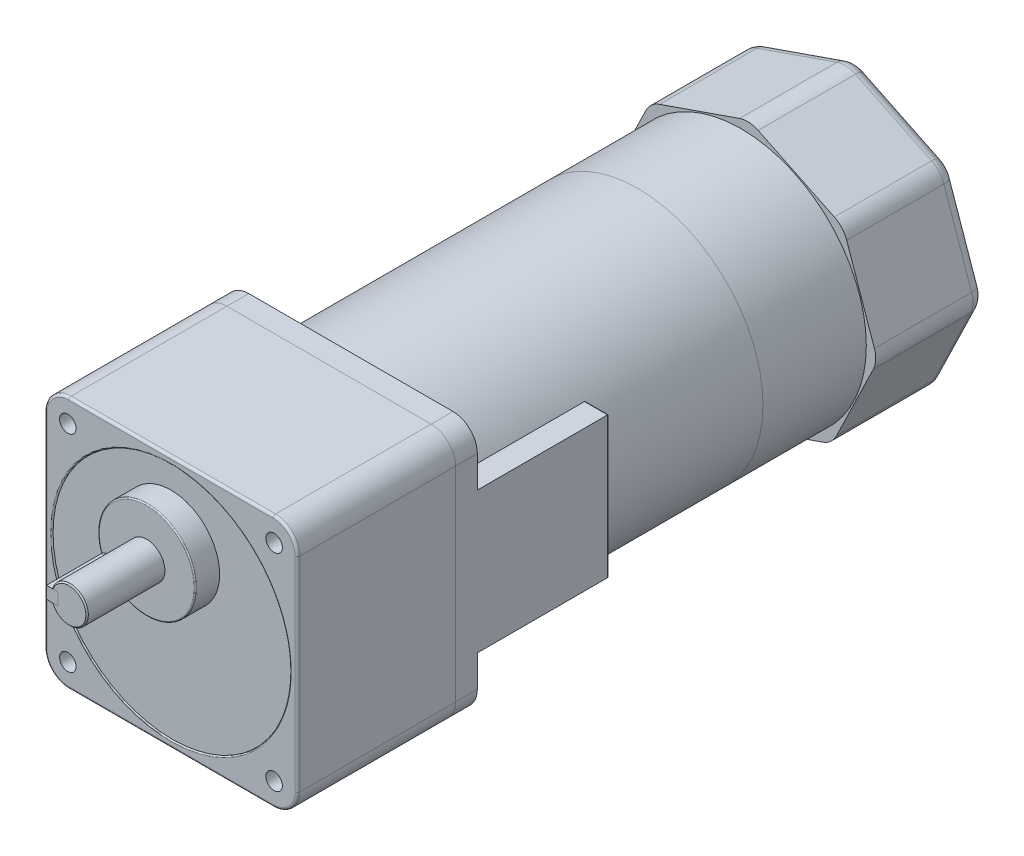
ISO-10303-21;
HEADER;
FILE_DESCRIPTION(('STEP AP214'),'2;1');
FILE_NAME('part.step','',(''),(''),'','','');
FILE_SCHEMA(('AUTOMOTIVE_DESIGN { 1 0 10303 214 1 1 1 1 }'));
ENDSEC;
DATA;
#1=APPLICATION_CONTEXT('core data for automotive mechanical design processes');
#2=APPLICATION_PROTOCOL_DEFINITION('international standard','automotive_design',2000,#1);
#3=PRODUCT_CONTEXT('',#1,'mechanical');
#4=PRODUCT('Part','Part','',(#3));
#5=PRODUCT_RELATED_PRODUCT_CATEGORY('part','',(#4));
#6=PRODUCT_DEFINITION_FORMATION('','',#4);
#7=PRODUCT_DEFINITION_CONTEXT('part definition',#1,'design');
#8=PRODUCT_DEFINITION('design','',#6,#7);
#9=PRODUCT_DEFINITION_SHAPE('','',#8);
#10=(LENGTH_UNIT() NAMED_UNIT(*) SI_UNIT(.MILLI.,.METRE.));
#11=(NAMED_UNIT(*) PLANE_ANGLE_UNIT() SI_UNIT($,.RADIAN.));
#12=(NAMED_UNIT(*) SI_UNIT($,.STERADIAN.) SOLID_ANGLE_UNIT());
#13=UNCERTAINTY_MEASURE_WITH_UNIT(LENGTH_MEASURE(1.E-05),#10,'distance_accuracy_value','');
#14=(GEOMETRIC_REPRESENTATION_CONTEXT(3) GLOBAL_UNCERTAINTY_ASSIGNED_CONTEXT((#13)) GLOBAL_UNIT_ASSIGNED_CONTEXT((#10,
#11,#12)) REPRESENTATION_CONTEXT('',''));
#15=CARTESIAN_POINT('',(0.,0.,0.));
#16=DIRECTION('',(0.,0.,1.));
#17=DIRECTION('',(1.,0.,0.));
#18=AXIS2_PLACEMENT_3D('',#15,#16,#17);
#19=CARTESIAN_POINT('',(-9.5,20.,84.5));
#20=DIRECTION('',(1.,0.,0.));
#21=DIRECTION('',(0.,0.,-1.));
#22=AXIS2_PLACEMENT_3D('',#19,#20,#21);
#23=CYLINDRICAL_SURFACE('',#22,2.5);
#24=DIRECTION('',(1.,0.,0.));
#25=VECTOR('',#24,1.);
#26=CARTESIAN_POINT('',(-9.5,17.5,84.5));
#27=LINE('',#26,#25);
#28=CARTESIAN_POINT('',(-9.20000000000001,17.5,84.5));
#29=VERTEX_POINT('',#28);
#30=CARTESIAN_POINT('',(-4.5,17.5,84.5));
#31=VERTEX_POINT('',#30);
#32=EDGE_CURVE('E102',#29,#31,#27,.T.);
#33=ORIENTED_EDGE('',*,*,#32,.F.);
#34=CARTESIAN_POINT('',(-9.20000000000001,20.,84.5));
#35=DIRECTION('',(-1.,0.,0.));
#36=DIRECTION('',(0.,0.,1.));
#37=AXIS2_PLACEMENT_3D('',#34,#35,#36);
#38=CIRCLE('',#37,2.5);
#39=CARTESIAN_POINT('',(-9.20000000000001,22.5,84.5));
#40=VERTEX_POINT('',#39);
#41=EDGE_CURVE('E12',#29,#40,#38,.F.);
#42=ORIENTED_EDGE('',*,*,#41,.T.);
#43=DIRECTION('',(1.,0.,0.));
#44=VECTOR('',#43,1.);
#45=CARTESIAN_POINT('',(-9.5,22.5,84.5));
#46=LINE('',#45,#44);
#47=CARTESIAN_POINT('',(-4.5,22.5,84.5));
#48=VERTEX_POINT('',#47);
#49=EDGE_CURVE('E122',#40,#48,#46,.T.);
#50=ORIENTED_EDGE('',*,*,#49,.T.);
#51=CARTESIAN_POINT('',(-4.5,20.,84.5));
#52=DIRECTION('',(-1.,0.,0.));
#53=DIRECTION('',(0.,0.,1.));
#54=AXIS2_PLACEMENT_3D('',#51,#52,#53);
#55=CIRCLE('',#54,2.5);
#56=EDGE_CURVE('E117',#48,#31,#55,.T.);
#57=ORIENTED_EDGE('',*,*,#56,.T.);
#58=EDGE_LOOP('',(#33,#42,#50,#57));
#59=FACE_BOUND('',#58,.T.);
#60=ADVANCED_FACE('F50',(#59),#23,.T.);
#61=CARTESIAN_POINT('',(-9.5,17.5,107.));
#62=DIRECTION('',(0.,1.,0.));
#63=DIRECTION('',(0.,0.,1.));
#64=AXIS2_PLACEMENT_3D('',#61,#62,#63);
#65=PLANE('',#64);
#66=DIRECTION('',(1.,0.,0.));
#67=VECTOR('',#66,1.);
#68=CARTESIAN_POINT('',(-9.5,17.5,107.));
#69=LINE('',#68,#67);
#70=CARTESIAN_POINT('',(-9.20000000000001,17.5,107.));
#71=VERTEX_POINT('',#70);
#72=CARTESIAN_POINT('',(-4.5,17.5,107.));
#73=VERTEX_POINT('',#72);
#74=EDGE_CURVE('E111',#71,#73,#69,.T.);
#75=ORIENTED_EDGE('',*,*,#74,.F.);
#76=DIRECTION('',(0.,0.,-1.));
#77=VECTOR('',#76,1.);
#78=CARTESIAN_POINT('',(-9.20000000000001,17.5,84.5));
#79=LINE('',#78,#77);
#80=EDGE_CURVE('E59',#71,#29,#79,.T.);
#81=ORIENTED_EDGE('',*,*,#80,.T.);
#82=ORIENTED_EDGE('',*,*,#32,.T.);
#83=DIRECTION('',(0.,0.,1.));
#84=VECTOR('',#83,1.);
#85=CARTESIAN_POINT('',(-4.5,17.5,107.));
#86=LINE('',#85,#84);
#87=EDGE_CURVE('E105',#31,#73,#86,.T.);
#88=ORIENTED_EDGE('',*,*,#87,.T.);
#89=EDGE_LOOP('',(#75,#81,#82,#88));
#90=FACE_BOUND('',#89,.T.);
#91=ADVANCED_FACE('F104',(#90),#65,.F.);
#92=CARTESIAN_POINT('',(-9.5,22.5,107.));
#93=DIRECTION('',(0.,0.,-1.));
#94=DIRECTION('',(-1.,0.,0.));
#95=AXIS2_PLACEMENT_3D('',#92,#93,#94);
#96=PLANE('',#95);
#97=DIRECTION('',(1.,0.,0.));
#98=VECTOR('',#97,1.);
#99=CARTESIAN_POINT('',(-9.5,22.5,107.));
#100=LINE('',#99,#98);
#101=CARTESIAN_POINT('',(-9.20000000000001,22.5,107.));
#102=VERTEX_POINT('',#101);
#103=CARTESIAN_POINT('',(-4.5,22.5,107.));
#104=VERTEX_POINT('',#103);
#105=EDGE_CURVE('E132',#102,#104,#100,.T.);
#106=ORIENTED_EDGE('',*,*,#105,.F.);
#107=DIRECTION('',(0.,-1.,0.));
#108=VECTOR('',#107,1.);
#109=CARTESIAN_POINT('',(-9.20000000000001,17.5,107.));
#110=LINE('',#109,#108);
#111=EDGE_CURVE('E74',#102,#71,#110,.T.);
#112=ORIENTED_EDGE('',*,*,#111,.T.);
#113=ORIENTED_EDGE('',*,*,#74,.T.);
#114=DIRECTION('',(0.,1.,0.));
#115=VECTOR('',#114,1.);
#116=CARTESIAN_POINT('',(-4.5,22.5,107.));
#117=LINE('',#116,#115);
#118=EDGE_CURVE('E119',#73,#104,#117,.T.);
#119=ORIENTED_EDGE('',*,*,#118,.T.);
#120=EDGE_LOOP('',(#106,#112,#113,#119));
#121=FACE_BOUND('',#120,.T.);
#122=ADVANCED_FACE('F170',(#121),#96,.F.);
#123=CARTESIAN_POINT('',(-9.5,22.5,84.5));
#124=DIRECTION('',(0.,-1.,0.));
#125=DIRECTION('',(0.,0.,-1.));
#126=AXIS2_PLACEMENT_3D('',#123,#124,#125);
#127=PLANE('',#126);
#128=ORIENTED_EDGE('',*,*,#49,.F.);
#129=DIRECTION('',(0.,0.,1.));
#130=VECTOR('',#129,1.);
#131=CARTESIAN_POINT('',(-9.20000000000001,22.5,107.));
#132=LINE('',#131,#130);
#133=EDGE_CURVE('E143',#40,#102,#132,.T.);
#134=ORIENTED_EDGE('',*,*,#133,.T.);
#135=ORIENTED_EDGE('',*,*,#105,.T.);
#136=DIRECTION('',(0.,0.,-1.));
#137=VECTOR('',#136,1.);
#138=CARTESIAN_POINT('',(-4.5,22.5,84.5));
#139=LINE('',#138,#137);
#140=EDGE_CURVE('E129',#104,#48,#139,.T.);
#141=ORIENTED_EDGE('',*,*,#140,.T.);
#142=EDGE_LOOP('',(#128,#134,#135,#141));
#143=FACE_BOUND('',#142,.T.);
#144=ADVANCED_FACE('F169',(#143),#127,.F.);
#145=CARTESIAN_POINT('',(-9.5,20.,84.5));
#146=DIRECTION('',(-1.,0.,0.));
#147=DIRECTION('',(0.,0.,1.));
#148=AXIS2_PLACEMENT_3D('',#145,#146,#147);
#149=PLANE('',#148);
#150=DIRECTION('',(0.,1.,0.));
#151=VECTOR('',#150,1.);
#152=CARTESIAN_POINT('',(-9.5,22.5,106.7));
#153=LINE('',#152,#151);
#154=CARTESIAN_POINT('',(-9.5,17.8,106.7));
#155=VERTEX_POINT('',#154);
#156=CARTESIAN_POINT('',(-9.5,22.2,106.7));
#157=VERTEX_POINT('',#156);
#158=EDGE_CURVE('E138',#155,#157,#153,.T.);
#159=ORIENTED_EDGE('',*,*,#158,.T.);
#160=DIRECTION('',(0.,0.,-1.));
#161=VECTOR('',#160,1.);
#162=CARTESIAN_POINT('',(-9.5,22.2,84.5));
#163=LINE('',#162,#161);
#164=CARTESIAN_POINT('',(-9.5,22.2,84.5));
#165=VERTEX_POINT('',#164);
#166=EDGE_CURVE('E140',#157,#165,#163,.T.);
#167=ORIENTED_EDGE('',*,*,#166,.T.);
#168=CARTESIAN_POINT('',(-9.5,20.,84.5));
#169=DIRECTION('',(-1.,0.,0.));
#170=DIRECTION('',(0.,0.,1.));
#171=AXIS2_PLACEMENT_3D('',#168,#169,#170);
#172=CIRCLE('',#171,2.2);
#173=CARTESIAN_POINT('',(-9.5,17.8,84.5));
#174=VERTEX_POINT('',#173);
#175=EDGE_CURVE('E110',#165,#174,#172,.T.);
#176=ORIENTED_EDGE('',*,*,#175,.T.);
#177=DIRECTION('',(0.,0.,1.));
#178=VECTOR('',#177,1.);
#179=CARTESIAN_POINT('',(-9.5,17.8,107.));
#180=LINE('',#179,#178);
#181=EDGE_CURVE('E136',#174,#155,#180,.T.);
#182=ORIENTED_EDGE('',*,*,#181,.T.);
#183=EDGE_LOOP('',(#159,#167,#176,#182));
#184=FACE_BOUND('',#183,.T.);
#185=ADVANCED_FACE('F162',(#184),#149,.T.);
#186=CARTESIAN_POINT('',(-4.5,20.,84.5));
#187=DIRECTION('',(-1.,0.,0.));
#188=DIRECTION('',(0.,0.,1.));
#189=AXIS2_PLACEMENT_3D('',#186,#187,#188);
#190=PLANE('',#189);
#191=ORIENTED_EDGE('',*,*,#56,.F.);
#192=ORIENTED_EDGE('',*,*,#140,.F.);
#193=ORIENTED_EDGE('',*,*,#118,.F.);
#194=ORIENTED_EDGE('',*,*,#87,.F.);
#195=EDGE_LOOP('',(#191,#192,#193,#194));
#196=FACE_BOUND('',#195,.T.);
#197=ADVANCED_FACE('F115',(#196),#190,.F.);
#198=CARTESIAN_POINT('',(-9.5,17.8,84.5));
#199=DIRECTION('',(-0.707106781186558,-0.707106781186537,0.));
#200=DIRECTION('',(0.,0.,-1.));
#201=AXIS2_PLACEMENT_3D('',#198,#199,#200);
#202=PLANE('',#201);
#203=DIRECTION('',(-0.707106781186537,0.707106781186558,0.));
#204=VECTOR('',#203,1.);
#205=CARTESIAN_POINT('',(-9.20000000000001,17.5,84.5));
#206=LINE('',#205,#204);
#207=EDGE_CURVE('E126',#29,#174,#206,.T.);
#208=ORIENTED_EDGE('',*,*,#207,.F.);
#209=ORIENTED_EDGE('',*,*,#80,.F.);
#210=DIRECTION('',(-0.577350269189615,0.577350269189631,-0.577350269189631));
#211=VECTOR('',#210,1.);
#212=CARTESIAN_POINT('',(-16.8999999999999,25.2000000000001,99.2999999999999));
#213=LINE('',#212,#211);
#214=EDGE_CURVE('E54',#155,#71,#213,.F.);
#215=ORIENTED_EDGE('',*,*,#214,.F.);
#216=ORIENTED_EDGE('',*,*,#181,.F.);
#217=EDGE_LOOP('',(#208,#209,#215,#216));
#218=FACE_BOUND('',#217,.T.);
#219=ADVANCED_FACE('F52',(#218),#202,.T.);
#220=CARTESIAN_POINT('',(-9.5,20.,106.7));
#221=DIRECTION('',(-0.707106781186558,0.,0.707106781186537));
#222=DIRECTION('',(0.,-1.,0.));
#223=AXIS2_PLACEMENT_3D('',#220,#221,#222);
#224=PLANE('',#223);
#225=ORIENTED_EDGE('',*,*,#214,.T.);
#226=ORIENTED_EDGE('',*,*,#111,.F.);
#227=DIRECTION('',(-0.577350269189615,-0.577350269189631,-0.577350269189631));
#228=VECTOR('',#227,1.);
#229=CARTESIAN_POINT('',(-10.2333333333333,21.4666666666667,105.966666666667));
#230=LINE('',#229,#228);
#231=EDGE_CURVE('E150',#157,#102,#230,.F.);
#232=ORIENTED_EDGE('',*,*,#231,.F.);
#233=ORIENTED_EDGE('',*,*,#158,.F.);
#234=EDGE_LOOP('',(#225,#226,#232,#233));
#235=FACE_BOUND('',#234,.T.);
#236=ADVANCED_FACE('F187',(#235),#224,.T.);
#237=CARTESIAN_POINT('',(-9.5,20.,84.5));
#238=DIRECTION('',(1.,0.,0.));
#239=DIRECTION('',(0.,0.,-1.));
#240=AXIS2_PLACEMENT_3D('',#237,#238,#239);
#241=CONICAL_SURFACE('',#240,2.2,0.785398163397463);
#242=ORIENTED_EDGE('',*,*,#207,.T.);
#243=ORIENTED_EDGE('',*,*,#175,.F.);
#244=DIRECTION('',(-0.707106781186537,-0.707106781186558,0.));
#245=VECTOR('',#244,1.);
#246=CARTESIAN_POINT('',(-9.20000000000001,22.5,84.5));
#247=LINE('',#246,#245);
#248=EDGE_CURVE('E148',#40,#165,#247,.T.);
#249=ORIENTED_EDGE('',*,*,#248,.F.);
#250=ORIENTED_EDGE('',*,*,#41,.F.);
#251=EDGE_LOOP('',(#242,#243,#249,#250));
#252=FACE_BOUND('',#251,.T.);
#253=ADVANCED_FACE('F155',(#252),#241,.T.);
#254=CARTESIAN_POINT('',(-9.5,22.2,84.5));
#255=DIRECTION('',(-0.707106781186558,0.707106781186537,0.));
#256=DIRECTION('',(0.,0.,1.));
#257=AXIS2_PLACEMENT_3D('',#254,#255,#256);
#258=PLANE('',#257);
#259=ORIENTED_EDGE('',*,*,#231,.T.);
#260=ORIENTED_EDGE('',*,*,#133,.F.);
#261=ORIENTED_EDGE('',*,*,#248,.T.);
#262=ORIENTED_EDGE('',*,*,#166,.F.);
#263=EDGE_LOOP('',(#259,#260,#261,#262));
#264=FACE_BOUND('',#263,.T.);
#265=ADVANCED_FACE('F166',(#264),#258,.T.);
#266=CLOSED_SHELL('',(#60,#91,#122,#144,#185,#197,#219,#236,#253,#265));
#267=MANIFOLD_SOLID_BREP('B2',#266);
#268=CARTESIAN_POINT('',(0.,20.,107.));
#269=DIRECTION('',(0.,0.,-1.));
#270=DIRECTION('',(-1.,0.,0.));
#271=AXIS2_PLACEMENT_3D('',#268,#269,#270);
#272=CYLINDRICAL_SURFACE('',#271,7.5);
#273=CARTESIAN_POINT('',(0.,20.,75.));
#274=DIRECTION('',(0.,0.,1.));
#275=DIRECTION('',(1.,0.,0.));
#276=AXIS2_PLACEMENT_3D('',#273,#274,#275);
#277=CIRCLE('',#276,7.5);
#278=CARTESIAN_POINT('',(7.5,20.,75.));
#279=VERTEX_POINT('',#278);
#280=EDGE_CURVE('E341',#279,#279,#277,.T.);
#281=ORIENTED_EDGE('',*,*,#280,.T.);
#282=EDGE_LOOP('',(#281));
#283=FACE_BOUND('',#282,.T.);
#284=CARTESIAN_POINT('',(-7.07106781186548,22.5,84.5));
#285=CARTESIAN_POINT('',(-7.07105693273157,22.500008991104,84.4317929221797));
#286=CARTESIAN_POINT('',(-7.07205443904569,22.4972088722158,84.3635919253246));
#287=CARTESIAN_POINT('',(-7.07598524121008,22.4860604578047,84.2277189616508));
#288=CARTESIAN_POINT('',(-7.07891801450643,22.477713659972,84.160046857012));
#289=CARTESIAN_POINT('',(-7.08662705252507,22.455574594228,84.0259095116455));
#290=CARTESIAN_POINT('',(-7.09139784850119,22.4417984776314,83.9594412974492));
#291=CARTESIAN_POINT('',(-7.10262619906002,22.4089418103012,83.8279917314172));
#292=CARTESIAN_POINT('',(-7.10908381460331,22.3898610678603,83.7630104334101));
#293=CARTESIAN_POINT('',(-7.13069940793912,22.324915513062,83.5710384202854));
#294=CARTESIAN_POINT('',(-7.14811243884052,22.2713141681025,83.44682084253));
#295=CARTESIAN_POINT('',(-7.1869703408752,22.1451778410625,83.2091231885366));
#296=CARTESIAN_POINT('',(-7.20841768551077,22.0726312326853,83.0956497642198));
#297=CARTESIAN_POINT('',(-7.25386182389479,21.9076299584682,82.8782070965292));
#298=CARTESIAN_POINT('',(-7.27792189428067,21.8145628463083,82.7747148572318));
#299=CARTESIAN_POINT('',(-7.32534626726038,21.6124707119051,82.5844828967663));
#300=CARTESIAN_POINT('',(-7.34871044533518,21.5034428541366,82.497746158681));
#301=CARTESIAN_POINT('',(-7.39284706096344,21.2690092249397,82.3413017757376));
#302=CARTESIAN_POINT('',(-7.41353593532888,21.1432502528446,82.2720976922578));
#303=CARTESIAN_POINT('',(-7.44924021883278,20.8810730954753,82.1560192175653));
#304=CARTESIAN_POINT('',(-7.46425736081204,20.7446581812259,82.1091380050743));
#305=CARTESIAN_POINT('',(-7.48647677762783,20.4700733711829,82.0406607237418));
#306=CARTESIAN_POINT('',(-7.49393272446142,20.3321295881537,82.0182418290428));
#307=CARTESIAN_POINT('',(-7.50109021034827,20.0542474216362,81.9967092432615));
#308=CARTESIAN_POINT('',(-7.50079359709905,19.9143095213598,81.9975899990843));
#309=CARTESIAN_POINT('',(-7.49265096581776,19.6422403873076,82.0221107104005));
#310=CARTESIAN_POINT('',(-7.48510152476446,19.5100182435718,82.0448565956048));
#311=CARTESIAN_POINT('',(-7.46367401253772,19.2513898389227,82.1109829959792));
#312=CARTESIAN_POINT('',(-7.44979559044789,19.1249839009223,82.1543646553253));
#313=CARTESIAN_POINT('',(-7.41689170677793,18.8796184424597,82.2610534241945));
#314=CARTESIAN_POINT('',(-7.39780094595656,18.760778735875,82.3246151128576));
#315=CARTESIAN_POINT('',(-7.35645969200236,18.5351885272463,82.469649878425));
#316=CARTESIAN_POINT('',(-7.33420833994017,18.4284413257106,82.5511278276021));
#317=CARTESIAN_POINT('',(-7.28765679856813,18.2247566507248,82.734177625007));
#318=CARTESIAN_POINT('',(-7.26330946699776,18.128515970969,82.8365138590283));
#319=CARTESIAN_POINT('',(-7.21618726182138,17.9543199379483,83.0561037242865));
#320=CARTESIAN_POINT('',(-7.19341289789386,17.8763704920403,83.1733621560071));
#321=CARTESIAN_POINT('',(-7.15175078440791,17.7399916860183,83.4217004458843));
#322=CARTESIAN_POINT('',(-7.13292537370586,17.6818674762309,83.5529587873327));
#323=CARTESIAN_POINT('',(-7.10202742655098,17.5888494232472,83.8241174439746));
#324=CARTESIAN_POINT('',(-7.08994423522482,17.5539189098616,83.9640037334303));
#325=CARTESIAN_POINT('',(-7.078413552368,17.5208546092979,84.17104659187));
#326=CARTESIAN_POINT('',(-7.07566669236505,17.5130373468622,84.2366034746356));
#327=CARTESIAN_POINT('',(-7.07199258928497,17.502613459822,84.3680951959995));
#328=CARTESIAN_POINT('',(-7.0710629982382,17.5000001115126,84.434029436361));
#329=CARTESIAN_POINT('',(-7.07106781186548,17.5,84.5));
#330=B_SPLINE_CURVE_WITH_KNOTS('',3,(#284,#285,#286,#287,#288,#289,#290,#291,#292,#293,#294,
#295,#296,#297,#298,#299,#300,#301,#302,#303,#304,#305,#306,#307,#308,#309,#310,#311,#312,#313,
#314,#315,#316,#317,#318,#319,#320,#321,#322,#323,#324,#325,#326,#327,#328,#329),.UNSPECIFIED.,
.F.,.F.,(4,2,2,2,2,2,2,2,2,2,2,2,2,2,2,2,2,2,2,2,2,2,4),(0.,0.204546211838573,0.409037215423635,
0.612924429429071,0.816819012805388,1.22401016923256,1.63145179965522,2.05327864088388,
2.47518051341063,2.90809434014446,3.34087579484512,3.75860278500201,4.176230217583,
4.57747647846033,4.97874498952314,5.38529148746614,5.79194868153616,6.2177173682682,
6.643623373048,7.07581676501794,7.50732520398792,7.70536340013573,7.90314555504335),.UNSPECIFIED.);
#331=CARTESIAN_POINT('',(-7.07106781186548,22.5,84.5));
#332=VERTEX_POINT('',#331);
#333=CARTESIAN_POINT('',(-7.07106781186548,17.5,84.5));
#334=VERTEX_POINT('',#333);
#335=EDGE_CURVE('E48',#332,#334,#330,.T.);
#336=ORIENTED_EDGE('',*,*,#335,.F.);
#337=DIRECTION('',(0.,0.,-1.));
#338=VECTOR('',#337,1.);
#339=CARTESIAN_POINT('',(-7.07106781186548,22.5,107.));
#340=LINE('',#339,#338);
#341=CARTESIAN_POINT('',(-7.07106781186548,22.5,106.5));
#342=VERTEX_POINT('',#341);
#343=EDGE_CURVE('E332',#342,#332,#340,.T.);
#344=ORIENTED_EDGE('',*,*,#343,.F.);
#345=CARTESIAN_POINT('',(0.,20.,106.5));
#346=DIRECTION('',(0.,0.,1.));
#347=DIRECTION('',(1.,0.,0.));
#348=AXIS2_PLACEMENT_3D('',#345,#346,#347);
#349=CIRCLE('',#348,7.5);
#350=CARTESIAN_POINT('',(-7.07106781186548,17.5,106.5));
#351=VERTEX_POINT('',#350);
#352=EDGE_CURVE('E347',#342,#351,#349,.F.);
#353=ORIENTED_EDGE('',*,*,#352,.T.);
#354=DIRECTION('',(0.,0.,-1.));
#355=VECTOR('',#354,1.);
#356=CARTESIAN_POINT('',(-7.07106781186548,17.5,107.));
#357=LINE('',#356,#355);
#358=EDGE_CURVE('E282',#334,#351,#357,.F.);
#359=ORIENTED_EDGE('',*,*,#358,.F.);
#360=EDGE_LOOP('',(#336,#344,#353,#359));
#361=FACE_BOUND('',#360,.T.);
#362=ADVANCED_FACE('F262',(#283,#361),#272,.T.);
#363=CARTESIAN_POINT('',(0.,20.,107.));
#364=DIRECTION('',(0.,0.,1.));
#365=DIRECTION('',(1.,0.,0.));
#366=AXIS2_PLACEMENT_3D('',#363,#364,#365);
#367=PLANE('',#366);
#368=CARTESIAN_POINT('',(0.,20.,107.));
#369=DIRECTION('',(0.,0.,1.));
#370=DIRECTION('',(1.,0.,0.));
#371=AXIS2_PLACEMENT_3D('',#368,#369,#370);
#372=CIRCLE('',#371,7.);
#373=CARTESIAN_POINT('',(-6.53834841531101,17.5,107.));
#374=VERTEX_POINT('',#373);
#375=CARTESIAN_POINT('',(-6.53834841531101,22.5,107.));
#376=VERTEX_POINT('',#375);
#377=EDGE_CURVE('E344',#374,#376,#372,.T.);
#378=ORIENTED_EDGE('',*,*,#377,.T.);
#379=DIRECTION('',(-1.,0.,0.));
#380=VECTOR('',#379,1.);
#381=CARTESIAN_POINT('',(-4.5,22.5,107.));
#382=LINE('',#381,#380);
#383=CARTESIAN_POINT('',(-4.5,22.5,107.));
#384=VERTEX_POINT('',#383);
#385=EDGE_CURVE('E333',#384,#376,#382,.T.);
#386=ORIENTED_EDGE('',*,*,#385,.F.);
#387=DIRECTION('',(0.,-1.,0.));
#388=VECTOR('',#387,1.);
#389=CARTESIAN_POINT('',(-4.5,22.5,107.));
#390=LINE('',#389,#388);
#391=CARTESIAN_POINT('',(-4.5,17.5,107.));
#392=VERTEX_POINT('',#391);
#393=EDGE_CURVE('E320',#384,#392,#390,.T.);
#394=ORIENTED_EDGE('',*,*,#393,.T.);
#395=DIRECTION('',(-1.,0.,0.));
#396=VECTOR('',#395,1.);
#397=CARTESIAN_POINT('',(-4.5,17.5,107.));
#398=LINE('',#397,#396);
#399=EDGE_CURVE('E336',#392,#374,#398,.T.);
#400=ORIENTED_EDGE('',*,*,#399,.T.);
#401=EDGE_LOOP('',(#378,#386,#394,#400));
#402=FACE_BOUND('',#401,.T.);
#403=ADVANCED_FACE('F369',(#402),#367,.T.);
#404=CARTESIAN_POINT('',(0.,20.,107.));
#405=DIRECTION('',(0.,0.,-1.));
#406=DIRECTION('',(-1.,0.,0.));
#407=AXIS2_PLACEMENT_3D('',#404,#405,#406);
#408=CONICAL_SURFACE('',#407,7.,0.785398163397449);
#409=ORIENTED_EDGE('',*,*,#352,.F.);
#410=CARTESIAN_POINT('',(-11.0143547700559,22.5,102.705487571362));
#411=CARTESIAN_POINT('',(-10.6798349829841,22.5,103.031669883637));
#412=CARTESIAN_POINT('',(-10.3449877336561,22.5,103.357518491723));
#413=CARTESIAN_POINT('',(-9.67434994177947,22.5,104.008192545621));
#414=CARTESIAN_POINT('',(-9.3385594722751,22.5,104.333018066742));
#415=CARTESIAN_POINT('',(-8.6658920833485,22.5,104.981151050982));
#416=CARTESIAN_POINT('',(-8.32901590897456,22.5,105.304459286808));
#417=CARTESIAN_POINT('',(-7.65344263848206,22.5,105.949228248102));
#418=CARTESIAN_POINT('',(-7.31474539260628,22.5,106.270688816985));
#419=CARTESIAN_POINT('',(-6.80457575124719,22.5,106.750931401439));
#420=CARTESIAN_POINT('',(-6.6340879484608,22.5,106.910759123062));
#421=CARTESIAN_POINT('',(-6.29229590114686,22.5,107.229536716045));
#422=CARTESIAN_POINT('',(-6.12099166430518,22.5,107.38848659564));
#423=CARTESIAN_POINT('',(-5.77739778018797,22.5,107.705248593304));
#424=CARTESIAN_POINT('',(-5.60510833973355,22.5,107.863060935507));
#425=CARTESIAN_POINT('',(-5.25922656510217,22.5,108.177266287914));
#426=CARTESIAN_POINT('',(-5.08563418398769,22.5,108.333659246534));
#427=CARTESIAN_POINT('',(-4.73662813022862,22.5,108.644687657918));
#428=CARTESIAN_POINT('',(-4.56121310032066,22.5,108.799321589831));
#429=CARTESIAN_POINT('',(-4.20817217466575,22.5,109.106020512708));
#430=CARTESIAN_POINT('',(-4.03054650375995,22.5,109.258085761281));
#431=CARTESIAN_POINT('',(-3.76176911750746,22.5,109.483525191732));
#432=CARTESIAN_POINT('',(-3.67175442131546,22.5,109.558254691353));
#433=CARTESIAN_POINT('',(-3.49082532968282,22.5,109.706612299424));
#434=CARTESIAN_POINT('',(-3.399910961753,22.5,109.78024044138));
#435=CARTESIAN_POINT('',(-3.21698494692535,22.5,109.926189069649));
#436=CARTESIAN_POINT('',(-3.12497293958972,22.5,109.998509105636));
#437=CARTESIAN_POINT('',(-2.93965183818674,22.5,110.14148620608));
#438=CARTESIAN_POINT('',(-2.84634260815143,22.5,110.212143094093));
#439=CARTESIAN_POINT('',(-2.75227945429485,22.5,110.281795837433));
#440=B_SPLINE_CURVE_WITH_KNOTS('',3,(#410,#411,#412,#413,#414,#415,#416,#417,#418,#419,#420,
#421,#422,#423,#424,#425,#426,#427,#428,#429,#430,#431,#432,#433,#434,#435,#436,#437,#438,#439),
.UNSPECIFIED.,.F.,.F.,(4,2,2,2,2,2,2,2,2,2,2,2,2,2,4),(0.,1.4016744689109,2.80324322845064,
4.20399722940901,5.60486824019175,6.30593577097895,7.00699671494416,7.70791552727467,
8.40885971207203,9.11036980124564,9.81180911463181,10.1627784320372,10.5137370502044,
10.864814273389,11.2159285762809),.UNSPECIFIED.);
#441=EDGE_CURVE('E275',#342,#376,#440,.T.);
#442=ORIENTED_EDGE('',*,*,#441,.T.);
#443=ORIENTED_EDGE('',*,*,#377,.F.);
#444=CARTESIAN_POINT('',(-2.75227945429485,17.5,110.281795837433));
#445=CARTESIAN_POINT('',(-2.82551522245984,17.5,110.227577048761));
#446=CARTESIAN_POINT('',(-2.89828844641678,17.5,110.172740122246));
#447=CARTESIAN_POINT('',(-3.043018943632,17.5,110.062008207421));
#448=CARTESIAN_POINT('',(-3.11497626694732,17.5,110.006113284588));
#449=CARTESIAN_POINT('',(-3.32976761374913,17.5,109.837125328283));
#450=CARTESIAN_POINT('',(-3.47155558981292,17.5,109.722703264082));
#451=CARTESIAN_POINT('',(-3.75292181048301,17.5,109.491337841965));
#452=CARTESIAN_POINT('',(-3.8925011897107,17.5,109.3743958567));
#453=CARTESIAN_POINT('',(-4.17001061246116,17.5,109.138555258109));
#454=CARTESIAN_POINT('',(-4.30794054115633,17.5,109.019656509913));
#455=CARTESIAN_POINT('',(-4.5823789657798,17.5,108.78045226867));
#456=CARTESIAN_POINT('',(-4.71888850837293,17.5,108.660147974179));
#457=CARTESIAN_POINT('',(-4.99085017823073,17.5,108.418358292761));
#458=CARTESIAN_POINT('',(-5.1263023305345,17.5,108.296872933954));
#459=CARTESIAN_POINT('',(-5.5314179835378,17.5,107.930975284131));
#460=CARTESIAN_POINT('',(-5.79980668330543,17.5,107.685151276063));
#461=CARTESIAN_POINT('',(-6.14300557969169,17.5,107.367828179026));
#462=CARTESIAN_POINT('',(-6.21888659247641,17.5,107.297480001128));
#463=CARTESIAN_POINT('',(-6.37047314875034,17.5,107.156598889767));
#464=CARTESIAN_POINT('',(-6.44617869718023,17.5,107.086065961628));
#465=CARTESIAN_POINT('',(-6.67307720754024,17.5,106.874199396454));
#466=CARTESIAN_POINT('',(-6.8240348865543,17.5,106.732613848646));
#467=CARTESIAN_POINT('',(-7.31490063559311,17.5,106.27054247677));
#468=CARTESIAN_POINT('',(-7.65375215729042,17.5,105.948934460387));
#469=CARTESIAN_POINT('',(-8.32966336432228,17.5,105.30383974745));
#470=CARTESIAN_POINT('',(-8.66672303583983,17.5,104.98035303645));
#471=CARTESIAN_POINT('',(-9.3394195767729,17.5,104.332186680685));
#472=CARTESIAN_POINT('',(-9.67505698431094,17.5,104.00750759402));
#473=CARTESIAN_POINT('',(-10.3453568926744,17.5,103.357159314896));
#474=CARTESIAN_POINT('',(-10.6800194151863,17.5,103.031490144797));
#475=CARTESIAN_POINT('',(-11.0143547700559,17.5,102.705487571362));
#476=B_SPLINE_CURVE_WITH_KNOTS('',3,(#444,#445,#446,#447,#448,#449,#450,#451,#452,#453,#454,
#455,#456,#457,#458,#459,#460,#461,#462,#463,#464,#465,#466,#467,#468,#469,#470,#471,#472,#473,
#474,#475),.UNSPECIFIED.,.F.,.F.,(4,2,2,2,2,2,2,2,2,2,2,2,2,2,2,4),(0.,0.273355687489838,
0.546694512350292,1.09324270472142,1.63950035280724,2.18579581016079,2.73165523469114,
3.27750169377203,4.36933033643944,4.67975144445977,4.99016370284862,5.61105831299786,
7.01256945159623,8.41409138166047,9.81502466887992,11.215926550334),.UNSPECIFIED.);
#477=EDGE_CURVE('E350',#374,#351,#476,.T.);
#478=ORIENTED_EDGE('',*,*,#477,.T.);
#479=EDGE_LOOP('',(#409,#442,#443,#478));
#480=FACE_BOUND('',#479,.T.);
#481=ADVANCED_FACE('F264',(#480),#408,.T.);
#482=CARTESIAN_POINT('',(0.,20.,75.));
#483=DIRECTION('',(0.,0.,1.));
#484=DIRECTION('',(1.,0.,0.));
#485=AXIS2_PLACEMENT_3D('',#482,#483,#484);
#486=PLANE('',#485);
#487=ORIENTED_EDGE('',*,*,#280,.F.);
#488=EDGE_LOOP('',(#487));
#489=FACE_BOUND('',#488,.T.);
#490=ADVANCED_FACE('F368',(#489),#486,.F.);
#491=CARTESIAN_POINT('',(-4.5,20.,84.5));
#492=DIRECTION('',(-1.,0.,0.));
#493=DIRECTION('',(0.,0.,1.));
#494=AXIS2_PLACEMENT_3D('',#491,#492,#493);
#495=CYLINDRICAL_SURFACE('',#494,2.5);
#496=DIRECTION('',(-1.,0.,0.));
#497=VECTOR('',#496,1.);
#498=CARTESIAN_POINT('',(-4.5,22.5,84.5));
#499=LINE('',#498,#497);
#500=CARTESIAN_POINT('',(-4.5,22.5,84.5));
#501=VERTEX_POINT('',#500);
#502=EDGE_CURVE('E328',#501,#332,#499,.T.);
#503=ORIENTED_EDGE('',*,*,#502,.T.);
#504=ORIENTED_EDGE('',*,*,#335,.T.);
#505=DIRECTION('',(-1.,0.,0.));
#506=VECTOR('',#505,1.);
#507=CARTESIAN_POINT('',(-4.5,17.5,84.5));
#508=LINE('',#507,#506);
#509=CARTESIAN_POINT('',(-4.5,17.5,84.5));
#510=VERTEX_POINT('',#509);
#511=EDGE_CURVE('E329',#510,#334,#508,.T.);
#512=ORIENTED_EDGE('',*,*,#511,.F.);
#513=CARTESIAN_POINT('',(-4.5,20.,84.5));
#514=DIRECTION('',(1.,0.,0.));
#515=DIRECTION('',(0.,0.,-1.));
#516=AXIS2_PLACEMENT_3D('',#513,#514,#515);
#517=CIRCLE('',#516,2.5);
#518=EDGE_CURVE('E318',#510,#501,#517,.T.);
#519=ORIENTED_EDGE('',*,*,#518,.T.);
#520=EDGE_LOOP('',(#503,#504,#512,#519));
#521=FACE_BOUND('',#520,.T.);
#522=ADVANCED_FACE('F327',(#521),#495,.F.);
#523=CARTESIAN_POINT('',(-4.5,22.5,84.5));
#524=DIRECTION('',(0.,-1.,0.));
#525=DIRECTION('',(0.,0.,-1.));
#526=AXIS2_PLACEMENT_3D('',#523,#524,#525);
#527=PLANE('',#526);
#528=ORIENTED_EDGE('',*,*,#343,.T.);
#529=ORIENTED_EDGE('',*,*,#502,.F.);
#530=DIRECTION('',(0.,0.,1.));
#531=VECTOR('',#530,1.);
#532=CARTESIAN_POINT('',(-4.5,22.5,84.5));
#533=LINE('',#532,#531);
#534=EDGE_CURVE('E314',#501,#384,#533,.T.);
#535=ORIENTED_EDGE('',*,*,#534,.T.);
#536=ORIENTED_EDGE('',*,*,#385,.T.);
#537=ORIENTED_EDGE('',*,*,#441,.F.);
#538=EDGE_LOOP('',(#528,#529,#535,#536,#537));
#539=FACE_BOUND('',#538,.T.);
#540=ADVANCED_FACE('F331',(#539),#527,.T.);
#541=CARTESIAN_POINT('',(-4.5,17.5,107.));
#542=DIRECTION('',(0.,1.,0.));
#543=DIRECTION('',(0.,0.,1.));
#544=AXIS2_PLACEMENT_3D('',#541,#542,#543);
#545=PLANE('',#544);
#546=ORIENTED_EDGE('',*,*,#358,.T.);
#547=ORIENTED_EDGE('',*,*,#477,.F.);
#548=ORIENTED_EDGE('',*,*,#399,.F.);
#549=DIRECTION('',(0.,0.,-1.));
#550=VECTOR('',#549,1.);
#551=CARTESIAN_POINT('',(-4.5,17.5,107.));
#552=LINE('',#551,#550);
#553=EDGE_CURVE('E383',#392,#510,#552,.T.);
#554=ORIENTED_EDGE('',*,*,#553,.T.);
#555=ORIENTED_EDGE('',*,*,#511,.T.);
#556=EDGE_LOOP('',(#546,#547,#548,#554,#555));
#557=FACE_BOUND('',#556,.T.);
#558=ADVANCED_FACE('F359',(#557),#545,.T.);
#559=CARTESIAN_POINT('',(-4.5,20.,84.5));
#560=DIRECTION('',(1.,0.,0.));
#561=DIRECTION('',(0.,0.,-1.));
#562=AXIS2_PLACEMENT_3D('',#559,#560,#561);
#563=PLANE('',#562);
#564=ORIENTED_EDGE('',*,*,#518,.F.);
#565=ORIENTED_EDGE('',*,*,#553,.F.);
#566=ORIENTED_EDGE('',*,*,#393,.F.);
#567=ORIENTED_EDGE('',*,*,#534,.F.);
#568=EDGE_LOOP('',(#564,#565,#566,#567));
#569=FACE_BOUND('',#568,.T.);
#570=ADVANCED_FACE('F316',(#569),#563,.F.);
#571=CLOSED_SHELL('',(#362,#403,#481,#490,#522,#540,#558,#570));
#572=MANIFOLD_SOLID_BREP('B6',#571);
#573=CARTESIAN_POINT('',(0.,20.,75.));
#574=DIRECTION('',(0.,0.,-1.));
#575=DIRECTION('',(-1.,0.,0.));
#576=AXIS2_PLACEMENT_3D('',#573,#574,#575);
#577=CYLINDRICAL_SURFACE('',#576,20.);
#578=CARTESIAN_POINT('',(0.,20.,74.5));
#579=DIRECTION('',(0.,0.,1.));
#580=DIRECTION('',(1.,0.,0.));
#581=AXIS2_PLACEMENT_3D('',#578,#579,#580);
#582=CIRCLE('',#581,20.);
#583=CARTESIAN_POINT('',(20.,20.,74.5));
#584=VERTEX_POINT('',#583);
#585=EDGE_CURVE('E261',#584,#584,#582,.F.);
#586=ORIENTED_EDGE('',*,*,#585,.T.);
#587=EDGE_LOOP('',(#586));
#588=FACE_BOUND('',#587,.T.);
#589=CARTESIAN_POINT('',(0.,20.,65.));
#590=DIRECTION('',(0.,0.,1.));
#591=DIRECTION('',(1.,0.,0.));
#592=AXIS2_PLACEMENT_3D('',#589,#590,#591);
#593=CIRCLE('',#592,20.);
#594=CARTESIAN_POINT('',(20.,20.,65.));
#595=VERTEX_POINT('',#594);
#596=EDGE_CURVE('E463',#595,#595,#593,.T.);
#597=ORIENTED_EDGE('',*,*,#596,.T.);
#598=EDGE_LOOP('',(#597));
#599=FACE_BOUND('',#598,.T.);
#600=ADVANCED_FACE('F452',(#588,#599),#577,.T.);
#601=CARTESIAN_POINT('',(0.,20.,75.));
#602=DIRECTION('',(0.,0.,1.));
#603=DIRECTION('',(1.,0.,0.));
#604=AXIS2_PLACEMENT_3D('',#601,#602,#603);
#605=PLANE('',#604);
#606=CARTESIAN_POINT('',(0.,20.,75.));
#607=DIRECTION('',(0.,0.,1.));
#608=DIRECTION('',(1.,0.,0.));
#609=AXIS2_PLACEMENT_3D('',#606,#607,#608);
#610=CIRCLE('',#609,19.5);
#611=CARTESIAN_POINT('',(19.5,20.,75.));
#612=VERTEX_POINT('',#611);
#613=EDGE_CURVE('E459',#612,#612,#610,.T.);
#614=ORIENTED_EDGE('',*,*,#613,.T.);
#615=EDGE_LOOP('',(#614));
#616=FACE_BOUND('',#615,.T.);
#617=ADVANCED_FACE('F473',(#616),#605,.T.);
#618=CARTESIAN_POINT('',(0.,20.,65.));
#619=DIRECTION('',(0.,0.,1.));
#620=DIRECTION('',(1.,0.,0.));
#621=AXIS2_PLACEMENT_3D('',#618,#619,#620);
#622=PLANE('',#621);
#623=ORIENTED_EDGE('',*,*,#596,.F.);
#624=EDGE_LOOP('',(#623));
#625=FACE_BOUND('',#624,.T.);
#626=ADVANCED_FACE('F471',(#625),#622,.F.);
#627=CARTESIAN_POINT('',(0.,20.,74.5));
#628=DIRECTION('',(0.,0.,1.));
#629=DIRECTION('',(1.,0.,0.));
#630=AXIS2_PLACEMENT_3D('',#627,#628,#629);
#631=TOROIDAL_SURFACE('',#630,19.5,0.5);
#632=ORIENTED_EDGE('',*,*,#585,.F.);
#633=EDGE_LOOP('',(#632));
#634=FACE_BOUND('',#633,.T.);
#635=ORIENTED_EDGE('',*,*,#613,.F.);
#636=EDGE_LOOP('',(#635));
#637=FACE_BOUND('',#636,.T.);
#638=ADVANCED_FACE('F454',(#634,#637),#631,.T.);
#639=CLOSED_SHELL('',(#600,#617,#626,#638));
#640=MANIFOLD_SOLID_BREP('B42',#639);
#641=CARTESIAN_POINT('',(45.3825112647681,-2.66124468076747,-214.5));
#642=DIRECTION('',(0.,0.,1.));
#643=DIRECTION('',(1.,0.,0.));
#644=AXIS2_PLACEMENT_3D('',#641,#642,#643);
#645=CYLINDRICAL_SURFACE('',#644,10.);
#646=DIRECTION('',(0.,0.,1.));
#647=VECTOR('',#646,1.);
#648=CARTESIAN_POINT('',(54.3814408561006,-7.02235305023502,-214.5));
#649=LINE('',#648,#647);
#650=CARTESIAN_POINT('',(54.3814408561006,-7.02235305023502,-209.5));
#651=VERTEX_POINT('',#650);
#652=CARTESIAN_POINT('',(54.3814408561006,-7.02235305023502,-169.5));
#653=VERTEX_POINT('',#652);
#654=EDGE_CURVE('E676',#651,#653,#649,.T.);
#655=ORIENTED_EDGE('',*,*,#654,.F.);
#656=CARTESIAN_POINT('',(45.3825112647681,-2.66124468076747,-209.5));
#657=DIRECTION('',(0.,0.,-1.));
#658=DIRECTION('',(-1.,0.,0.));
#659=AXIS2_PLACEMENT_3D('',#656,#657,#658);
#660=CIRCLE('',#659,10.);
#661=CARTESIAN_POINT('',(54.8294847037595,0.618190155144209,-209.5));
#662=VERTEX_POINT('',#661);
#663=EDGE_CURVE('E450',#651,#662,#660,.F.);
#664=ORIENTED_EDGE('',*,*,#663,.T.);
#665=DIRECTION('',(0.,0.,1.));
#666=VECTOR('',#665,1.);
#667=CARTESIAN_POINT('',(54.8294847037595,0.618190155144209,-214.5));
#668=LINE('',#667,#666);
#669=CARTESIAN_POINT('',(54.8294847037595,0.618190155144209,-169.5));
#670=VERTEX_POINT('',#669);
#671=EDGE_CURVE('E697',#662,#670,#668,.T.);
#672=ORIENTED_EDGE('',*,*,#671,.T.);
#673=CARTESIAN_POINT('',(45.3825112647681,-2.66124468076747,-169.5));
#674=DIRECTION('',(0.,0.,-1.));
#675=DIRECTION('',(-1.,0.,0.));
#676=AXIS2_PLACEMENT_3D('',#673,#674,#675);
#677=CIRCLE('',#676,10.);
#678=EDGE_CURVE('E691',#670,#653,#677,.T.);
#679=ORIENTED_EDGE('',*,*,#678,.T.);
#680=EDGE_LOOP('',(#655,#664,#672,#679));
#681=FACE_BOUND('',#680,.T.);
#682=ADVANCED_FACE('F516',(#681),#645,.T.);
#683=CARTESIAN_POINT('',(54.3814408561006,-7.02235305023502,-214.5));
#684=DIRECTION('',(-0.899892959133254,0.436110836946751,0.));
#685=DIRECTION('',(-0.436110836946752,-0.899892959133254,0.));
#686=AXIS2_PLACEMENT_3D('',#683,#684,#685);
#687=PLANE('',#686);
#688=DIRECTION('',(0.,0.,1.));
#689=VECTOR('',#688,1.);
#690=CARTESIAN_POINT('',(39.2074268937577,-38.3331739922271,-214.5));
#691=LINE('',#690,#689);
#692=CARTESIAN_POINT('',(39.2074268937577,-38.3331739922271,-209.5));
#693=VERTEX_POINT('',#692);
#694=CARTESIAN_POINT('',(39.2074268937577,-38.3331739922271,-169.5));
#695=VERTEX_POINT('',#694);
#696=EDGE_CURVE('E685',#693,#695,#691,.T.);
#697=ORIENTED_EDGE('',*,*,#696,.F.);
#698=DIRECTION('',(-0.436110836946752,-0.899892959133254,0.));
#699=VECTOR('',#698,1.);
#700=CARTESIAN_POINT('',(54.3814408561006,-7.02235305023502,-209.5));
#701=LINE('',#700,#699);
#702=EDGE_CURVE('E525',#693,#651,#701,.F.);
#703=ORIENTED_EDGE('',*,*,#702,.T.);
#704=ORIENTED_EDGE('',*,*,#654,.T.);
#705=DIRECTION('',(-0.436110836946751,-0.899892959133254,0.));
#706=VECTOR('',#705,1.);
#707=CARTESIAN_POINT('',(54.3814408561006,-7.02235305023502,-169.5));
#708=LINE('',#707,#706);
#709=EDGE_CURVE('E679',#653,#695,#708,.T.);
#710=ORIENTED_EDGE('',*,*,#709,.T.);
#711=EDGE_LOOP('',(#697,#703,#704,#710));
#712=FACE_BOUND('',#711,.T.);
#713=ADVANCED_FACE('F678',(#712),#687,.F.);
#714=CARTESIAN_POINT('',(30.2084973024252,-33.9720656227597,-214.5));
#715=DIRECTION('',(0.,0.,1.));
#716=DIRECTION('',(1.,0.,0.));
#717=AXIS2_PLACEMENT_3D('',#714,#715,#716);
#718=CYLINDRICAL_SURFACE('',#717,10.);
#719=DIRECTION('',(0.,0.,1.));
#720=VECTOR('',#719,1.);
#721=CARTESIAN_POINT('',(33.4879321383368,-43.4190390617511,-214.5));
#722=LINE('',#721,#720);
#723=CARTESIAN_POINT('',(33.4879321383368,-43.4190390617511,-209.5));
#724=VERTEX_POINT('',#723);
#725=CARTESIAN_POINT('',(33.4879321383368,-43.4190390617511,-169.5));
#726=VERTEX_POINT('',#725);
#727=EDGE_CURVE('E767',#724,#726,#722,.T.);
#728=ORIENTED_EDGE('',*,*,#727,.F.);
#729=CARTESIAN_POINT('',(30.2084973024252,-33.9720656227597,-209.5));
#730=DIRECTION('',(0.,0.,-1.));
#731=DIRECTION('',(-1.,0.,0.));
#732=AXIS2_PLACEMENT_3D('',#729,#730,#731);
#733=CIRCLE('',#732,10.);
#734=EDGE_CURVE('E540',#724,#693,#733,.F.);
#735=ORIENTED_EDGE('',*,*,#734,.T.);
#736=ORIENTED_EDGE('',*,*,#696,.T.);
#737=CARTESIAN_POINT('',(30.2084973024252,-33.9720656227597,-169.5));
#738=DIRECTION('',(0.,0.,-1.));
#739=DIRECTION('',(-1.,0.,0.));
#740=AXIS2_PLACEMENT_3D('',#737,#738,#739);
#741=CIRCLE('',#740,10.);
#742=EDGE_CURVE('E694',#695,#726,#741,.T.);
#743=ORIENTED_EDGE('',*,*,#742,.T.);
#744=EDGE_LOOP('',(#728,#735,#736,#743));
#745=FACE_BOUND('',#744,.T.);
#746=ADVANCED_FACE('F1005',(#745),#718,.T.);
#747=CARTESIAN_POINT('',(33.4879321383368,-43.4190390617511,-214.5));
#748=DIRECTION('',(-0.327943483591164,0.944697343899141,0.));
#749=DIRECTION('',(-0.944697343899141,-0.327943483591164,0.));
#750=AXIS2_PLACEMENT_3D('',#747,#748,#749);
#751=PLANE('',#750);
#752=DIRECTION('',(0.,0.,1.));
#753=VECTOR('',#752,1.);
#754=CARTESIAN_POINT('',(0.618190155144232,-54.8294847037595,-214.5));
#755=LINE('',#754,#753);
#756=CARTESIAN_POINT('',(0.618190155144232,-54.8294847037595,-209.5));
#757=VERTEX_POINT('',#756);
#758=CARTESIAN_POINT('',(0.618190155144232,-54.8294847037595,-169.5));
#759=VERTEX_POINT('',#758);
#760=EDGE_CURVE('E765',#757,#759,#755,.T.);
#761=ORIENTED_EDGE('',*,*,#760,.F.);
#762=DIRECTION('',(-0.944697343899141,-0.327943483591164,0.));
#763=VECTOR('',#762,1.);
#764=CARTESIAN_POINT('',(33.4879321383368,-43.4190390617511,-209.5));
#765=LINE('',#764,#763);
#766=EDGE_CURVE('E827',#757,#724,#765,.F.);
#767=ORIENTED_EDGE('',*,*,#766,.T.);
#768=ORIENTED_EDGE('',*,*,#727,.T.);
#769=DIRECTION('',(-0.944697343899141,-0.327943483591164,0.));
#770=VECTOR('',#769,1.);
#771=CARTESIAN_POINT('',(33.4879321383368,-43.4190390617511,-169.5));
#772=LINE('',#771,#770);
#773=EDGE_CURVE('E704',#726,#759,#772,.T.);
#774=ORIENTED_EDGE('',*,*,#773,.T.);
#775=EDGE_LOOP('',(#761,#767,#768,#774));
#776=FACE_BOUND('',#775,.T.);
#777=ADVANCED_FACE('F901',(#776),#751,.F.);
#778=CARTESIAN_POINT('',(-2.66124468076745,-45.3825112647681,-214.5));
#779=DIRECTION('',(0.,0.,1.));
#780=DIRECTION('',(1.,0.,0.));
#781=AXIS2_PLACEMENT_3D('',#778,#779,#780);
#782=CYLINDRICAL_SURFACE('',#781,10.);
#783=DIRECTION('',(0.,0.,1.));
#784=VECTOR('',#783,1.);
#785=CARTESIAN_POINT('',(-7.022353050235,-54.3814408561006,-214.5));
#786=LINE('',#785,#784);
#787=CARTESIAN_POINT('',(-7.022353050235,-54.3814408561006,-209.5));
#788=VERTEX_POINT('',#787);
#789=CARTESIAN_POINT('',(-7.022353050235,-54.3814408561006,-169.5));
#790=VERTEX_POINT('',#789);
#791=EDGE_CURVE('E763',#788,#790,#786,.T.);
#792=ORIENTED_EDGE('',*,*,#791,.F.);
#793=CARTESIAN_POINT('',(-2.66124468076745,-45.3825112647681,-209.5));
#794=DIRECTION('',(0.,0.,-1.));
#795=DIRECTION('',(-1.,0.,0.));
#796=AXIS2_PLACEMENT_3D('',#793,#794,#795);
#797=CIRCLE('',#796,10.);
#798=EDGE_CURVE('E825',#788,#757,#797,.F.);
#799=ORIENTED_EDGE('',*,*,#798,.T.);
#800=ORIENTED_EDGE('',*,*,#760,.T.);
#801=CARTESIAN_POINT('',(-2.66124468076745,-45.3825112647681,-169.5));
#802=DIRECTION('',(0.,0.,-1.));
#803=DIRECTION('',(-1.,0.,0.));
#804=AXIS2_PLACEMENT_3D('',#801,#802,#803);
#805=CIRCLE('',#804,10.);
#806=EDGE_CURVE('E707',#759,#790,#805,.T.);
#807=ORIENTED_EDGE('',*,*,#806,.T.);
#808=EDGE_LOOP('',(#792,#799,#800,#807));
#809=FACE_BOUND('',#808,.T.);
#810=ADVANCED_FACE('F899',(#809),#782,.T.);
#811=CARTESIAN_POINT('',(-7.022353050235,-54.3814408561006,-214.5));
#812=DIRECTION('',(0.436110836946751,0.899892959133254,0.));
#813=DIRECTION('',(-0.899892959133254,0.436110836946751,0.));
#814=AXIS2_PLACEMENT_3D('',#811,#812,#813);
#815=PLANE('',#814);
#816=DIRECTION('',(0.,0.,1.));
#817=VECTOR('',#816,1.);
#818=CARTESIAN_POINT('',(-38.3331739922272,-39.2074268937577,-214.5));
#819=LINE('',#818,#817);
#820=CARTESIAN_POINT('',(-38.3331739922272,-39.2074268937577,-209.5));
#821=VERTEX_POINT('',#820);
#822=CARTESIAN_POINT('',(-38.3331739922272,-39.2074268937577,-169.5));
#823=VERTEX_POINT('',#822);
#824=EDGE_CURVE('E761',#821,#823,#819,.T.);
#825=ORIENTED_EDGE('',*,*,#824,.F.);
#826=DIRECTION('',(-0.899892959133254,0.436110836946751,0.));
#827=VECTOR('',#826,1.);
#828=CARTESIAN_POINT('',(-7.022353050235,-54.3814408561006,-209.5));
#829=LINE('',#828,#827);
#830=EDGE_CURVE('E823',#821,#788,#829,.F.);
#831=ORIENTED_EDGE('',*,*,#830,.T.);
#832=ORIENTED_EDGE('',*,*,#791,.T.);
#833=DIRECTION('',(-0.899892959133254,0.436110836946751,0.));
#834=VECTOR('',#833,1.);
#835=CARTESIAN_POINT('',(-7.022353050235,-54.3814408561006,-169.5));
#836=LINE('',#835,#834);
#837=EDGE_CURVE('E710',#790,#823,#836,.T.);
#838=ORIENTED_EDGE('',*,*,#837,.T.);
#839=EDGE_LOOP('',(#825,#831,#832,#838));
#840=FACE_BOUND('',#839,.T.);
#841=ADVANCED_FACE('F908',(#840),#815,.F.);
#842=CARTESIAN_POINT('',(-33.9720656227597,-30.2084973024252,-214.5));
#843=DIRECTION('',(0.,0.,1.));
#844=DIRECTION('',(1.,0.,0.));
#845=AXIS2_PLACEMENT_3D('',#842,#843,#844);
#846=CYLINDRICAL_SURFACE('',#845,10.);
#847=DIRECTION('',(0.,0.,1.));
#848=VECTOR('',#847,1.);
#849=CARTESIAN_POINT('',(-43.4190390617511,-33.4879321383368,-214.5));
#850=LINE('',#849,#848);
#851=CARTESIAN_POINT('',(-43.4190390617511,-33.4879321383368,-209.5));
#852=VERTEX_POINT('',#851);
#853=CARTESIAN_POINT('',(-43.4190390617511,-33.4879321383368,-169.5));
#854=VERTEX_POINT('',#853);
#855=EDGE_CURVE('E759',#852,#854,#850,.T.);
#856=ORIENTED_EDGE('',*,*,#855,.F.);
#857=CARTESIAN_POINT('',(-33.9720656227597,-30.2084973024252,-209.5));
#858=DIRECTION('',(0.,0.,-1.));
#859=DIRECTION('',(-1.,0.,0.));
#860=AXIS2_PLACEMENT_3D('',#857,#858,#859);
#861=CIRCLE('',#860,10.);
#862=EDGE_CURVE('E821',#852,#821,#861,.F.);
#863=ORIENTED_EDGE('',*,*,#862,.T.);
#864=ORIENTED_EDGE('',*,*,#824,.T.);
#865=CARTESIAN_POINT('',(-33.9720656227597,-30.2084973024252,-169.5));
#866=DIRECTION('',(0.,0.,-1.));
#867=DIRECTION('',(-1.,0.,0.));
#868=AXIS2_PLACEMENT_3D('',#865,#866,#867);
#869=CIRCLE('',#868,10.);
#870=EDGE_CURVE('E713',#823,#854,#869,.T.);
#871=ORIENTED_EDGE('',*,*,#870,.T.);
#872=EDGE_LOOP('',(#856,#863,#864,#871));
#873=FACE_BOUND('',#872,.T.);
#874=ADVANCED_FACE('F911',(#873),#846,.T.);
#875=CARTESIAN_POINT('',(-43.4190390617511,-33.4879321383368,-214.5));
#876=DIRECTION('',(0.944697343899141,0.327943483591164,0.));
#877=DIRECTION('',(-0.327943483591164,0.944697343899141,0.));
#878=AXIS2_PLACEMENT_3D('',#875,#876,#877);
#879=PLANE('',#878);
#880=DIRECTION('',(0.,0.,1.));
#881=VECTOR('',#880,1.);
#882=CARTESIAN_POINT('',(-54.8294847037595,-0.618190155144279,-214.5));
#883=LINE('',#882,#881);
#884=CARTESIAN_POINT('',(-54.8294847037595,-0.618190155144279,-209.5));
#885=VERTEX_POINT('',#884);
#886=CARTESIAN_POINT('',(-54.8294847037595,-0.618190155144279,-169.5));
#887=VERTEX_POINT('',#886);
#888=EDGE_CURVE('E757',#885,#887,#883,.T.);
#889=ORIENTED_EDGE('',*,*,#888,.F.);
#890=DIRECTION('',(-0.327943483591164,0.944697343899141,0.));
#891=VECTOR('',#890,1.);
#892=CARTESIAN_POINT('',(-43.4190390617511,-33.4879321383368,-209.5));
#893=LINE('',#892,#891);
#894=EDGE_CURVE('E819',#885,#852,#893,.F.);
#895=ORIENTED_EDGE('',*,*,#894,.T.);
#896=ORIENTED_EDGE('',*,*,#855,.T.);
#897=DIRECTION('',(-0.327943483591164,0.944697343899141,0.));
#898=VECTOR('',#897,1.);
#899=CARTESIAN_POINT('',(-43.4190390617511,-33.4879321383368,-169.5));
#900=LINE('',#899,#898);
#901=EDGE_CURVE('E716',#854,#887,#900,.T.);
#902=ORIENTED_EDGE('',*,*,#901,.T.);
#903=EDGE_LOOP('',(#889,#895,#896,#902));
#904=FACE_BOUND('',#903,.T.);
#905=ADVANCED_FACE('F914',(#904),#879,.F.);
#906=CARTESIAN_POINT('',(-45.3825112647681,2.6612446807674,-214.5));
#907=DIRECTION('',(0.,0.,1.));
#908=DIRECTION('',(1.,0.,0.));
#909=AXIS2_PLACEMENT_3D('',#906,#907,#908);
#910=CYLINDRICAL_SURFACE('',#909,10.);
#911=DIRECTION('',(0.,0.,1.));
#912=VECTOR('',#911,1.);
#913=CARTESIAN_POINT('',(-54.3814408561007,7.02235305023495,-214.5));
#914=LINE('',#913,#912);
#915=CARTESIAN_POINT('',(-54.3814408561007,7.02235305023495,-209.5));
#916=VERTEX_POINT('',#915);
#917=CARTESIAN_POINT('',(-54.3814408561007,7.02235305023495,-169.5));
#918=VERTEX_POINT('',#917);
#919=EDGE_CURVE('E755',#916,#918,#914,.T.);
#920=ORIENTED_EDGE('',*,*,#919,.F.);
#921=CARTESIAN_POINT('',(-45.3825112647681,2.6612446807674,-209.5));
#922=DIRECTION('',(0.,0.,-1.));
#923=DIRECTION('',(-1.,0.,0.));
#924=AXIS2_PLACEMENT_3D('',#921,#922,#923);
#925=CIRCLE('',#924,10.);
#926=EDGE_CURVE('E817',#916,#885,#925,.F.);
#927=ORIENTED_EDGE('',*,*,#926,.T.);
#928=ORIENTED_EDGE('',*,*,#888,.T.);
#929=CARTESIAN_POINT('',(-45.3825112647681,2.6612446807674,-169.5));
#930=DIRECTION('',(0.,0.,-1.));
#931=DIRECTION('',(-1.,0.,0.));
#932=AXIS2_PLACEMENT_3D('',#929,#930,#931);
#933=CIRCLE('',#932,10.);
#934=EDGE_CURVE('E719',#887,#918,#933,.T.);
#935=ORIENTED_EDGE('',*,*,#934,.T.);
#936=EDGE_LOOP('',(#920,#927,#928,#935));
#937=FACE_BOUND('',#936,.T.);
#938=ADVANCED_FACE('F918',(#937),#910,.T.);
#939=CARTESIAN_POINT('',(-54.3814408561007,7.02235305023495,-214.5));
#940=DIRECTION('',(0.899892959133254,-0.436110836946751,0.));
#941=DIRECTION('',(0.436110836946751,0.899892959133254,0.));
#942=AXIS2_PLACEMENT_3D('',#939,#940,#941);
#943=PLANE('',#942);
#944=DIRECTION('',(0.,0.,1.));
#945=VECTOR('',#944,1.);
#946=CARTESIAN_POINT('',(-39.2074268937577,38.3331739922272,-214.5));
#947=LINE('',#946,#945);
#948=CARTESIAN_POINT('',(-39.2074268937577,38.3331739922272,-209.5));
#949=VERTEX_POINT('',#948);
#950=CARTESIAN_POINT('',(-39.2074268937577,38.3331739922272,-169.5));
#951=VERTEX_POINT('',#950);
#952=EDGE_CURVE('E753',#949,#951,#947,.T.);
#953=ORIENTED_EDGE('',*,*,#952,.F.);
#954=DIRECTION('',(0.436110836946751,0.899892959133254,0.));
#955=VECTOR('',#954,1.);
#956=CARTESIAN_POINT('',(-54.3814408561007,7.02235305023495,-209.5));
#957=LINE('',#956,#955);
#958=EDGE_CURVE('E815',#949,#916,#957,.F.);
#959=ORIENTED_EDGE('',*,*,#958,.T.);
#960=ORIENTED_EDGE('',*,*,#919,.T.);
#961=DIRECTION('',(0.436110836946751,0.899892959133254,0.));
#962=VECTOR('',#961,1.);
#963=CARTESIAN_POINT('',(-54.3814408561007,7.02235305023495,-169.5));
#964=LINE('',#963,#962);
#965=EDGE_CURVE('E722',#918,#951,#964,.T.);
#966=ORIENTED_EDGE('',*,*,#965,.T.);
#967=EDGE_LOOP('',(#953,#959,#960,#966));
#968=FACE_BOUND('',#967,.T.);
#969=ADVANCED_FACE('F991',(#968),#943,.F.);
#970=CARTESIAN_POINT('',(-30.2084973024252,33.9720656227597,-214.5));
#971=DIRECTION('',(0.,0.,1.));
#972=DIRECTION('',(1.,0.,0.));
#973=AXIS2_PLACEMENT_3D('',#970,#971,#972);
#974=CYLINDRICAL_SURFACE('',#973,9.99999999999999);
#975=DIRECTION('',(0.,0.,1.));
#976=VECTOR('',#975,1.);
#977=CARTESIAN_POINT('',(-33.4879321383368,43.4190390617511,-214.5));
#978=LINE('',#977,#976);
#979=CARTESIAN_POINT('',(-33.4879321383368,43.4190390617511,-209.5));
#980=VERTEX_POINT('',#979);
#981=CARTESIAN_POINT('',(-33.4879321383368,43.4190390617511,-169.5));
#982=VERTEX_POINT('',#981);
#983=EDGE_CURVE('E751',#980,#982,#978,.T.);
#984=ORIENTED_EDGE('',*,*,#983,.F.);
#985=CARTESIAN_POINT('',(-30.2084973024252,33.9720656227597,-209.5));
#986=DIRECTION('',(0.,0.,-1.));
#987=DIRECTION('',(-1.,0.,0.));
#988=AXIS2_PLACEMENT_3D('',#985,#986,#987);
#989=CIRCLE('',#988,9.99999999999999);
#990=EDGE_CURVE('E813',#980,#949,#989,.F.);
#991=ORIENTED_EDGE('',*,*,#990,.T.);
#992=ORIENTED_EDGE('',*,*,#952,.T.);
#993=CARTESIAN_POINT('',(-30.2084973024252,33.9720656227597,-169.5));
#994=DIRECTION('',(0.,0.,-1.));
#995=DIRECTION('',(-1.,0.,0.));
#996=AXIS2_PLACEMENT_3D('',#993,#994,#995);
#997=CIRCLE('',#996,9.99999999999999);
#998=EDGE_CURVE('E725',#951,#982,#997,.T.);
#999=ORIENTED_EDGE('',*,*,#998,.T.);
#1000=EDGE_LOOP('',(#984,#991,#992,#999));
#1001=FACE_BOUND('',#1000,.T.);
#1002=ADVANCED_FACE('F988',(#1001),#974,.T.);
#1003=CARTESIAN_POINT('',(-33.4879321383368,43.4190390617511,-214.5));
#1004=DIRECTION('',(0.327943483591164,-0.944697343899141,0.));
#1005=DIRECTION('',(0.944697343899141,0.327943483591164,0.));
#1006=AXIS2_PLACEMENT_3D('',#1003,#1004,#1005);
#1007=PLANE('',#1006);
#1008=DIRECTION('',(0.,0.,1.));
#1009=VECTOR('',#1008,1.);
#1010=CARTESIAN_POINT('',(-0.618190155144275,54.8294847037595,-214.5));
#1011=LINE('',#1010,#1009);
#1012=CARTESIAN_POINT('',(-0.618190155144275,54.8294847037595,-209.5));
#1013=VERTEX_POINT('',#1012);
#1014=CARTESIAN_POINT('',(-0.618190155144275,54.8294847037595,-169.5));
#1015=VERTEX_POINT('',#1014);
#1016=EDGE_CURVE('E749',#1013,#1015,#1011,.T.);
#1017=ORIENTED_EDGE('',*,*,#1016,.F.);
#1018=DIRECTION('',(0.944697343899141,0.327943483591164,0.));
#1019=VECTOR('',#1018,1.);
#1020=CARTESIAN_POINT('',(-33.4879321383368,43.4190390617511,-209.5));
#1021=LINE('',#1020,#1019);
#1022=EDGE_CURVE('E811',#1013,#980,#1021,.F.);
#1023=ORIENTED_EDGE('',*,*,#1022,.T.);
#1024=ORIENTED_EDGE('',*,*,#983,.T.);
#1025=DIRECTION('',(0.944697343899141,0.327943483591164,0.));
#1026=VECTOR('',#1025,1.);
#1027=CARTESIAN_POINT('',(-33.4879321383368,43.4190390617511,-169.5));
#1028=LINE('',#1027,#1026);
#1029=EDGE_CURVE('E728',#982,#1015,#1028,.T.);
#1030=ORIENTED_EDGE('',*,*,#1029,.T.);
#1031=EDGE_LOOP('',(#1017,#1023,#1024,#1030));
#1032=FACE_BOUND('',#1031,.T.);
#1033=ADVANCED_FACE('F985',(#1032),#1007,.F.);
#1034=CARTESIAN_POINT('',(2.66124468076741,45.3825112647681,-214.5));
#1035=DIRECTION('',(0.,0.,1.));
#1036=DIRECTION('',(1.,0.,0.));
#1037=AXIS2_PLACEMENT_3D('',#1034,#1035,#1036);
#1038=CYLINDRICAL_SURFACE('',#1037,9.99999999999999);
#1039=DIRECTION('',(0.,0.,1.));
#1040=VECTOR('',#1039,1.);
#1041=CARTESIAN_POINT('',(7.02235305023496,54.3814408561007,-214.5));
#1042=LINE('',#1041,#1040);
#1043=CARTESIAN_POINT('',(7.02235305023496,54.3814408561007,-209.5));
#1044=VERTEX_POINT('',#1043);
#1045=CARTESIAN_POINT('',(7.02235305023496,54.3814408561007,-169.5));
#1046=VERTEX_POINT('',#1045);
#1047=EDGE_CURVE('E747',#1044,#1046,#1042,.T.);
#1048=ORIENTED_EDGE('',*,*,#1047,.F.);
#1049=CARTESIAN_POINT('',(2.66124468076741,45.3825112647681,-209.5));
#1050=DIRECTION('',(0.,0.,-1.));
#1051=DIRECTION('',(-1.,0.,0.));
#1052=AXIS2_PLACEMENT_3D('',#1049,#1050,#1051);
#1053=CIRCLE('',#1052,9.99999999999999);
#1054=EDGE_CURVE('E809',#1044,#1013,#1053,.F.);
#1055=ORIENTED_EDGE('',*,*,#1054,.T.);
#1056=ORIENTED_EDGE('',*,*,#1016,.T.);
#1057=CARTESIAN_POINT('',(2.66124468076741,45.3825112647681,-169.5));
#1058=DIRECTION('',(0.,0.,-1.));
#1059=DIRECTION('',(1.,0.,0.));
#1060=AXIS2_PLACEMENT_3D('',#1057,#1058,#1059);
#1061=CIRCLE('',#1060,9.99999999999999);
#1062=EDGE_CURVE('E731',#1015,#1046,#1061,.T.);
#1063=ORIENTED_EDGE('',*,*,#1062,.T.);
#1064=EDGE_LOOP('',(#1048,#1055,#1056,#1063));
#1065=FACE_BOUND('',#1064,.T.);
#1066=ADVANCED_FACE('F980',(#1065),#1038,.T.);
#1067=CARTESIAN_POINT('',(7.02235305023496,54.3814408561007,-214.5));
#1068=DIRECTION('',(-0.436110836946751,-0.899892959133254,0.));
#1069=DIRECTION('',(0.899892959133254,-0.436110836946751,0.));
#1070=AXIS2_PLACEMENT_3D('',#1067,#1068,#1069);
#1071=PLANE('',#1070);
#1072=DIRECTION('',(0.,0.,1.));
#1073=VECTOR('',#1072,1.);
#1074=CARTESIAN_POINT('',(38.3331739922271,39.2074268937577,-214.5));
#1075=LINE('',#1074,#1073);
#1076=CARTESIAN_POINT('',(38.3331739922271,39.2074268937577,-209.5));
#1077=VERTEX_POINT('',#1076);
#1078=CARTESIAN_POINT('',(38.3331739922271,39.2074268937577,-169.5));
#1079=VERTEX_POINT('',#1078);
#1080=EDGE_CURVE('E745',#1077,#1079,#1075,.T.);
#1081=ORIENTED_EDGE('',*,*,#1080,.F.);
#1082=DIRECTION('',(0.899892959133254,-0.436110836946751,0.));
#1083=VECTOR('',#1082,1.);
#1084=CARTESIAN_POINT('',(7.02235305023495,54.3814408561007,-209.5));
#1085=LINE('',#1084,#1083);
#1086=EDGE_CURVE('E807',#1077,#1044,#1085,.F.);
#1087=ORIENTED_EDGE('',*,*,#1086,.T.);
#1088=ORIENTED_EDGE('',*,*,#1047,.T.);
#1089=DIRECTION('',(0.899892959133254,-0.436110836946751,0.));
#1090=VECTOR('',#1089,1.);
#1091=CARTESIAN_POINT('',(7.02235305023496,54.3814408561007,-169.5));
#1092=LINE('',#1091,#1090);
#1093=EDGE_CURVE('E734',#1046,#1079,#1092,.T.);
#1094=ORIENTED_EDGE('',*,*,#1093,.T.);
#1095=EDGE_LOOP('',(#1081,#1087,#1088,#1094));
#1096=FACE_BOUND('',#1095,.T.);
#1097=ADVANCED_FACE('F977',(#1096),#1071,.F.);
#1098=CARTESIAN_POINT('',(33.9720656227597,30.2084973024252,-214.5));
#1099=DIRECTION('',(0.,0.,1.));
#1100=DIRECTION('',(1.,0.,0.));
#1101=AXIS2_PLACEMENT_3D('',#1098,#1099,#1100);
#1102=CYLINDRICAL_SURFACE('',#1101,10.);
#1103=DIRECTION('',(0.,0.,1.));
#1104=VECTOR('',#1103,1.);
#1105=CARTESIAN_POINT('',(43.4190390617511,33.4879321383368,-214.5));
#1106=LINE('',#1105,#1104);
#1107=CARTESIAN_POINT('',(43.4190390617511,33.4879321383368,-209.5));
#1108=VERTEX_POINT('',#1107);
#1109=CARTESIAN_POINT('',(43.4190390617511,33.4879321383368,-169.5));
#1110=VERTEX_POINT('',#1109);
#1111=EDGE_CURVE('E743',#1108,#1110,#1106,.T.);
#1112=ORIENTED_EDGE('',*,*,#1111,.F.);
#1113=CARTESIAN_POINT('',(33.9720656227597,30.2084973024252,-209.5));
#1114=DIRECTION('',(0.,0.,-1.));
#1115=DIRECTION('',(-1.,0.,0.));
#1116=AXIS2_PLACEMENT_3D('',#1113,#1114,#1115);
#1117=CIRCLE('',#1116,10.);
#1118=EDGE_CURVE('E805',#1108,#1077,#1117,.F.);
#1119=ORIENTED_EDGE('',*,*,#1118,.T.);
#1120=ORIENTED_EDGE('',*,*,#1080,.T.);
#1121=CARTESIAN_POINT('',(33.9720656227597,30.2084973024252,-169.5));
#1122=DIRECTION('',(0.,0.,-1.));
#1123=DIRECTION('',(-1.,0.,0.));
#1124=AXIS2_PLACEMENT_3D('',#1121,#1122,#1123);
#1125=CIRCLE('',#1124,10.);
#1126=EDGE_CURVE('E737',#1079,#1110,#1125,.T.);
#1127=ORIENTED_EDGE('',*,*,#1126,.T.);
#1128=EDGE_LOOP('',(#1112,#1119,#1120,#1127));
#1129=FACE_BOUND('',#1128,.T.);
#1130=ADVANCED_FACE('F974',(#1129),#1102,.T.);
#1131=CARTESIAN_POINT('',(43.4190390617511,33.4879321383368,-214.5));
#1132=DIRECTION('',(-0.944697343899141,-0.327943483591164,0.));
#1133=DIRECTION('',(0.327943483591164,-0.944697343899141,0.));
#1134=AXIS2_PLACEMENT_3D('',#1131,#1132,#1133);
#1135=PLANE('',#1134);
#1136=ORIENTED_EDGE('',*,*,#671,.F.);
#1137=DIRECTION('',(0.327943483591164,-0.944697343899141,0.));
#1138=VECTOR('',#1137,1.);
#1139=CARTESIAN_POINT('',(43.4190390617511,33.4879321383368,-209.5));
#1140=LINE('',#1139,#1138);
#1141=EDGE_CURVE('E802',#662,#1108,#1140,.F.);
#1142=ORIENTED_EDGE('',*,*,#1141,.T.);
#1143=ORIENTED_EDGE('',*,*,#1111,.T.);
#1144=DIRECTION('',(0.327943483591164,-0.944697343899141,0.));
#1145=VECTOR('',#1144,1.);
#1146=CARTESIAN_POINT('',(43.4190390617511,33.4879321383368,-169.5));
#1147=LINE('',#1146,#1145);
#1148=EDGE_CURVE('E740',#1110,#670,#1147,.T.);
#1149=ORIENTED_EDGE('',*,*,#1148,.T.);
#1150=EDGE_LOOP('',(#1136,#1142,#1143,#1149));
#1151=FACE_BOUND('',#1150,.T.);
#1152=ADVANCED_FACE('F968',(#1151),#1135,.F.);
#1153=CARTESIAN_POINT('',(45.3825112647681,-2.66124468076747,-214.5));
#1154=DIRECTION('',(0.,0.,-1.));
#1155=DIRECTION('',(-1.,0.,0.));
#1156=AXIS2_PLACEMENT_3D('',#1153,#1154,#1155);
#1157=PLANE('',#1156);
#1158=CARTESIAN_POINT('',(33.9720656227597,30.2084973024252,-214.5));
#1159=DIRECTION('',(0.,0.,-1.));
#1160=DIRECTION('',(-1.,0.,0.));
#1161=AXIS2_PLACEMENT_3D('',#1158,#1159,#1160);
#1162=CIRCLE('',#1161,5.);
#1163=CARTESIAN_POINT('',(36.1526198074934,34.7079620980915,-214.5));
#1164=VERTEX_POINT('',#1163);
#1165=CARTESIAN_POINT('',(38.6955523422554,31.8482147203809,-214.5));
#1166=VERTEX_POINT('',#1165);
#1167=EDGE_CURVE('E797',#1164,#1166,#1162,.T.);
#1168=ORIENTED_EDGE('',*,*,#1167,.T.);
#1169=DIRECTION('',(0.327943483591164,-0.944697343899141,0.));
#1170=VECTOR('',#1169,1.);
#1171=CARTESIAN_POINT('',(50.1059979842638,-1.02152726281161,-214.5));
#1172=LINE('',#1171,#1170);
#1173=CARTESIAN_POINT('',(50.1059979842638,-1.02152726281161,-214.5));
#1174=VERTEX_POINT('',#1173);
#1175=EDGE_CURVE('E799',#1166,#1174,#1172,.T.);
#1176=ORIENTED_EDGE('',*,*,#1175,.T.);
#1177=CARTESIAN_POINT('',(45.3825112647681,-2.66124468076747,-214.5));
#1178=DIRECTION('',(0.,0.,-1.));
#1179=DIRECTION('',(-1.,0.,0.));
#1180=AXIS2_PLACEMENT_3D('',#1177,#1178,#1179);
#1181=CIRCLE('',#1180,5.);
#1182=CARTESIAN_POINT('',(49.8819760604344,-4.84179886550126,-214.5));
#1183=VERTEX_POINT('',#1182);
#1184=EDGE_CURVE('E684',#1174,#1183,#1181,.T.);
#1185=ORIENTED_EDGE('',*,*,#1184,.T.);
#1186=DIRECTION('',(-0.436110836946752,-0.899892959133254,0.));
#1187=VECTOR('',#1186,1.);
#1188=CARTESIAN_POINT('',(34.7079620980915,-36.1526198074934,-214.5));
#1189=LINE('',#1188,#1187);
#1190=CARTESIAN_POINT('',(34.7079620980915,-36.1526198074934,-214.5));
#1191=VERTEX_POINT('',#1190);
#1192=EDGE_CURVE('E771',#1183,#1191,#1189,.T.);
#1193=ORIENTED_EDGE('',*,*,#1192,.T.);
#1194=CARTESIAN_POINT('',(30.2084973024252,-33.9720656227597,-214.5));
#1195=DIRECTION('',(0.,0.,-1.));
#1196=DIRECTION('',(-1.,0.,0.));
#1197=AXIS2_PLACEMENT_3D('',#1194,#1195,#1196);
#1198=CIRCLE('',#1197,5.);
#1199=CARTESIAN_POINT('',(31.848214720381,-38.6955523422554,-214.5));
#1200=VERTEX_POINT('',#1199);
#1201=EDGE_CURVE('E773',#1191,#1200,#1198,.T.);
#1202=ORIENTED_EDGE('',*,*,#1201,.T.);
#1203=DIRECTION('',(-0.944697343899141,-0.327943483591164,0.));
#1204=VECTOR('',#1203,1.);
#1205=CARTESIAN_POINT('',(-1.02152726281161,-50.1059979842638,-214.5));
#1206=LINE('',#1205,#1204);
#1207=CARTESIAN_POINT('',(-1.02152726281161,-50.1059979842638,-214.5));
#1208=VERTEX_POINT('',#1207);
#1209=EDGE_CURVE('E775',#1200,#1208,#1206,.T.);
#1210=ORIENTED_EDGE('',*,*,#1209,.T.);
#1211=CARTESIAN_POINT('',(-2.66124468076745,-45.3825112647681,-214.5));
#1212=DIRECTION('',(0.,0.,-1.));
#1213=DIRECTION('',(-1.,0.,0.));
#1214=AXIS2_PLACEMENT_3D('',#1211,#1212,#1213);
#1215=CIRCLE('',#1214,5.);
#1216=CARTESIAN_POINT('',(-4.84179886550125,-49.8819760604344,-214.5));
#1217=VERTEX_POINT('',#1216);
#1218=EDGE_CURVE('E777',#1208,#1217,#1215,.T.);
#1219=ORIENTED_EDGE('',*,*,#1218,.T.);
#1220=DIRECTION('',(-0.899892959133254,0.436110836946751,0.));
#1221=VECTOR('',#1220,1.);
#1222=CARTESIAN_POINT('',(-36.1526198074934,-34.7079620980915,-214.5));
#1223=LINE('',#1222,#1221);
#1224=CARTESIAN_POINT('',(-36.1526198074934,-34.7079620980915,-214.5));
#1225=VERTEX_POINT('',#1224);
#1226=EDGE_CURVE('E779',#1217,#1225,#1223,.T.);
#1227=ORIENTED_EDGE('',*,*,#1226,.T.);
#1228=CARTESIAN_POINT('',(-33.9720656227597,-30.2084973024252,-214.5));
#1229=DIRECTION('',(0.,0.,-1.));
#1230=DIRECTION('',(-1.,0.,0.));
#1231=AXIS2_PLACEMENT_3D('',#1228,#1229,#1230);
#1232=CIRCLE('',#1231,5.);
#1233=CARTESIAN_POINT('',(-38.6955523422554,-31.848214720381,-214.5));
#1234=VERTEX_POINT('',#1233);
#1235=EDGE_CURVE('E781',#1225,#1234,#1232,.T.);
#1236=ORIENTED_EDGE('',*,*,#1235,.T.);
#1237=DIRECTION('',(-0.327943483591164,0.944697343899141,0.));
#1238=VECTOR('',#1237,1.);
#1239=CARTESIAN_POINT('',(-50.1059979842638,1.02152726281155,-214.5));
#1240=LINE('',#1239,#1238);
#1241=CARTESIAN_POINT('',(-50.1059979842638,1.02152726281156,-214.5));
#1242=VERTEX_POINT('',#1241);
#1243=EDGE_CURVE('E783',#1234,#1242,#1240,.T.);
#1244=ORIENTED_EDGE('',*,*,#1243,.T.);
#1245=CARTESIAN_POINT('',(-45.3825112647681,2.6612446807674,-214.5));
#1246=DIRECTION('',(0.,0.,-1.));
#1247=DIRECTION('',(-1.,0.,0.));
#1248=AXIS2_PLACEMENT_3D('',#1245,#1246,#1247);
#1249=CIRCLE('',#1248,5.);
#1250=CARTESIAN_POINT('',(-49.8819760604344,4.84179886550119,-214.5));
#1251=VERTEX_POINT('',#1250);
#1252=EDGE_CURVE('E785',#1242,#1251,#1249,.T.);
#1253=ORIENTED_EDGE('',*,*,#1252,.T.);
#1254=DIRECTION('',(0.436110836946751,0.899892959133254,0.));
#1255=VECTOR('',#1254,1.);
#1256=CARTESIAN_POINT('',(-34.7079620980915,36.1526198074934,-214.5));
#1257=LINE('',#1256,#1255);
#1258=CARTESIAN_POINT('',(-34.7079620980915,36.1526198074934,-214.5));
#1259=VERTEX_POINT('',#1258);
#1260=EDGE_CURVE('E787',#1251,#1259,#1257,.T.);
#1261=ORIENTED_EDGE('',*,*,#1260,.T.);
#1262=CARTESIAN_POINT('',(-30.2084973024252,33.9720656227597,-214.5));
#1263=DIRECTION('',(0.,0.,-1.));
#1264=DIRECTION('',(-1.,0.,0.));
#1265=AXIS2_PLACEMENT_3D('',#1262,#1263,#1264);
#1266=CIRCLE('',#1265,4.99999999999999);
#1267=CARTESIAN_POINT('',(-31.848214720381,38.6955523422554,-214.5));
#1268=VERTEX_POINT('',#1267);
#1269=EDGE_CURVE('E789',#1259,#1268,#1266,.T.);
#1270=ORIENTED_EDGE('',*,*,#1269,.T.);
#1271=DIRECTION('',(0.944697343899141,0.327943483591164,0.));
#1272=VECTOR('',#1271,1.);
#1273=CARTESIAN_POINT('',(1.02152726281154,50.1059979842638,-214.5));
#1274=LINE('',#1273,#1272);
#1275=CARTESIAN_POINT('',(1.02152726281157,50.1059979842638,-214.5));
#1276=VERTEX_POINT('',#1275);
#1277=EDGE_CURVE('E791',#1268,#1276,#1274,.T.);
#1278=ORIENTED_EDGE('',*,*,#1277,.T.);
#1279=CARTESIAN_POINT('',(2.66124468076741,45.3825112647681,-214.5));
#1280=DIRECTION('',(0.,0.,-1.));
#1281=DIRECTION('',(-1.,0.,0.));
#1282=AXIS2_PLACEMENT_3D('',#1279,#1280,#1281);
#1283=CIRCLE('',#1282,4.99999999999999);
#1284=CARTESIAN_POINT('',(4.8417988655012,49.8819760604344,-214.5));
#1285=VERTEX_POINT('',#1284);
#1286=EDGE_CURVE('E793',#1276,#1285,#1283,.T.);
#1287=ORIENTED_EDGE('',*,*,#1286,.T.);
#1288=DIRECTION('',(0.899892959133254,-0.436110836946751,0.));
#1289=VECTOR('',#1288,1.);
#1290=CARTESIAN_POINT('',(36.1526198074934,34.7079620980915,-214.5));
#1291=LINE('',#1290,#1289);
#1292=EDGE_CURVE('E795',#1285,#1164,#1291,.T.);
#1293=ORIENTED_EDGE('',*,*,#1292,.T.);
#1294=EDGE_LOOP('',(#1168,#1176,#1185,#1193,#1202,#1210,#1219,#1227,#1236,#1244,#1253,#1261,
#1270,#1278,#1287,#1293));
#1295=FACE_BOUND('',#1294,.T.);
#1296=ADVANCED_FACE('F883',(#1295),#1157,.T.);
#1297=CARTESIAN_POINT('',(45.3825112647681,-2.66124468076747,-169.5));
#1298=DIRECTION('',(0.,0.,-1.));
#1299=DIRECTION('',(-1.,0.,0.));
#1300=AXIS2_PLACEMENT_3D('',#1297,#1298,#1299);
#1301=PLANE('',#1300);
#1302=ORIENTED_EDGE('',*,*,#678,.F.);
#1303=ORIENTED_EDGE('',*,*,#1148,.F.);
#1304=ORIENTED_EDGE('',*,*,#1126,.F.);
#1305=ORIENTED_EDGE('',*,*,#1093,.F.);
#1306=ORIENTED_EDGE('',*,*,#1062,.F.);
#1307=ORIENTED_EDGE('',*,*,#1029,.F.);
#1308=ORIENTED_EDGE('',*,*,#998,.F.);
#1309=ORIENTED_EDGE('',*,*,#965,.F.);
#1310=ORIENTED_EDGE('',*,*,#934,.F.);
#1311=ORIENTED_EDGE('',*,*,#901,.F.);
#1312=ORIENTED_EDGE('',*,*,#870,.F.);
#1313=ORIENTED_EDGE('',*,*,#837,.F.);
#1314=ORIENTED_EDGE('',*,*,#806,.F.);
#1315=ORIENTED_EDGE('',*,*,#773,.F.);
#1316=ORIENTED_EDGE('',*,*,#742,.F.);
#1317=ORIENTED_EDGE('',*,*,#709,.F.);
#1318=EDGE_LOOP('',(#1302,#1303,#1304,#1305,#1306,#1307,#1308,#1309,#1310,#1311,#1312,#1313,
#1314,#1315,#1316,#1317));
#1319=FACE_BOUND('',#1318,.T.);
#1320=ADVANCED_FACE('F689',(#1319),#1301,.F.);
#1321=CARTESIAN_POINT('',(-38.6955523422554,-31.8482147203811,-209.5));
#1322=DIRECTION('',(0.327943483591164,-0.944697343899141,0.));
#1323=DIRECTION('',(0.944697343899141,0.327943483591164,0.));
#1324=AXIS2_PLACEMENT_3D('',#1321,#1322,#1323);
#1325=CYLINDRICAL_SURFACE('',#1324,5.);
#1326=CARTESIAN_POINT('',(-38.6955523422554,-31.848214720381,-209.5));
#1327=DIRECTION('',(0.327943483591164,-0.944697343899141,0.));
#1328=DIRECTION('',(0.944697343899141,0.327943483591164,0.));
#1329=AXIS2_PLACEMENT_3D('',#1326,#1327,#1328);
#1330=CIRCLE('',#1329,5.);
#1331=EDGE_CURVE('E701',#852,#1234,#1330,.T.);
#1332=ORIENTED_EDGE('',*,*,#1331,.F.);
#1333=ORIENTED_EDGE('',*,*,#894,.F.);
#1334=CARTESIAN_POINT('',(-50.1059979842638,1.02152726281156,-209.5));
#1335=DIRECTION('',(-0.327943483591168,0.94469734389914,0.));
#1336=DIRECTION('',(-0.94469734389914,-0.327943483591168,0.));
#1337=AXIS2_PLACEMENT_3D('',#1334,#1335,#1336);
#1338=CIRCLE('',#1337,5.);
#1339=EDGE_CURVE('E520',#1242,#885,#1338,.T.);
#1340=ORIENTED_EDGE('',*,*,#1339,.F.);
#1341=ORIENTED_EDGE('',*,*,#1243,.F.);
#1342=EDGE_LOOP('',(#1332,#1333,#1340,#1341));
#1343=FACE_BOUND('',#1342,.T.);
#1344=ADVANCED_FACE('F518',(#1343),#1325,.T.);
#1345=CARTESIAN_POINT('',(-45.3825112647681,2.6612446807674,-209.5));
#1346=DIRECTION('',(0.,0.,-1.));
#1347=DIRECTION('',(-1.,0.,0.));
#1348=AXIS2_PLACEMENT_3D('',#1345,#1346,#1347);
#1349=TOROIDAL_SURFACE('',#1348,5.,5.);
#1350=ORIENTED_EDGE('',*,*,#1339,.T.);
#1351=ORIENTED_EDGE('',*,*,#926,.F.);
#1352=CARTESIAN_POINT('',(-49.8819760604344,4.84179886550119,-209.5));
#1353=DIRECTION('',(0.436110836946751,0.899892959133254,0.));
#1354=DIRECTION('',(-0.899892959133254,0.436110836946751,0.));
#1355=AXIS2_PLACEMENT_3D('',#1352,#1353,#1354);
#1356=CIRCLE('',#1355,5.);
#1357=EDGE_CURVE('E868',#1251,#916,#1356,.T.);
#1358=ORIENTED_EDGE('',*,*,#1357,.F.);
#1359=ORIENTED_EDGE('',*,*,#1252,.F.);
#1360=EDGE_LOOP('',(#1350,#1351,#1358,#1359));
#1361=FACE_BOUND('',#1360,.T.);
#1362=ADVANCED_FACE('F922',(#1361),#1349,.T.);
#1363=CARTESIAN_POINT('',(-33.9720656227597,-30.2084973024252,-209.5));
#1364=DIRECTION('',(0.,0.,-1.));
#1365=DIRECTION('',(-1.,0.,0.));
#1366=AXIS2_PLACEMENT_3D('',#1363,#1364,#1365);
#1367=DEGENERATE_TOROIDAL_SURFACE('',#1366,5.,5.,.T.);
#1368=ORIENTED_EDGE('',*,*,#1331,.T.);
#1369=ORIENTED_EDGE('',*,*,#1235,.F.);
#1370=CARTESIAN_POINT('',(-36.1526198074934,-34.7079620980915,-209.5));
#1371=DIRECTION('',(0.899892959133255,-0.436110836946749,0.));
#1372=DIRECTION('',(0.436110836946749,0.899892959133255,0.));
#1373=AXIS2_PLACEMENT_3D('',#1370,#1371,#1372);
#1374=CIRCLE('',#1373,5.);
#1375=EDGE_CURVE('E865',#821,#1225,#1374,.T.);
#1376=ORIENTED_EDGE('',*,*,#1375,.F.);
#1377=ORIENTED_EDGE('',*,*,#862,.F.);
#1378=EDGE_LOOP('',(#1368,#1369,#1376,#1377));
#1379=FACE_BOUND('',#1378,.T.);
#1380=ADVANCED_FACE('F875',(#1379),#1367,.T.);
#1381=CARTESIAN_POINT('',(-34.7079620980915,36.1526198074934,-209.5));
#1382=DIRECTION('',(-0.436110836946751,-0.899892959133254,0.));
#1383=DIRECTION('',(0.899892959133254,-0.436110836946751,0.));
#1384=AXIS2_PLACEMENT_3D('',#1381,#1382,#1383);
#1385=CYLINDRICAL_SURFACE('',#1384,5.);
#1386=ORIENTED_EDGE('',*,*,#1357,.T.);
#1387=ORIENTED_EDGE('',*,*,#958,.F.);
#1388=CARTESIAN_POINT('',(-34.7079620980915,36.1526198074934,-209.5));
#1389=DIRECTION('',(0.436110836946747,0.899892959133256,0.));
#1390=DIRECTION('',(-0.899892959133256,0.436110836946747,0.));
#1391=AXIS2_PLACEMENT_3D('',#1388,#1389,#1390);
#1392=CIRCLE('',#1391,5.);
#1393=EDGE_CURVE('E862',#1259,#949,#1392,.T.);
#1394=ORIENTED_EDGE('',*,*,#1393,.F.);
#1395=ORIENTED_EDGE('',*,*,#1260,.F.);
#1396=EDGE_LOOP('',(#1386,#1387,#1394,#1395));
#1397=FACE_BOUND('',#1396,.T.);
#1398=ADVANCED_FACE('F926',(#1397),#1385,.T.);
#1399=CARTESIAN_POINT('',(17.2982949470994,-60.6116242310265,-209.5));
#1400=DIRECTION('',(0.899892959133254,-0.436110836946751,0.));
#1401=DIRECTION('',(0.436110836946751,0.899892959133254,0.));
#1402=AXIS2_PLACEMENT_3D('',#1399,#1400,#1401);
#1403=CYLINDRICAL_SURFACE('',#1402,5.);
#1404=ORIENTED_EDGE('',*,*,#1375,.T.);
#1405=ORIENTED_EDGE('',*,*,#1226,.F.);
#1406=CARTESIAN_POINT('',(-4.84179886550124,-49.8819760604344,-209.5));
#1407=DIRECTION('',(0.899892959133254,-0.436110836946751,0.));
#1408=DIRECTION('',(0.436110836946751,0.899892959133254,0.));
#1409=AXIS2_PLACEMENT_3D('',#1406,#1407,#1408);
#1410=CIRCLE('',#1409,5.);
#1411=EDGE_CURVE('E859',#788,#1217,#1410,.T.);
#1412=ORIENTED_EDGE('',*,*,#1411,.F.);
#1413=ORIENTED_EDGE('',*,*,#830,.F.);
#1414=EDGE_LOOP('',(#1404,#1405,#1412,#1413));
#1415=FACE_BOUND('',#1414,.T.);
#1416=ADVANCED_FACE('F889',(#1415),#1403,.T.);
#1417=CARTESIAN_POINT('',(-30.2084973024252,33.9720656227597,-209.5));
#1418=DIRECTION('',(0.,0.,-1.));
#1419=DIRECTION('',(-1.,0.,0.));
#1420=AXIS2_PLACEMENT_3D('',#1417,#1418,#1419);
#1421=DEGENERATE_TOROIDAL_SURFACE('',#1420,4.99999999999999,5.,.T.);
#1422=ORIENTED_EDGE('',*,*,#1393,.T.);
#1423=ORIENTED_EDGE('',*,*,#990,.F.);
#1424=CARTESIAN_POINT('',(-31.848214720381,38.6955523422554,-209.5));
#1425=DIRECTION('',(0.944697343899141,0.327943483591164,0.));
#1426=DIRECTION('',(-0.327943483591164,0.944697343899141,0.));
#1427=AXIS2_PLACEMENT_3D('',#1424,#1425,#1426);
#1428=CIRCLE('',#1427,5.);
#1429=EDGE_CURVE('E856',#1268,#980,#1428,.T.);
#1430=ORIENTED_EDGE('',*,*,#1429,.F.);
#1431=ORIENTED_EDGE('',*,*,#1269,.F.);
#1432=EDGE_LOOP('',(#1422,#1423,#1430,#1431));
#1433=FACE_BOUND('',#1432,.T.);
#1434=ADVANCED_FACE('F934',(#1433),#1421,.T.);
#1435=CARTESIAN_POINT('',(-2.66124468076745,-45.3825112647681,-209.5));
#1436=DIRECTION('',(0.,0.,-1.));
#1437=DIRECTION('',(-1.,0.,0.));
#1438=AXIS2_PLACEMENT_3D('',#1435,#1436,#1437);
#1439=TOROIDAL_SURFACE('',#1438,5.,5.);
#1440=ORIENTED_EDGE('',*,*,#1411,.T.);
#1441=ORIENTED_EDGE('',*,*,#1218,.F.);
#1442=CARTESIAN_POINT('',(-1.02152726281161,-50.1059979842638,-209.5));
#1443=DIRECTION('',(0.94469734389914,0.327943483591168,0.));
#1444=DIRECTION('',(-0.327943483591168,0.94469734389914,0.));
#1445=AXIS2_PLACEMENT_3D('',#1442,#1443,#1444);
#1446=CIRCLE('',#1445,5.);
#1447=EDGE_CURVE('E853',#757,#1208,#1446,.T.);
#1448=ORIENTED_EDGE('',*,*,#1447,.F.);
#1449=ORIENTED_EDGE('',*,*,#798,.F.);
#1450=EDGE_LOOP('',(#1440,#1441,#1448,#1449));
#1451=FACE_BOUND('',#1450,.T.);
#1452=ADVANCED_FACE('F893',(#1451),#1439,.T.);
#1453=CARTESIAN_POINT('',(24.2639447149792,58.1744014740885,-209.5));
#1454=DIRECTION('',(-0.944697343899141,-0.327943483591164,0.));
#1455=DIRECTION('',(0.327943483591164,-0.944697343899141,0.));
#1456=AXIS2_PLACEMENT_3D('',#1453,#1454,#1455);
#1457=CYLINDRICAL_SURFACE('',#1456,5.);
#1458=ORIENTED_EDGE('',*,*,#1429,.T.);
#1459=ORIENTED_EDGE('',*,*,#1022,.F.);
#1460=CARTESIAN_POINT('',(1.02152726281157,50.1059979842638,-209.5));
#1461=DIRECTION('',(0.94469734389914,0.327943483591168,0.));
#1462=DIRECTION('',(-0.327943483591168,0.94469734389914,0.));
#1463=AXIS2_PLACEMENT_3D('',#1460,#1461,#1462);
#1464=CIRCLE('',#1463,5.);
#1465=EDGE_CURVE('E850',#1276,#1013,#1464,.T.);
#1466=ORIENTED_EDGE('',*,*,#1465,.F.);
#1467=ORIENTED_EDGE('',*,*,#1277,.F.);
#1468=EDGE_LOOP('',(#1458,#1459,#1466,#1467));
#1469=FACE_BOUND('',#1468,.T.);
#1470=ADVANCED_FACE('F937',(#1469),#1457,.T.);
#1471=CARTESIAN_POINT('',(55.0906321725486,-30.6271488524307,-209.5));
#1472=DIRECTION('',(0.944697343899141,0.327943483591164,0.));
#1473=DIRECTION('',(-0.327943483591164,0.944697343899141,0.));
#1474=AXIS2_PLACEMENT_3D('',#1471,#1472,#1473);
#1475=CYLINDRICAL_SURFACE('',#1474,5.);
#1476=ORIENTED_EDGE('',*,*,#1447,.T.);
#1477=ORIENTED_EDGE('',*,*,#1209,.F.);
#1478=CARTESIAN_POINT('',(31.848214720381,-38.6955523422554,-209.5));
#1479=DIRECTION('',(0.944697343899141,0.327943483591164,0.));
#1480=DIRECTION('',(-0.327943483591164,0.944697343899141,0.));
#1481=AXIS2_PLACEMENT_3D('',#1478,#1479,#1480);
#1482=CIRCLE('',#1481,5.);
#1483=EDGE_CURVE('E847',#724,#1200,#1482,.T.);
#1484=ORIENTED_EDGE('',*,*,#1483,.F.);
#1485=ORIENTED_EDGE('',*,*,#766,.F.);
#1486=EDGE_LOOP('',(#1476,#1477,#1484,#1485));
#1487=FACE_BOUND('',#1486,.T.);
#1488=ADVANCED_FACE('F1025',(#1487),#1475,.T.);
#1489=CARTESIAN_POINT('',(2.66124468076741,45.3825112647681,-209.5));
#1490=DIRECTION('',(0.,0.,-1.));
#1491=DIRECTION('',(-1.,0.,0.));
#1492=AXIS2_PLACEMENT_3D('',#1489,#1490,#1491);
#1493=DEGENERATE_TOROIDAL_SURFACE('',#1492,4.99999999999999,5.,.T.);
#1494=ORIENTED_EDGE('',*,*,#1465,.T.);
#1495=ORIENTED_EDGE('',*,*,#1054,.F.);
#1496=CARTESIAN_POINT('',(4.8417988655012,49.8819760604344,-209.5));
#1497=DIRECTION('',(0.899892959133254,-0.436110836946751,0.));
#1498=DIRECTION('',(0.436110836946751,0.899892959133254,0.));
#1499=AXIS2_PLACEMENT_3D('',#1496,#1497,#1498);
#1500=CIRCLE('',#1499,5.);
#1501=EDGE_CURVE('E844',#1285,#1044,#1500,.T.);
#1502=ORIENTED_EDGE('',*,*,#1501,.F.);
#1503=ORIENTED_EDGE('',*,*,#1286,.F.);
#1504=EDGE_LOOP('',(#1494,#1495,#1502,#1503));
#1505=FACE_BOUND('',#1504,.T.);
#1506=ADVANCED_FACE('F942',(#1505),#1493,.T.);
#1507=CARTESIAN_POINT('',(30.2084973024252,-33.9720656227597,-209.5));
#1508=DIRECTION('',(0.,0.,-1.));
#1509=DIRECTION('',(-1.,0.,0.));
#1510=AXIS2_PLACEMENT_3D('',#1507,#1508,#1509);
#1511=DEGENERATE_TOROIDAL_SURFACE('',#1510,5.,5.,.T.);
#1512=ORIENTED_EDGE('',*,*,#1483,.T.);
#1513=ORIENTED_EDGE('',*,*,#1201,.F.);
#1514=CARTESIAN_POINT('',(34.7079620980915,-36.1526198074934,-209.5));
#1515=DIRECTION('',(0.436110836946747,0.899892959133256,0.));
#1516=DIRECTION('',(-0.899892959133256,0.436110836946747,0.));
#1517=AXIS2_PLACEMENT_3D('',#1514,#1515,#1516);
#1518=CIRCLE('',#1517,5.);
#1519=EDGE_CURVE('E841',#693,#1191,#1518,.T.);
#1520=ORIENTED_EDGE('',*,*,#1519,.F.);
#1521=ORIENTED_EDGE('',*,*,#734,.F.);
#1522=EDGE_LOOP('',(#1512,#1513,#1520,#1521));
#1523=FACE_BOUND('',#1522,.T.);
#1524=ADVANCED_FACE('F1019',(#1523),#1511,.T.);
#1525=CARTESIAN_POINT('',(58.292713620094,23.9783139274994,-209.5));
#1526=DIRECTION('',(-0.899892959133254,0.436110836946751,0.));
#1527=DIRECTION('',(-0.436110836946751,-0.899892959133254,0.));
#1528=AXIS2_PLACEMENT_3D('',#1525,#1526,#1527);
#1529=CYLINDRICAL_SURFACE('',#1528,5.);
#1530=ORIENTED_EDGE('',*,*,#1501,.T.);
#1531=ORIENTED_EDGE('',*,*,#1086,.F.);
#1532=CARTESIAN_POINT('',(36.1526198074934,34.7079620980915,-209.5));
#1533=DIRECTION('',(0.899892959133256,-0.436110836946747,0.));
#1534=DIRECTION('',(0.436110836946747,0.899892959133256,0.));
#1535=AXIS2_PLACEMENT_3D('',#1532,#1533,#1534);
#1536=CIRCLE('',#1535,5.);
#1537=EDGE_CURVE('E838',#1164,#1077,#1536,.T.);
#1538=ORIENTED_EDGE('',*,*,#1537,.F.);
#1539=ORIENTED_EDGE('',*,*,#1292,.F.);
#1540=EDGE_LOOP('',(#1530,#1531,#1538,#1539));
#1541=FACE_BOUND('',#1540,.T.);
#1542=ADVANCED_FACE('F949',(#1541),#1529,.T.);
#1543=CARTESIAN_POINT('',(49.8819760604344,-4.84179886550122,-209.5));
#1544=DIRECTION('',(0.436110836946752,0.899892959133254,0.));
#1545=DIRECTION('',(-0.899892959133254,0.436110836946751,0.));
#1546=AXIS2_PLACEMENT_3D('',#1543,#1544,#1545);
#1547=CYLINDRICAL_SURFACE('',#1546,5.);
#1548=ORIENTED_EDGE('',*,*,#1519,.T.);
#1549=ORIENTED_EDGE('',*,*,#1192,.F.);
#1550=CARTESIAN_POINT('',(49.8819760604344,-4.84179886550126,-209.5));
#1551=DIRECTION('',(0.436110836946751,0.899892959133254,0.));
#1552=DIRECTION('',(-0.899892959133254,0.436110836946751,0.));
#1553=AXIS2_PLACEMENT_3D('',#1550,#1551,#1552);
#1554=CIRCLE('',#1553,5.);
#1555=EDGE_CURVE('E835',#651,#1183,#1554,.T.);
#1556=ORIENTED_EDGE('',*,*,#1555,.F.);
#1557=ORIENTED_EDGE('',*,*,#702,.F.);
#1558=EDGE_LOOP('',(#1548,#1549,#1556,#1557));
#1559=FACE_BOUND('',#1558,.T.);
#1560=ADVANCED_FACE('F963',(#1559),#1547,.T.);
#1561=CARTESIAN_POINT('',(33.9720656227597,30.2084973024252,-209.5));
#1562=DIRECTION('',(0.,0.,-1.));
#1563=DIRECTION('',(-1.,0.,0.));
#1564=AXIS2_PLACEMENT_3D('',#1561,#1562,#1563);
#1565=TOROIDAL_SURFACE('',#1564,5.,5.);
#1566=ORIENTED_EDGE('',*,*,#1537,.T.);
#1567=ORIENTED_EDGE('',*,*,#1118,.F.);
#1568=CARTESIAN_POINT('',(38.6955523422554,31.8482147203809,-209.5));
#1569=DIRECTION('',(0.327943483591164,-0.944697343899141,0.));
#1570=DIRECTION('',(0.944697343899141,0.327943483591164,0.));
#1571=AXIS2_PLACEMENT_3D('',#1568,#1569,#1570);
#1572=CIRCLE('',#1571,5.);
#1573=EDGE_CURVE('E833',#1166,#1108,#1572,.T.);
#1574=ORIENTED_EDGE('',*,*,#1573,.F.);
#1575=ORIENTED_EDGE('',*,*,#1167,.F.);
#1576=EDGE_LOOP('',(#1566,#1567,#1574,#1575));
#1577=FACE_BOUND('',#1576,.T.);
#1578=ADVANCED_FACE('F952',(#1577),#1565,.T.);
#1579=CARTESIAN_POINT('',(45.3825112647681,-2.66124468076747,-209.5));
#1580=DIRECTION('',(0.,0.,-1.));
#1581=DIRECTION('',(-1.,0.,0.));
#1582=AXIS2_PLACEMENT_3D('',#1579,#1580,#1581);
#1583=TOROIDAL_SURFACE('',#1582,5.,5.);
#1584=ORIENTED_EDGE('',*,*,#1555,.T.);
#1585=ORIENTED_EDGE('',*,*,#1184,.F.);
#1586=CARTESIAN_POINT('',(50.1059979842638,-1.02152726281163,-209.5));
#1587=DIRECTION('',(-0.327943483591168,0.94469734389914,0.));
#1588=DIRECTION('',(-0.94469734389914,-0.327943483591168,0.));
#1589=AXIS2_PLACEMENT_3D('',#1586,#1587,#1588);
#1590=CIRCLE('',#1589,5.);
#1591=EDGE_CURVE('E831',#662,#1174,#1590,.T.);
#1592=ORIENTED_EDGE('',*,*,#1591,.F.);
#1593=ORIENTED_EDGE('',*,*,#663,.F.);
#1594=EDGE_LOOP('',(#1584,#1585,#1592,#1593));
#1595=FACE_BOUND('',#1594,.T.);
#1596=ADVANCED_FACE('F966',(#1595),#1583,.T.);
#1597=CARTESIAN_POINT('',(50.1059979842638,-1.02152726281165,-209.5));
#1598=DIRECTION('',(-0.327943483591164,0.944697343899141,0.));
#1599=DIRECTION('',(-0.944697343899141,-0.327943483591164,0.));
#1600=AXIS2_PLACEMENT_3D('',#1597,#1598,#1599);
#1601=CYLINDRICAL_SURFACE('',#1600,5.);
#1602=ORIENTED_EDGE('',*,*,#1573,.T.);
#1603=ORIENTED_EDGE('',*,*,#1141,.F.);
#1604=ORIENTED_EDGE('',*,*,#1591,.T.);
#1605=ORIENTED_EDGE('',*,*,#1175,.F.);
#1606=EDGE_LOOP('',(#1602,#1603,#1604,#1605));
#1607=FACE_BOUND('',#1606,.T.);
#1608=ADVANCED_FACE('F956',(#1607),#1601,.T.);
#1609=CLOSED_SHELL('',(#682,#713,#746,#777,#810,#841,#874,#905,#938,#969,#1002,#1033,#1066,
#1097,#1130,#1152,#1296,#1320,#1344,#1362,#1380,#1398,#1416,#1434,#1452,#1470,#1488,#1506,#1524,
#1542,#1560,#1578,#1596,#1608));
#1610=MANIFOLD_SOLID_BREP('B256',#1609);
#1611=CARTESIAN_POINT('',(0.,0.,-169.5));
#1612=DIRECTION('',(0.,0.,1.));
#1613=DIRECTION('',(1.,0.,0.));
#1614=AXIS2_PLACEMENT_3D('',#1611,#1612,#1613);
#1615=CYLINDRICAL_SURFACE('',#1614,51.5);
#1616=CARTESIAN_POINT('',(0.,0.,-169.5));
#1617=DIRECTION('',(0.,0.,-1.));
#1618=DIRECTION('',(-1.,0.,0.));
#1619=AXIS2_PLACEMENT_3D('',#1616,#1617,#1618);
#1620=CIRCLE('',#1619,51.5);
#1621=CARTESIAN_POINT('',(-51.5,0.,-169.5));
#1622=VERTEX_POINT('',#1621);
#1623=EDGE_CURVE('E515',#1622,#1622,#1620,.T.);
#1624=ORIENTED_EDGE('',*,*,#1623,.F.);
#1625=EDGE_LOOP('',(#1624));
#1626=FACE_BOUND('',#1625,.T.);
#1627=CARTESIAN_POINT('',(0.,0.,-127.));
#1628=DIRECTION('',(0.,0.,-1.));
#1629=DIRECTION('',(-1.,0.,0.));
#1630=AXIS2_PLACEMENT_3D('',#1627,#1628,#1629);
#1631=CIRCLE('',#1630,51.5);
#1632=CARTESIAN_POINT('',(-51.5,0.,-127.));
#1633=VERTEX_POINT('',#1632);
#1634=EDGE_CURVE('E1283',#1633,#1633,#1631,.T.);
#1635=ORIENTED_EDGE('',*,*,#1634,.T.);
#1636=EDGE_LOOP('',(#1635));
#1637=FACE_BOUND('',#1636,.T.);
#1638=ADVANCED_FACE('F1280',(#1626,#1637),#1615,.T.);
#1639=CARTESIAN_POINT('',(0.,0.,-169.5));
#1640=DIRECTION('',(0.,0.,-1.));
#1641=DIRECTION('',(-1.,0.,0.));
#1642=AXIS2_PLACEMENT_3D('',#1639,#1640,#1641);
#1643=PLANE('',#1642);
#1644=ORIENTED_EDGE('',*,*,#1623,.T.);
#1645=EDGE_LOOP('',(#1644));
#1646=FACE_BOUND('',#1645,.T.);
#1647=ADVANCED_FACE('F1295',(#1646),#1643,.T.);
#1648=CARTESIAN_POINT('',(0.,0.,-127.));
#1649=DIRECTION('',(0.,0.,-1.));
#1650=DIRECTION('',(-1.,0.,0.));
#1651=AXIS2_PLACEMENT_3D('',#1648,#1649,#1650);
#1652=PLANE('',#1651);
#1653=ORIENTED_EDGE('',*,*,#1634,.F.);
#1654=EDGE_LOOP('',(#1653));
#1655=FACE_BOUND('',#1654,.T.);
#1656=ADVANCED_FACE('F1293',(#1655),#1652,.F.);
#1657=CLOSED_SHELL('',(#1638,#1647,#1656));
#1658=MANIFOLD_SOLID_BREP('B444',#1657);
#1659=CARTESIAN_POINT('',(0.,0.,-127.));
#1660=DIRECTION('',(0.,0.,1.));
#1661=DIRECTION('',(1.,0.,0.));
#1662=AXIS2_PLACEMENT_3D('',#1659,#1660,#1661);
#1663=CYLINDRICAL_SURFACE('',#1662,51.5);
#1664=CARTESIAN_POINT('',(0.,0.,-127.));
#1665=DIRECTION('',(0.,0.,-1.));
#1666=DIRECTION('',(-1.,0.,0.));
#1667=AXIS2_PLACEMENT_3D('',#1664,#1665,#1666);
#1668=CIRCLE('',#1667,51.5);
#1669=CARTESIAN_POINT('',(-51.5,0.,-127.));
#1670=VERTEX_POINT('',#1669);
#1671=EDGE_CURVE('E1279',#1670,#1670,#1668,.T.);
#1672=ORIENTED_EDGE('',*,*,#1671,.F.);
#1673=EDGE_LOOP('',(#1672));
#1674=FACE_BOUND('',#1673,.T.);
#1675=CARTESIAN_POINT('',(0.,0.,-9.));
#1676=DIRECTION('',(0.,0.,-1.));
#1677=DIRECTION('',(-1.,0.,0.));
#1678=AXIS2_PLACEMENT_3D('',#1675,#1676,#1677);
#1679=CIRCLE('',#1678,51.5);
#1680=CARTESIAN_POINT('',(-51.5,0.,-9.));
#1681=VERTEX_POINT('',#1680);
#1682=EDGE_CURVE('E1334',#1681,#1681,#1679,.T.);
#1683=ORIENTED_EDGE('',*,*,#1682,.T.);
#1684=EDGE_LOOP('',(#1683));
#1685=FACE_BOUND('',#1684,.T.);
#1686=ADVANCED_FACE('F1331',(#1674,#1685),#1663,.T.);
#1687=CARTESIAN_POINT('',(0.,0.,-127.));
#1688=DIRECTION('',(0.,0.,-1.));
#1689=DIRECTION('',(-1.,0.,0.));
#1690=AXIS2_PLACEMENT_3D('',#1687,#1688,#1689);
#1691=PLANE('',#1690);
#1692=ORIENTED_EDGE('',*,*,#1671,.T.);
#1693=EDGE_LOOP('',(#1692));
#1694=FACE_BOUND('',#1693,.T.);
#1695=ADVANCED_FACE('F1346',(#1694),#1691,.T.);
#1696=CARTESIAN_POINT('',(0.,0.,-9.));
#1697=DIRECTION('',(0.,0.,-1.));
#1698=DIRECTION('',(-1.,0.,0.));
#1699=AXIS2_PLACEMENT_3D('',#1696,#1697,#1698);
#1700=PLANE('',#1699);
#1701=ORIENTED_EDGE('',*,*,#1682,.F.);
#1702=EDGE_LOOP('',(#1701));
#1703=FACE_BOUND('',#1702,.T.);
#1704=ADVANCED_FACE('F1344',(#1703),#1700,.F.);
#1705=CLOSED_SHELL('',(#1686,#1695,#1704));
#1706=MANIFOLD_SOLID_BREP('B510',#1705);
#1707=CARTESIAN_POINT('',(-42.,-42.,-9.));
#1708=DIRECTION('',(0.,0.,1.));
#1709=DIRECTION('',(1.,0.,0.));
#1710=AXIS2_PLACEMENT_3D('',#1707,#1708,#1709);
#1711=CYLINDRICAL_SURFACE('',#1710,10.);
#1712=CARTESIAN_POINT('',(-42.,-42.,0.));
#1713=DIRECTION('',(0.,0.,-1.));
#1714=DIRECTION('',(-1.,0.,0.));
#1715=AXIS2_PLACEMENT_3D('',#1712,#1713,#1714);
#1716=CIRCLE('',#1715,10.);
#1717=CARTESIAN_POINT('',(-41.9999999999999,-52.,0.));
#1718=VERTEX_POINT('',#1717);
#1719=CARTESIAN_POINT('',(-52.,-41.9999999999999,0.));
#1720=VERTEX_POINT('',#1719);
#1721=EDGE_CURVE('E1523',#1718,#1720,#1716,.T.);
#1722=ORIENTED_EDGE('',*,*,#1721,.T.);
#1723=DIRECTION('',(0.,0.,1.));
#1724=VECTOR('',#1723,1.);
#1725=CARTESIAN_POINT('',(-52.,-41.9999999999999,-9.));
#1726=LINE('',#1725,#1724);
#1727=CARTESIAN_POINT('',(-52.,-41.9999999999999,-9.));
#1728=VERTEX_POINT('',#1727);
#1729=EDGE_CURVE('E1534',#1728,#1720,#1726,.T.);
#1730=ORIENTED_EDGE('',*,*,#1729,.F.);
#1731=CARTESIAN_POINT('',(-42.,-42.,-9.));
#1732=DIRECTION('',(0.,0.,-1.));
#1733=DIRECTION('',(-1.,0.,0.));
#1734=AXIS2_PLACEMENT_3D('',#1731,#1732,#1733);
#1735=CIRCLE('',#1734,10.);
#1736=CARTESIAN_POINT('',(-41.9999999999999,-52.,-9.));
#1737=VERTEX_POINT('',#1736);
#1738=EDGE_CURVE('E1661',#1737,#1728,#1735,.T.);
#1739=ORIENTED_EDGE('',*,*,#1738,.F.);
#1740=DIRECTION('',(0.,0.,1.));
#1741=VECTOR('',#1740,1.);
#1742=CARTESIAN_POINT('',(-41.9999999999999,-52.,-9.));
#1743=LINE('',#1742,#1741);
#1744=EDGE_CURVE('E1699',#1737,#1718,#1743,.T.);
#1745=ORIENTED_EDGE('',*,*,#1744,.T.);
#1746=EDGE_LOOP('',(#1722,#1730,#1739,#1745));
#1747=FACE_BOUND('',#1746,.T.);
#1748=ADVANCED_FACE('F1381',(#1747),#1711,.T.);
#1749=CARTESIAN_POINT('',(-52.,41.9999999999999,-9.));
#1750=DIRECTION('',(1.,0.,0.));
#1751=DIRECTION('',(0.,0.,-1.));
#1752=AXIS2_PLACEMENT_3D('',#1749,#1750,#1751);
#1753=PLANE('',#1752);
#1754=DIRECTION('',(0.,1.,0.));
#1755=VECTOR('',#1754,1.);
#1756=CARTESIAN_POINT('',(-52.,41.9999999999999,0.));
#1757=LINE('',#1756,#1755);
#1758=CARTESIAN_POINT('',(-52.,41.9999999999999,0.));
#1759=VERTEX_POINT('',#1758);
#1760=EDGE_CURVE('E1714',#1720,#1759,#1757,.T.);
#1761=ORIENTED_EDGE('',*,*,#1760,.T.);
#1762=DIRECTION('',(0.,0.,1.));
#1763=VECTOR('',#1762,1.);
#1764=CARTESIAN_POINT('',(-52.,41.9999999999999,-9.));
#1765=LINE('',#1764,#1763);
#1766=CARTESIAN_POINT('',(-52.,41.9999999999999,-9.));
#1767=VERTEX_POINT('',#1766);
#1768=EDGE_CURVE('E1681',#1767,#1759,#1765,.T.);
#1769=ORIENTED_EDGE('',*,*,#1768,.F.);
#1770=DIRECTION('',(0.,1.,0.));
#1771=VECTOR('',#1770,1.);
#1772=CARTESIAN_POINT('',(-52.,41.9999999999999,-9.));
#1773=LINE('',#1772,#1771);
#1774=EDGE_CURVE('E1664',#1728,#1767,#1773,.T.);
#1775=ORIENTED_EDGE('',*,*,#1774,.F.);
#1776=ORIENTED_EDGE('',*,*,#1729,.T.);
#1777=EDGE_LOOP('',(#1761,#1769,#1775,#1776));
#1778=FACE_BOUND('',#1777,.T.);
#1779=ADVANCED_FACE('F1569',(#1778),#1753,.F.);
#1780=CARTESIAN_POINT('',(-42.,42.,-9.));
#1781=DIRECTION('',(0.,0.,1.));
#1782=DIRECTION('',(1.,0.,0.));
#1783=AXIS2_PLACEMENT_3D('',#1780,#1781,#1782);
#1784=CYLINDRICAL_SURFACE('',#1783,10.);
#1785=CARTESIAN_POINT('',(-42.,42.,0.));
#1786=DIRECTION('',(0.,0.,-1.));
#1787=DIRECTION('',(1.,0.,0.));
#1788=AXIS2_PLACEMENT_3D('',#1785,#1786,#1787);
#1789=CIRCLE('',#1788,10.);
#1790=CARTESIAN_POINT('',(-41.9999999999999,52.,0.));
#1791=VERTEX_POINT('',#1790);
#1792=EDGE_CURVE('E1712',#1759,#1791,#1789,.T.);
#1793=ORIENTED_EDGE('',*,*,#1792,.T.);
#1794=DIRECTION('',(0.,0.,1.));
#1795=VECTOR('',#1794,1.);
#1796=CARTESIAN_POINT('',(-41.9999999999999,52.,-9.));
#1797=LINE('',#1796,#1795);
#1798=CARTESIAN_POINT('',(-41.9999999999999,52.,-9.));
#1799=VERTEX_POINT('',#1798);
#1800=EDGE_CURVE('E1684',#1799,#1791,#1797,.T.);
#1801=ORIENTED_EDGE('',*,*,#1800,.F.);
#1802=CARTESIAN_POINT('',(-42.,42.,-9.));
#1803=DIRECTION('',(0.,0.,-1.));
#1804=DIRECTION('',(1.,0.,0.));
#1805=AXIS2_PLACEMENT_3D('',#1802,#1803,#1804);
#1806=CIRCLE('',#1805,10.);
#1807=EDGE_CURVE('E1667',#1767,#1799,#1806,.T.);
#1808=ORIENTED_EDGE('',*,*,#1807,.F.);
#1809=ORIENTED_EDGE('',*,*,#1768,.T.);
#1810=EDGE_LOOP('',(#1793,#1801,#1808,#1809));
#1811=FACE_BOUND('',#1810,.T.);
#1812=ADVANCED_FACE('F1574',(#1811),#1784,.T.);
#1813=CARTESIAN_POINT('',(41.9999999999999,52.,-9.));
#1814=DIRECTION('',(0.,-1.,0.));
#1815=DIRECTION('',(0.,0.,-1.));
#1816=AXIS2_PLACEMENT_3D('',#1813,#1814,#1815);
#1817=PLANE('',#1816);
#1818=DIRECTION('',(1.,0.,0.));
#1819=VECTOR('',#1818,1.);
#1820=CARTESIAN_POINT('',(41.9999999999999,52.,0.));
#1821=LINE('',#1820,#1819);
#1822=CARTESIAN_POINT('',(41.9999999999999,52.,0.));
#1823=VERTEX_POINT('',#1822);
#1824=EDGE_CURVE('E1710',#1791,#1823,#1821,.T.);
#1825=ORIENTED_EDGE('',*,*,#1824,.T.);
#1826=DIRECTION('',(0.,0.,1.));
#1827=VECTOR('',#1826,1.);
#1828=CARTESIAN_POINT('',(41.9999999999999,52.,-9.));
#1829=LINE('',#1828,#1827);
#1830=CARTESIAN_POINT('',(41.9999999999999,52.,-9.));
#1831=VERTEX_POINT('',#1830);
#1832=EDGE_CURVE('E1687',#1831,#1823,#1829,.T.);
#1833=ORIENTED_EDGE('',*,*,#1832,.F.);
#1834=DIRECTION('',(1.,0.,0.));
#1835=VECTOR('',#1834,1.);
#1836=CARTESIAN_POINT('',(41.9999999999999,52.,-9.));
#1837=LINE('',#1836,#1835);
#1838=EDGE_CURVE('E1669',#1799,#1831,#1837,.T.);
#1839=ORIENTED_EDGE('',*,*,#1838,.F.);
#1840=ORIENTED_EDGE('',*,*,#1800,.T.);
#1841=EDGE_LOOP('',(#1825,#1833,#1839,#1840));
#1842=FACE_BOUND('',#1841,.T.);
#1843=ADVANCED_FACE('F1581',(#1842),#1817,.F.);
#1844=CARTESIAN_POINT('',(42.,42.,-9.));
#1845=DIRECTION('',(0.,0.,1.));
#1846=DIRECTION('',(1.,0.,0.));
#1847=AXIS2_PLACEMENT_3D('',#1844,#1845,#1846);
#1848=CYLINDRICAL_SURFACE('',#1847,10.);
#1849=CARTESIAN_POINT('',(42.,42.,0.));
#1850=DIRECTION('',(0.,0.,-1.));
#1851=DIRECTION('',(-1.,0.,0.));
#1852=AXIS2_PLACEMENT_3D('',#1849,#1850,#1851);
#1853=CIRCLE('',#1852,10.);
#1854=CARTESIAN_POINT('',(52.,41.9999999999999,0.));
#1855=VERTEX_POINT('',#1854);
#1856=EDGE_CURVE('E1708',#1823,#1855,#1853,.T.);
#1857=ORIENTED_EDGE('',*,*,#1856,.T.);
#1858=DIRECTION('',(0.,0.,1.));
#1859=VECTOR('',#1858,1.);
#1860=CARTESIAN_POINT('',(52.,41.9999999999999,-9.));
#1861=LINE('',#1860,#1859);
#1862=CARTESIAN_POINT('',(52.,41.9999999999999,-9.));
#1863=VERTEX_POINT('',#1862);
#1864=EDGE_CURVE('E1690',#1863,#1855,#1861,.T.);
#1865=ORIENTED_EDGE('',*,*,#1864,.F.);
#1866=CARTESIAN_POINT('',(42.,42.,-9.));
#1867=DIRECTION('',(0.,0.,-1.));
#1868=DIRECTION('',(-1.,0.,0.));
#1869=AXIS2_PLACEMENT_3D('',#1866,#1867,#1868);
#1870=CIRCLE('',#1869,10.);
#1871=EDGE_CURVE('E1671',#1831,#1863,#1870,.T.);
#1872=ORIENTED_EDGE('',*,*,#1871,.F.);
#1873=ORIENTED_EDGE('',*,*,#1832,.T.);
#1874=EDGE_LOOP('',(#1857,#1865,#1872,#1873));
#1875=FACE_BOUND('',#1874,.T.);
#1876=ADVANCED_FACE('F1585',(#1875),#1848,.T.);
#1877=CARTESIAN_POINT('',(52.,41.9999999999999,-9.));
#1878=DIRECTION('',(-1.,0.,0.));
#1879=DIRECTION('',(0.,0.,1.));
#1880=AXIS2_PLACEMENT_3D('',#1877,#1878,#1879);
#1881=PLANE('',#1880);
#1882=DIRECTION('',(0.,0.,1.));
#1883=VECTOR('',#1882,1.);
#1884=CARTESIAN_POINT('',(52.,-29.,-63.));
#1885=LINE('',#1884,#1883);
#1886=CARTESIAN_POINT('',(52.,-29.,-62.5));
#1887=VERTEX_POINT('',#1886);
#1888=CARTESIAN_POINT('',(52.,-29.,-9.));
#1889=VERTEX_POINT('',#1888);
#1890=EDGE_CURVE('E1490',#1887,#1889,#1885,.T.);
#1891=ORIENTED_EDGE('',*,*,#1890,.F.);
#1892=DIRECTION('',(0.,-1.,0.));
#1893=VECTOR('',#1892,1.);
#1894=CARTESIAN_POINT('',(52.,41.9999999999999,-62.5));
#1895=LINE('',#1894,#1893);
#1896=CARTESIAN_POINT('',(52.,29.,-62.5));
#1897=VERTEX_POINT('',#1896);
#1898=EDGE_CURVE('E1329',#1887,#1897,#1895,.F.);
#1899=ORIENTED_EDGE('',*,*,#1898,.T.);
#1900=DIRECTION('',(0.,0.,1.));
#1901=VECTOR('',#1900,1.);
#1902=CARTESIAN_POINT('',(52.,29.,-63.));
#1903=LINE('',#1902,#1901);
#1904=CARTESIAN_POINT('',(52.,29.,-9.));
#1905=VERTEX_POINT('',#1904);
#1906=EDGE_CURVE('E1526',#1897,#1905,#1903,.T.);
#1907=ORIENTED_EDGE('',*,*,#1906,.T.);
#1908=DIRECTION('',(0.,-1.,0.));
#1909=VECTOR('',#1908,1.);
#1910=CARTESIAN_POINT('',(52.,41.9999999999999,-9.));
#1911=LINE('',#1910,#1909);
#1912=EDGE_CURVE('E1677',#1863,#1905,#1911,.T.);
#1913=ORIENTED_EDGE('',*,*,#1912,.F.);
#1914=ORIENTED_EDGE('',*,*,#1864,.T.);
#1915=DIRECTION('',(0.,-1.,0.));
#1916=VECTOR('',#1915,1.);
#1917=CARTESIAN_POINT('',(52.,41.9999999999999,0.));
#1918=LINE('',#1917,#1916);
#1919=CARTESIAN_POINT('',(52.,-41.9999999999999,0.));
#1920=VERTEX_POINT('',#1919);
#1921=EDGE_CURVE('E1706',#1855,#1920,#1918,.T.);
#1922=ORIENTED_EDGE('',*,*,#1921,.T.);
#1923=DIRECTION('',(0.,0.,1.));
#1924=VECTOR('',#1923,1.);
#1925=CARTESIAN_POINT('',(52.,-41.9999999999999,-9.));
#1926=LINE('',#1925,#1924);
#1927=CARTESIAN_POINT('',(52.,-41.9999999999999,-9.));
#1928=VERTEX_POINT('',#1927);
#1929=EDGE_CURVE('E1693',#1928,#1920,#1926,.T.);
#1930=ORIENTED_EDGE('',*,*,#1929,.F.);
#1931=EDGE_CURVE('E1511',#1889,#1928,#1911,.T.);
#1932=ORIENTED_EDGE('',*,*,#1931,.F.);
#1933=EDGE_LOOP('',(#1891,#1899,#1907,#1913,#1914,#1922,#1930,#1932));
#1934=FACE_BOUND('',#1933,.T.);
#1935=ADVANCED_FACE('F1589',(#1934),#1881,.F.);
#1936=CARTESIAN_POINT('',(42.,-42.,-9.));
#1937=DIRECTION('',(0.,0.,1.));
#1938=DIRECTION('',(1.,0.,0.));
#1939=AXIS2_PLACEMENT_3D('',#1936,#1937,#1938);
#1940=CYLINDRICAL_SURFACE('',#1939,10.);
#1941=CARTESIAN_POINT('',(42.,-42.,0.));
#1942=DIRECTION('',(0.,0.,-1.));
#1943=DIRECTION('',(-1.,0.,0.));
#1944=AXIS2_PLACEMENT_3D('',#1941,#1942,#1943);
#1945=CIRCLE('',#1944,10.);
#1946=CARTESIAN_POINT('',(41.9999999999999,-52.,0.));
#1947=VERTEX_POINT('',#1946);
#1948=EDGE_CURVE('E1704',#1920,#1947,#1945,.T.);
#1949=ORIENTED_EDGE('',*,*,#1948,.T.);
#1950=DIRECTION('',(0.,0.,1.));
#1951=VECTOR('',#1950,1.);
#1952=CARTESIAN_POINT('',(41.9999999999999,-52.,-9.));
#1953=LINE('',#1952,#1951);
#1954=CARTESIAN_POINT('',(41.9999999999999,-52.,-9.));
#1955=VERTEX_POINT('',#1954);
#1956=EDGE_CURVE('E1696',#1955,#1947,#1953,.T.);
#1957=ORIENTED_EDGE('',*,*,#1956,.F.);
#1958=CARTESIAN_POINT('',(42.,-42.,-9.));
#1959=DIRECTION('',(0.,0.,-1.));
#1960=DIRECTION('',(-1.,0.,0.));
#1961=AXIS2_PLACEMENT_3D('',#1958,#1959,#1960);
#1962=CIRCLE('',#1961,10.);
#1963=EDGE_CURVE('E1674',#1928,#1955,#1962,.T.);
#1964=ORIENTED_EDGE('',*,*,#1963,.F.);
#1965=ORIENTED_EDGE('',*,*,#1929,.T.);
#1966=EDGE_LOOP('',(#1949,#1957,#1964,#1965));
#1967=FACE_BOUND('',#1966,.T.);
#1968=ADVANCED_FACE('F1593',(#1967),#1940,.T.);
#1969=CARTESIAN_POINT('',(41.9999999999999,-52.,-9.));
#1970=DIRECTION('',(0.,1.,0.));
#1971=DIRECTION('',(0.,0.,1.));
#1972=AXIS2_PLACEMENT_3D('',#1969,#1970,#1971);
#1973=PLANE('',#1972);
#1974=DIRECTION('',(-1.,0.,0.));
#1975=VECTOR('',#1974,1.);
#1976=CARTESIAN_POINT('',(41.9999999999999,-52.,0.));
#1977=LINE('',#1976,#1975);
#1978=EDGE_CURVE('E1665',#1947,#1718,#1977,.T.);
#1979=ORIENTED_EDGE('',*,*,#1978,.T.);
#1980=ORIENTED_EDGE('',*,*,#1744,.F.);
#1981=DIRECTION('',(-1.,0.,0.));
#1982=VECTOR('',#1981,1.);
#1983=CARTESIAN_POINT('',(41.9999999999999,-52.,-9.));
#1984=LINE('',#1983,#1982);
#1985=EDGE_CURVE('E1702',#1955,#1737,#1984,.T.);
#1986=ORIENTED_EDGE('',*,*,#1985,.F.);
#1987=ORIENTED_EDGE('',*,*,#1956,.T.);
#1988=EDGE_LOOP('',(#1979,#1980,#1986,#1987));
#1989=FACE_BOUND('',#1988,.T.);
#1990=ADVANCED_FACE('F1596',(#1989),#1973,.F.);
#1991=CARTESIAN_POINT('',(-42.,-42.,-9.));
#1992=DIRECTION('',(0.,0.,-1.));
#1993=DIRECTION('',(-1.,0.,0.));
#1994=AXIS2_PLACEMENT_3D('',#1991,#1992,#1993);
#1995=PLANE('',#1994);
#1996=CARTESIAN_POINT('',(42.4264068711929,-42.4264068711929,-9.));
#1997=DIRECTION('',(0.,0.,-1.));
#1998=DIRECTION('',(-1.,0.,0.));
#1999=AXIS2_PLACEMENT_3D('',#1996,#1997,#1998);
#2000=CIRCLE('',#1999,4.5);
#2001=CARTESIAN_POINT('',(37.9264068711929,-42.4264068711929,-9.));
#2002=VERTEX_POINT('',#2001);
#2003=EDGE_CURVE('E1633',#2002,#2002,#2000,.T.);
#2004=ORIENTED_EDGE('',*,*,#2003,.F.);
#2005=EDGE_LOOP('',(#2004));
#2006=FACE_BOUND('',#2005,.T.);
#2007=CARTESIAN_POINT('',(-42.4264068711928,-42.4264068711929,-9.));
#2008=DIRECTION('',(0.,0.,-1.));
#2009=DIRECTION('',(-1.,0.,0.));
#2010=AXIS2_PLACEMENT_3D('',#2007,#2008,#2009);
#2011=CIRCLE('',#2010,4.5);
#2012=CARTESIAN_POINT('',(-46.9264068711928,-42.4264068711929,-9.));
#2013=VERTEX_POINT('',#2012);
#2014=EDGE_CURVE('E1648',#2013,#2013,#2011,.T.);
#2015=ORIENTED_EDGE('',*,*,#2014,.F.);
#2016=EDGE_LOOP('',(#2015));
#2017=FACE_BOUND('',#2016,.T.);
#2018=CARTESIAN_POINT('',(42.4264068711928,42.4264068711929,-9.));
#2019=DIRECTION('',(0.,0.,-1.));
#2020=DIRECTION('',(-1.,0.,0.));
#2021=AXIS2_PLACEMENT_3D('',#2018,#2019,#2020);
#2022=CIRCLE('',#2021,4.5);
#2023=CARTESIAN_POINT('',(37.9264068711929,42.4264068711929,-9.));
#2024=VERTEX_POINT('',#2023);
#2025=EDGE_CURVE('E1651',#2024,#2024,#2022,.T.);
#2026=ORIENTED_EDGE('',*,*,#2025,.F.);
#2027=EDGE_LOOP('',(#2026));
#2028=FACE_BOUND('',#2027,.T.);
#2029=CARTESIAN_POINT('',(-42.4264068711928,42.4264068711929,-9.));
#2030=DIRECTION('',(0.,0.,-1.));
#2031=DIRECTION('',(-1.,0.,0.));
#2032=AXIS2_PLACEMENT_3D('',#2029,#2030,#2031);
#2033=CIRCLE('',#2032,4.5);
#2034=CARTESIAN_POINT('',(-46.9264068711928,42.4264068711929,-9.));
#2035=VERTEX_POINT('',#2034);
#2036=EDGE_CURVE('E1656',#2035,#2035,#2033,.T.);
#2037=ORIENTED_EDGE('',*,*,#2036,.F.);
#2038=EDGE_LOOP('',(#2037));
#2039=FACE_BOUND('',#2038,.T.);
#2040=DIRECTION('',(1.,0.,0.));
#2041=VECTOR('',#2040,1.);
#2042=CARTESIAN_POINT('',(0.,29.,-9.));
#2043=LINE('',#2042,#2041);
#2044=CARTESIAN_POINT('',(0.,29.,-9.));
#2045=VERTEX_POINT('',#2044);
#2046=EDGE_CURVE('E1501',#2045,#1905,#2043,.T.);
#2047=ORIENTED_EDGE('',*,*,#2046,.F.);
#2048=DIRECTION('',(0.,1.,0.));
#2049=VECTOR('',#2048,1.);
#2050=CARTESIAN_POINT('',(0.,29.,-9.));
#2051=LINE('',#2050,#2049);
#2052=CARTESIAN_POINT('',(0.,-29.,-9.));
#2053=VERTEX_POINT('',#2052);
#2054=EDGE_CURVE('E1487',#2053,#2045,#2051,.T.);
#2055=ORIENTED_EDGE('',*,*,#2054,.F.);
#2056=DIRECTION('',(-1.,0.,0.));
#2057=VECTOR('',#2056,1.);
#2058=CARTESIAN_POINT('',(0.,-29.,-9.));
#2059=LINE('',#2058,#2057);
#2060=EDGE_CURVE('E1497',#1889,#2053,#2059,.T.);
#2061=ORIENTED_EDGE('',*,*,#2060,.F.);
#2062=ORIENTED_EDGE('',*,*,#1931,.T.);
#2063=ORIENTED_EDGE('',*,*,#1963,.T.);
#2064=ORIENTED_EDGE('',*,*,#1985,.T.);
#2065=ORIENTED_EDGE('',*,*,#1738,.T.);
#2066=ORIENTED_EDGE('',*,*,#1774,.T.);
#2067=ORIENTED_EDGE('',*,*,#1807,.T.);
#2068=ORIENTED_EDGE('',*,*,#1838,.T.);
#2069=ORIENTED_EDGE('',*,*,#1871,.T.);
#2070=ORIENTED_EDGE('',*,*,#1912,.T.);
#2071=EDGE_LOOP('',(#2047,#2055,#2061,#2062,#2063,#2064,#2065,#2066,#2067,#2068,#2069,#2070));
#2072=FACE_BOUND('',#2071,.T.);
#2073=ADVANCED_FACE('F1496',(#2006,#2017,#2028,#2039,#2072),#1995,.T.);
#2074=CARTESIAN_POINT('',(-42.,-42.,0.));
#2075=DIRECTION('',(0.,0.,-1.));
#2076=DIRECTION('',(-1.,0.,0.));
#2077=AXIS2_PLACEMENT_3D('',#2074,#2075,#2076);
#2078=PLANE('',#2077);
#2079=CARTESIAN_POINT('',(42.4264068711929,-42.4264068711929,0.));
#2080=DIRECTION('',(0.,0.,-1.));
#2081=DIRECTION('',(-1.,0.,0.));
#2082=AXIS2_PLACEMENT_3D('',#2079,#2080,#2081);
#2083=CIRCLE('',#2082,4.5);
#2084=CARTESIAN_POINT('',(37.9264068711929,-42.4264068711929,0.));
#2085=VERTEX_POINT('',#2084);
#2086=EDGE_CURVE('E1385',#2085,#2085,#2083,.T.);
#2087=ORIENTED_EDGE('',*,*,#2086,.T.);
#2088=EDGE_LOOP('',(#2087));
#2089=FACE_BOUND('',#2088,.T.);
#2090=CARTESIAN_POINT('',(-42.4264068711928,-42.4264068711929,0.));
#2091=DIRECTION('',(0.,0.,-1.));
#2092=DIRECTION('',(-1.,0.,0.));
#2093=AXIS2_PLACEMENT_3D('',#2090,#2091,#2092);
#2094=CIRCLE('',#2093,4.5);
#2095=CARTESIAN_POINT('',(-46.9264068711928,-42.4264068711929,0.));
#2096=VERTEX_POINT('',#2095);
#2097=EDGE_CURVE('E1636',#2096,#2096,#2094,.T.);
#2098=ORIENTED_EDGE('',*,*,#2097,.T.);
#2099=EDGE_LOOP('',(#2098));
#2100=FACE_BOUND('',#2099,.T.);
#2101=CARTESIAN_POINT('',(42.4264068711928,42.4264068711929,0.));
#2102=DIRECTION('',(0.,0.,-1.));
#2103=DIRECTION('',(-1.,0.,0.));
#2104=AXIS2_PLACEMENT_3D('',#2101,#2102,#2103);
#2105=CIRCLE('',#2104,4.5);
#2106=CARTESIAN_POINT('',(37.9264068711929,42.4264068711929,0.));
#2107=VERTEX_POINT('',#2106);
#2108=EDGE_CURVE('E1638',#2107,#2107,#2105,.T.);
#2109=ORIENTED_EDGE('',*,*,#2108,.T.);
#2110=EDGE_LOOP('',(#2109));
#2111=FACE_BOUND('',#2110,.T.);
#2112=CARTESIAN_POINT('',(-42.4264068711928,42.4264068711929,0.));
#2113=DIRECTION('',(0.,0.,-1.));
#2114=DIRECTION('',(-1.,0.,0.));
#2115=AXIS2_PLACEMENT_3D('',#2112,#2113,#2114);
#2116=CIRCLE('',#2115,4.5);
#2117=CARTESIAN_POINT('',(-46.9264068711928,42.4264068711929,0.));
#2118=VERTEX_POINT('',#2117);
#2119=EDGE_CURVE('E1642',#2118,#2118,#2116,.T.);
#2120=ORIENTED_EDGE('',*,*,#2119,.T.);
#2121=EDGE_LOOP('',(#2120));
#2122=FACE_BOUND('',#2121,.T.);
#2123=ORIENTED_EDGE('',*,*,#1721,.F.);
#2124=ORIENTED_EDGE('',*,*,#1978,.F.);
#2125=ORIENTED_EDGE('',*,*,#1948,.F.);
#2126=ORIENTED_EDGE('',*,*,#1921,.F.);
#2127=ORIENTED_EDGE('',*,*,#1856,.F.);
#2128=ORIENTED_EDGE('',*,*,#1824,.F.);
#2129=ORIENTED_EDGE('',*,*,#1792,.F.);
#2130=ORIENTED_EDGE('',*,*,#1760,.F.);
#2131=EDGE_LOOP('',(#2123,#2124,#2125,#2126,#2127,#2128,#2129,#2130));
#2132=FACE_BOUND('',#2131,.T.);
#2133=ADVANCED_FACE('F1601',(#2089,#2100,#2111,#2122,#2132),#2078,.F.);
#2134=CARTESIAN_POINT('',(0.,-29.,-63.));
#2135=DIRECTION('',(0.,1.,0.));
#2136=DIRECTION('',(0.,0.,1.));
#2137=AXIS2_PLACEMENT_3D('',#2134,#2135,#2136);
#2138=PLANE('',#2137);
#2139=DIRECTION('',(0.,0.,1.));
#2140=VECTOR('',#2139,1.);
#2141=CARTESIAN_POINT('',(0.,-29.,-63.));
#2142=LINE('',#2141,#2140);
#2143=CARTESIAN_POINT('',(0.,-29.,-62.5));
#2144=VERTEX_POINT('',#2143);
#2145=EDGE_CURVE('E1482',#2144,#2053,#2142,.T.);
#2146=ORIENTED_EDGE('',*,*,#2145,.F.);
#2147=DIRECTION('',(-1.,0.,0.));
#2148=VECTOR('',#2147,1.);
#2149=CARTESIAN_POINT('',(0.,-29.,-62.5));
#2150=LINE('',#2149,#2148);
#2151=EDGE_CURVE('E1404',#2144,#1887,#2150,.F.);
#2152=ORIENTED_EDGE('',*,*,#2151,.T.);
#2153=ORIENTED_EDGE('',*,*,#1890,.T.);
#2154=ORIENTED_EDGE('',*,*,#2060,.T.);
#2155=EDGE_LOOP('',(#2146,#2152,#2153,#2154));
#2156=FACE_BOUND('',#2155,.T.);
#2157=ADVANCED_FACE('F1503',(#2156),#2138,.F.);
#2158=CARTESIAN_POINT('',(0.,29.,-63.));
#2159=DIRECTION('',(1.,0.,0.));
#2160=DIRECTION('',(0.,0.,-1.));
#2161=AXIS2_PLACEMENT_3D('',#2158,#2159,#2160);
#2162=PLANE('',#2161);
#2163=DIRECTION('',(0.,1.,0.));
#2164=VECTOR('',#2163,1.);
#2165=CARTESIAN_POINT('',(0.,29.,-63.));
#2166=LINE('',#2165,#2164);
#2167=CARTESIAN_POINT('',(0.,-28.5,-63.));
#2168=VERTEX_POINT('',#2167);
#2169=CARTESIAN_POINT('',(0.,28.5,-63.));
#2170=VERTEX_POINT('',#2169);
#2171=EDGE_CURVE('E1528',#2168,#2170,#2166,.T.);
#2172=ORIENTED_EDGE('',*,*,#2171,.F.);
#2173=CARTESIAN_POINT('',(0.,-28.5,-62.5));
#2174=DIRECTION('',(1.,0.,0.));
#2175=DIRECTION('',(0.,0.,-1.));
#2176=AXIS2_PLACEMENT_3D('',#2173,#2174,#2175);
#2177=CIRCLE('',#2176,0.5);
#2178=EDGE_CURVE('E1488',#2168,#2144,#2177,.F.);
#2179=ORIENTED_EDGE('',*,*,#2178,.T.);
#2180=ORIENTED_EDGE('',*,*,#2145,.T.);
#2181=ORIENTED_EDGE('',*,*,#2054,.T.);
#2182=DIRECTION('',(0.,0.,1.));
#2183=VECTOR('',#2182,1.);
#2184=CARTESIAN_POINT('',(0.,29.,-63.));
#2185=LINE('',#2184,#2183);
#2186=CARTESIAN_POINT('',(0.,29.,-62.5));
#2187=VERTEX_POINT('',#2186);
#2188=EDGE_CURVE('E1491',#2187,#2045,#2185,.T.);
#2189=ORIENTED_EDGE('',*,*,#2188,.F.);
#2190=CARTESIAN_POINT('',(0.,28.5,-62.5));
#2191=DIRECTION('',(1.,0.,0.));
#2192=DIRECTION('',(0.,0.,-1.));
#2193=AXIS2_PLACEMENT_3D('',#2190,#2191,#2192);
#2194=CIRCLE('',#2193,0.5);
#2195=EDGE_CURVE('E1538',#2187,#2170,#2194,.F.);
#2196=ORIENTED_EDGE('',*,*,#2195,.T.);
#2197=EDGE_LOOP('',(#2172,#2179,#2180,#2181,#2189,#2196));
#2198=FACE_BOUND('',#2197,.T.);
#2199=ADVANCED_FACE('F1485',(#2198),#2162,.F.);
#2200=CARTESIAN_POINT('',(0.,29.,-63.));
#2201=DIRECTION('',(0.,-1.,0.));
#2202=DIRECTION('',(0.,0.,-1.));
#2203=AXIS2_PLACEMENT_3D('',#2200,#2201,#2202);
#2204=PLANE('',#2203);
#2205=ORIENTED_EDGE('',*,*,#1906,.F.);
#2206=DIRECTION('',(1.,0.,0.));
#2207=VECTOR('',#2206,1.);
#2208=CARTESIAN_POINT('',(0.,29.,-62.5));
#2209=LINE('',#2208,#2207);
#2210=EDGE_CURVE('E1390',#1897,#2187,#2209,.F.);
#2211=ORIENTED_EDGE('',*,*,#2210,.T.);
#2212=ORIENTED_EDGE('',*,*,#2188,.T.);
#2213=ORIENTED_EDGE('',*,*,#2046,.T.);
#2214=EDGE_LOOP('',(#2205,#2211,#2212,#2213));
#2215=FACE_BOUND('',#2214,.T.);
#2216=ADVANCED_FACE('F1612',(#2215),#2204,.F.);
#2217=CARTESIAN_POINT('',(0.,0.,-63.));
#2218=DIRECTION('',(0.,0.,1.));
#2219=DIRECTION('',(1.,0.,0.));
#2220=AXIS2_PLACEMENT_3D('',#2217,#2218,#2219);
#2221=PLANE('',#2220);
#2222=DIRECTION('',(0.,-1.,0.));
#2223=VECTOR('',#2222,1.);
#2224=CARTESIAN_POINT('',(51.5,0.,-63.));
#2225=LINE('',#2224,#2223);
#2226=CARTESIAN_POINT('',(51.5,28.5,-63.));
#2227=VERTEX_POINT('',#2226);
#2228=CARTESIAN_POINT('',(51.5,-28.5,-63.));
#2229=VERTEX_POINT('',#2228);
#2230=EDGE_CURVE('E1531',#2227,#2229,#2225,.T.);
#2231=ORIENTED_EDGE('',*,*,#2230,.T.);
#2232=DIRECTION('',(-1.,0.,0.));
#2233=VECTOR('',#2232,1.);
#2234=CARTESIAN_POINT('',(0.,-28.5,-63.));
#2235=LINE('',#2234,#2233);
#2236=EDGE_CURVE('E1536',#2229,#2168,#2235,.T.);
#2237=ORIENTED_EDGE('',*,*,#2236,.T.);
#2238=ORIENTED_EDGE('',*,*,#2171,.T.);
#2239=DIRECTION('',(1.,0.,0.));
#2240=VECTOR('',#2239,1.);
#2241=CARTESIAN_POINT('',(0.,28.5,-63.));
#2242=LINE('',#2241,#2240);
#2243=EDGE_CURVE('E1533',#2170,#2227,#2242,.T.);
#2244=ORIENTED_EDGE('',*,*,#2243,.T.);
#2245=EDGE_LOOP('',(#2231,#2237,#2238,#2244));
#2246=FACE_BOUND('',#2245,.T.);
#2247=ADVANCED_FACE('F1545',(#2246),#2221,.F.);
#2248=CARTESIAN_POINT('',(0.,28.5,-62.5));
#2249=DIRECTION('',(1.,0.,0.));
#2250=DIRECTION('',(0.,0.,-1.));
#2251=AXIS2_PLACEMENT_3D('',#2248,#2249,#2250);
#2252=CYLINDRICAL_SURFACE('',#2251,0.5);
#2253=ORIENTED_EDGE('',*,*,#2195,.F.);
#2254=ORIENTED_EDGE('',*,*,#2210,.F.);
#2255=CARTESIAN_POINT('',(51.5,28.5,-62.5));
#2256=DIRECTION('',(0.707106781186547,-0.707106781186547,0.));
#2257=DIRECTION('',(-0.707106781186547,-0.707106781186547,0.));
#2258=AXIS2_PLACEMENT_3D('',#2255,#2256,#2257);
#2259=ELLIPSE('',#2258,0.707106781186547,0.5);
#2260=EDGE_CURVE('E1504',#2227,#1897,#2259,.T.);
#2261=ORIENTED_EDGE('',*,*,#2260,.F.);
#2262=ORIENTED_EDGE('',*,*,#2243,.F.);
#2263=EDGE_LOOP('',(#2253,#2254,#2261,#2262));
#2264=FACE_BOUND('',#2263,.T.);
#2265=ADVANCED_FACE('F1383',(#2264),#2252,.T.);
#2266=CARTESIAN_POINT('',(51.5,0.,-62.5));
#2267=DIRECTION('',(0.,-1.,0.));
#2268=DIRECTION('',(0.,0.,-1.));
#2269=AXIS2_PLACEMENT_3D('',#2266,#2267,#2268);
#2270=CYLINDRICAL_SURFACE('',#2269,0.5);
#2271=ORIENTED_EDGE('',*,*,#2260,.T.);
#2272=ORIENTED_EDGE('',*,*,#1898,.F.);
#2273=CARTESIAN_POINT('',(51.5,-28.5,-62.5));
#2274=DIRECTION('',(-0.707106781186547,-0.707106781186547,0.));
#2275=DIRECTION('',(0.707106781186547,-0.707106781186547,0.));
#2276=AXIS2_PLACEMENT_3D('',#2273,#2274,#2275);
#2277=ELLIPSE('',#2276,0.707106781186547,0.5);
#2278=EDGE_CURVE('E1507',#2229,#1887,#2277,.T.);
#2279=ORIENTED_EDGE('',*,*,#2278,.F.);
#2280=ORIENTED_EDGE('',*,*,#2230,.F.);
#2281=EDGE_LOOP('',(#2271,#2272,#2279,#2280));
#2282=FACE_BOUND('',#2281,.T.);
#2283=ADVANCED_FACE('F1552',(#2282),#2270,.T.);
#2284=CARTESIAN_POINT('',(0.,-28.5,-62.5));
#2285=DIRECTION('',(-1.,0.,0.));
#2286=DIRECTION('',(0.,0.,1.));
#2287=AXIS2_PLACEMENT_3D('',#2284,#2285,#2286);
#2288=CYLINDRICAL_SURFACE('',#2287,0.5);
#2289=ORIENTED_EDGE('',*,*,#2278,.T.);
#2290=ORIENTED_EDGE('',*,*,#2151,.F.);
#2291=ORIENTED_EDGE('',*,*,#2178,.F.);
#2292=ORIENTED_EDGE('',*,*,#2236,.F.);
#2293=EDGE_LOOP('',(#2289,#2290,#2291,#2292));
#2294=FACE_BOUND('',#2293,.T.);
#2295=ADVANCED_FACE('F1556',(#2294),#2288,.T.);
#2296=CARTESIAN_POINT('',(-42.4264068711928,42.4264068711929,42.75));
#2297=DIRECTION('',(0.,0.,-1.));
#2298=DIRECTION('',(-1.,0.,0.));
#2299=AXIS2_PLACEMENT_3D('',#2296,#2297,#2298);
#2300=CYLINDRICAL_SURFACE('',#2299,4.5);
#2301=ORIENTED_EDGE('',*,*,#2036,.T.);
#2302=EDGE_LOOP('',(#2301));
#2303=FACE_BOUND('',#2302,.T.);
#2304=ORIENTED_EDGE('',*,*,#2119,.F.);
#2305=EDGE_LOOP('',(#2304));
#2306=FACE_BOUND('',#2305,.T.);
#2307=ADVANCED_FACE('F1558',(#2303,#2306),#2300,.F.);
#2308=CARTESIAN_POINT('',(42.4264068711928,42.4264068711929,42.75));
#2309=DIRECTION('',(0.,0.,-1.));
#2310=DIRECTION('',(-1.,0.,0.));
#2311=AXIS2_PLACEMENT_3D('',#2308,#2309,#2310);
#2312=CYLINDRICAL_SURFACE('',#2311,4.5);
#2313=ORIENTED_EDGE('',*,*,#2025,.T.);
#2314=EDGE_LOOP('',(#2313));
#2315=FACE_BOUND('',#2314,.T.);
#2316=ORIENTED_EDGE('',*,*,#2108,.F.);
#2317=EDGE_LOOP('',(#2316));
#2318=FACE_BOUND('',#2317,.T.);
#2319=ADVANCED_FACE('F1564',(#2315,#2318),#2312,.F.);
#2320=CARTESIAN_POINT('',(-42.4264068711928,-42.4264068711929,42.75));
#2321=DIRECTION('',(0.,0.,-1.));
#2322=DIRECTION('',(-1.,0.,0.));
#2323=AXIS2_PLACEMENT_3D('',#2320,#2321,#2322);
#2324=CYLINDRICAL_SURFACE('',#2323,4.5);
#2325=ORIENTED_EDGE('',*,*,#2014,.T.);
#2326=EDGE_LOOP('',(#2325));
#2327=FACE_BOUND('',#2326,.T.);
#2328=ORIENTED_EDGE('',*,*,#2097,.F.);
#2329=EDGE_LOOP('',(#2328));
#2330=FACE_BOUND('',#2329,.T.);
#2331=ADVANCED_FACE('F1620',(#2327,#2330),#2324,.F.);
#2332=CARTESIAN_POINT('',(42.4264068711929,-42.4264068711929,42.75));
#2333=DIRECTION('',(0.,0.,-1.));
#2334=DIRECTION('',(-1.,0.,0.));
#2335=AXIS2_PLACEMENT_3D('',#2332,#2333,#2334);
#2336=CYLINDRICAL_SURFACE('',#2335,4.5);
#2337=ORIENTED_EDGE('',*,*,#2003,.T.);
#2338=EDGE_LOOP('',(#2337));
#2339=FACE_BOUND('',#2338,.T.);
#2340=ORIENTED_EDGE('',*,*,#2086,.F.);
#2341=EDGE_LOOP('',(#2340));
#2342=FACE_BOUND('',#2341,.T.);
#2343=ADVANCED_FACE('F1624',(#2339,#2342),#2336,.F.);
#2344=CLOSED_SHELL('',(#1748,#1779,#1812,#1843,#1876,#1935,#1968,#1990,#2073,#2133,#2157,#2199,
#2216,#2247,#2265,#2283,#2295,#2307,#2319,#2331,#2343));
#2345=MANIFOLD_SOLID_BREP('B1274',#2344);
#2346=CARTESIAN_POINT('',(-42.,-42.,65.));
#2347=DIRECTION('',(0.,0.,-1.));
#2348=DIRECTION('',(-1.,0.,0.));
#2349=AXIS2_PLACEMENT_3D('',#2346,#2347,#2348);
#2350=CYLINDRICAL_SURFACE('',#2349,10.);
#2351=DIRECTION('',(0.,0.,-1.));
#2352=VECTOR('',#2351,1.);
#2353=CARTESIAN_POINT('',(-41.9999999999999,-52.,65.));
#2354=LINE('',#2353,#2352);
#2355=CARTESIAN_POINT('',(-41.9999999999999,-52.,64.));
#2356=VERTEX_POINT('',#2355);
#2357=CARTESIAN_POINT('',(-41.9999999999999,-52.,0.));
#2358=VERTEX_POINT('',#2357);
#2359=EDGE_CURVE('E1965',#2356,#2358,#2354,.T.);
#2360=ORIENTED_EDGE('',*,*,#2359,.F.);
#2361=CARTESIAN_POINT('',(-42.,-42.,64.));
#2362=DIRECTION('',(0.,0.,-1.));
#2363=DIRECTION('',(-1.,0.,0.));
#2364=AXIS2_PLACEMENT_3D('',#2361,#2362,#2363);
#2365=CIRCLE('',#2364,10.);
#2366=CARTESIAN_POINT('',(-52.,-41.9999999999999,64.));
#2367=VERTEX_POINT('',#2366);
#2368=EDGE_CURVE('E1885',#2356,#2367,#2365,.T.);
#2369=ORIENTED_EDGE('',*,*,#2368,.T.);
#2370=DIRECTION('',(0.,0.,-1.));
#2371=VECTOR('',#2370,1.);
#2372=CARTESIAN_POINT('',(-52.,-41.9999999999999,65.));
#2373=LINE('',#2372,#2371);
#2374=CARTESIAN_POINT('',(-52.,-41.9999999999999,0.));
#2375=VERTEX_POINT('',#2374);
#2376=EDGE_CURVE('E1986',#2367,#2375,#2373,.T.);
#2377=ORIENTED_EDGE('',*,*,#2376,.T.);
#2378=CARTESIAN_POINT('',(-42.,-42.,0.));
#2379=DIRECTION('',(0.,0.,1.));
#2380=DIRECTION('',(-1.,0.,0.));
#2381=AXIS2_PLACEMENT_3D('',#2378,#2379,#2380);
#2382=CIRCLE('',#2381,10.);
#2383=EDGE_CURVE('E1980',#2375,#2358,#2382,.T.);
#2384=ORIENTED_EDGE('',*,*,#2383,.T.);
#2385=EDGE_LOOP('',(#2360,#2369,#2377,#2384));
#2386=FACE_BOUND('',#2385,.T.);
#2387=ADVANCED_FACE('F1877',(#2386),#2350,.T.);
#2388=CARTESIAN_POINT('',(-41.9999999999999,-52.,65.));
#2389=DIRECTION('',(0.,1.,0.));
#2390=DIRECTION('',(0.,0.,1.));
#2391=AXIS2_PLACEMENT_3D('',#2388,#2389,#2390);
#2392=PLANE('',#2391);
#2393=DIRECTION('',(0.,0.,-1.));
#2394=VECTOR('',#2393,1.);
#2395=CARTESIAN_POINT('',(41.9999999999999,-52.,65.));
#2396=LINE('',#2395,#2394);
#2397=CARTESIAN_POINT('',(41.9999999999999,-52.,64.));
#2398=VERTEX_POINT('',#2397);
#2399=CARTESIAN_POINT('',(41.9999999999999,-52.,0.));
#2400=VERTEX_POINT('',#2399);
#2401=EDGE_CURVE('E1974',#2398,#2400,#2396,.T.);
#2402=ORIENTED_EDGE('',*,*,#2401,.F.);
#2403=DIRECTION('',(1.,0.,0.));
#2404=VECTOR('',#2403,1.);
#2405=CARTESIAN_POINT('',(-41.9999999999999,-52.,64.));
#2406=LINE('',#2405,#2404);
#2407=EDGE_CURVE('E1892',#2398,#2356,#2406,.F.);
#2408=ORIENTED_EDGE('',*,*,#2407,.T.);
#2409=ORIENTED_EDGE('',*,*,#2359,.T.);
#2410=DIRECTION('',(1.,0.,0.));
#2411=VECTOR('',#2410,1.);
#2412=CARTESIAN_POINT('',(-41.9999999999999,-52.,0.));
#2413=LINE('',#2412,#2411);
#2414=EDGE_CURVE('E1968',#2358,#2400,#2413,.T.);
#2415=ORIENTED_EDGE('',*,*,#2414,.T.);
#2416=EDGE_LOOP('',(#2402,#2408,#2409,#2415));
#2417=FACE_BOUND('',#2416,.T.);
#2418=ADVANCED_FACE('F1967',(#2417),#2392,.F.);
#2419=CARTESIAN_POINT('',(42.,-42.,65.));
#2420=DIRECTION('',(0.,0.,-1.));
#2421=DIRECTION('',(-1.,0.,0.));
#2422=AXIS2_PLACEMENT_3D('',#2419,#2420,#2421);
#2423=CYLINDRICAL_SURFACE('',#2422,10.);
#2424=DIRECTION('',(0.,0.,-1.));
#2425=VECTOR('',#2424,1.);
#2426=CARTESIAN_POINT('',(52.,-41.9999999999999,65.));
#2427=LINE('',#2426,#2425);
#2428=CARTESIAN_POINT('',(52.,-41.9999999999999,64.));
#2429=VERTEX_POINT('',#2428);
#2430=CARTESIAN_POINT('',(52.,-41.9999999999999,0.));
#2431=VERTEX_POINT('',#2430);
#2432=EDGE_CURVE('E2021',#2429,#2431,#2427,.T.);
#2433=ORIENTED_EDGE('',*,*,#2432,.F.);
#2434=CARTESIAN_POINT('',(42.,-42.,64.));
#2435=DIRECTION('',(0.,0.,-1.));
#2436=DIRECTION('',(-1.,0.,0.));
#2437=AXIS2_PLACEMENT_3D('',#2434,#2435,#2436);
#2438=CIRCLE('',#2437,10.);
#2439=EDGE_CURVE('E1900',#2429,#2398,#2438,.T.);
#2440=ORIENTED_EDGE('',*,*,#2439,.T.);
#2441=ORIENTED_EDGE('',*,*,#2401,.T.);
#2442=CARTESIAN_POINT('',(42.,-42.,0.));
#2443=DIRECTION('',(0.,0.,1.));
#2444=DIRECTION('',(1.,0.,0.));
#2445=AXIS2_PLACEMENT_3D('',#2442,#2443,#2444);
#2446=CIRCLE('',#2445,10.);
#2447=EDGE_CURVE('E1983',#2400,#2431,#2446,.T.);
#2448=ORIENTED_EDGE('',*,*,#2447,.T.);
#2449=EDGE_LOOP('',(#2433,#2440,#2441,#2448));
#2450=FACE_BOUND('',#2449,.T.);
#2451=ADVANCED_FACE('F2147',(#2450),#2423,.T.);
#2452=CARTESIAN_POINT('',(52.,-41.9999999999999,65.));
#2453=DIRECTION('',(-1.,0.,0.));
#2454=DIRECTION('',(0.,0.,1.));
#2455=AXIS2_PLACEMENT_3D('',#2452,#2453,#2454);
#2456=PLANE('',#2455);
#2457=DIRECTION('',(0.,0.,-1.));
#2458=VECTOR('',#2457,1.);
#2459=CARTESIAN_POINT('',(52.,41.9999999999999,65.));
#2460=LINE('',#2459,#2458);
#2461=CARTESIAN_POINT('',(52.,41.9999999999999,64.));
#2462=VERTEX_POINT('',#2461);
#2463=CARTESIAN_POINT('',(52.,41.9999999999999,0.));
#2464=VERTEX_POINT('',#2463);
#2465=EDGE_CURVE('E2019',#2462,#2464,#2460,.T.);
#2466=ORIENTED_EDGE('',*,*,#2465,.F.);
#2467=DIRECTION('',(0.,1.,0.));
#2468=VECTOR('',#2467,1.);
#2469=CARTESIAN_POINT('',(52.,-41.9999999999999,64.));
#2470=LINE('',#2469,#2468);
#2471=EDGE_CURVE('E2049',#2462,#2429,#2470,.F.);
#2472=ORIENTED_EDGE('',*,*,#2471,.T.);
#2473=ORIENTED_EDGE('',*,*,#2432,.T.);
#2474=DIRECTION('',(0.,1.,0.));
#2475=VECTOR('',#2474,1.);
#2476=CARTESIAN_POINT('',(52.,-41.9999999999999,0.));
#2477=LINE('',#2476,#2475);
#2478=EDGE_CURVE('E1998',#2431,#2464,#2477,.T.);
#2479=ORIENTED_EDGE('',*,*,#2478,.T.);
#2480=EDGE_LOOP('',(#2466,#2472,#2473,#2479));
#2481=FACE_BOUND('',#2480,.T.);
#2482=ADVANCED_FACE('F2217',(#2481),#2456,.F.);
#2483=CARTESIAN_POINT('',(42.,42.,65.));
#2484=DIRECTION('',(0.,0.,-1.));
#2485=DIRECTION('',(-1.,0.,0.));
#2486=AXIS2_PLACEMENT_3D('',#2483,#2484,#2485);
#2487=CYLINDRICAL_SURFACE('',#2486,10.);
#2488=DIRECTION('',(0.,0.,-1.));
#2489=VECTOR('',#2488,1.);
#2490=CARTESIAN_POINT('',(41.9999999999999,52.,65.));
#2491=LINE('',#2490,#2489);
#2492=CARTESIAN_POINT('',(41.9999999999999,52.,64.));
#2493=VERTEX_POINT('',#2492);
#2494=CARTESIAN_POINT('',(41.9999999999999,52.,0.));
#2495=VERTEX_POINT('',#2494);
#2496=EDGE_CURVE('E2017',#2493,#2495,#2491,.T.);
#2497=ORIENTED_EDGE('',*,*,#2496,.F.);
#2498=CARTESIAN_POINT('',(42.,42.,64.));
#2499=DIRECTION('',(0.,0.,-1.));
#2500=DIRECTION('',(-1.,0.,0.));
#2501=AXIS2_PLACEMENT_3D('',#2498,#2499,#2500);
#2502=CIRCLE('',#2501,10.);
#2503=EDGE_CURVE('E2047',#2493,#2462,#2502,.T.);
#2504=ORIENTED_EDGE('',*,*,#2503,.T.);
#2505=ORIENTED_EDGE('',*,*,#2465,.T.);
#2506=CARTESIAN_POINT('',(42.,42.,0.));
#2507=DIRECTION('',(0.,0.,1.));
#2508=DIRECTION('',(-1.,0.,0.));
#2509=AXIS2_PLACEMENT_3D('',#2506,#2507,#2508);
#2510=CIRCLE('',#2509,10.);
#2511=EDGE_CURVE('E2001',#2464,#2495,#2510,.T.);
#2512=ORIENTED_EDGE('',*,*,#2511,.T.);
#2513=EDGE_LOOP('',(#2497,#2504,#2505,#2512));
#2514=FACE_BOUND('',#2513,.T.);
#2515=ADVANCED_FACE('F2215',(#2514),#2487,.T.);
#2516=CARTESIAN_POINT('',(-41.9999999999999,52.,65.));
#2517=DIRECTION('',(0.,-1.,0.));
#2518=DIRECTION('',(0.,0.,-1.));
#2519=AXIS2_PLACEMENT_3D('',#2516,#2517,#2518);
#2520=PLANE('',#2519);
#2521=DIRECTION('',(0.,0.,-1.));
#2522=VECTOR('',#2521,1.);
#2523=CARTESIAN_POINT('',(-41.9999999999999,52.,65.));
#2524=LINE('',#2523,#2522);
#2525=CARTESIAN_POINT('',(-41.9999999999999,52.,64.));
#2526=VERTEX_POINT('',#2525);
#2527=CARTESIAN_POINT('',(-41.9999999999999,52.,0.));
#2528=VERTEX_POINT('',#2527);
#2529=EDGE_CURVE('E2015',#2526,#2528,#2524,.T.);
#2530=ORIENTED_EDGE('',*,*,#2529,.F.);
#2531=DIRECTION('',(-1.,0.,0.));
#2532=VECTOR('',#2531,1.);
#2533=CARTESIAN_POINT('',(-41.9999999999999,52.,64.));
#2534=LINE('',#2533,#2532);
#2535=EDGE_CURVE('E2045',#2526,#2493,#2534,.F.);
#2536=ORIENTED_EDGE('',*,*,#2535,.T.);
#2537=ORIENTED_EDGE('',*,*,#2496,.T.);
#2538=DIRECTION('',(-1.,0.,0.));
#2539=VECTOR('',#2538,1.);
#2540=CARTESIAN_POINT('',(-41.9999999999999,52.,0.));
#2541=LINE('',#2540,#2539);
#2542=EDGE_CURVE('E2004',#2495,#2528,#2541,.T.);
#2543=ORIENTED_EDGE('',*,*,#2542,.T.);
#2544=EDGE_LOOP('',(#2530,#2536,#2537,#2543));
#2545=FACE_BOUND('',#2544,.T.);
#2546=ADVANCED_FACE('F2205',(#2545),#2520,.F.);
#2547=CARTESIAN_POINT('',(-42.,42.,65.));
#2548=DIRECTION('',(0.,0.,-1.));
#2549=DIRECTION('',(-1.,0.,0.));
#2550=AXIS2_PLACEMENT_3D('',#2547,#2548,#2549);
#2551=CYLINDRICAL_SURFACE('',#2550,10.);
#2552=DIRECTION('',(0.,0.,-1.));
#2553=VECTOR('',#2552,1.);
#2554=CARTESIAN_POINT('',(-52.,41.9999999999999,65.));
#2555=LINE('',#2554,#2553);
#2556=CARTESIAN_POINT('',(-52.,41.9999999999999,64.));
#2557=VERTEX_POINT('',#2556);
#2558=CARTESIAN_POINT('',(-52.,41.9999999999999,0.));
#2559=VERTEX_POINT('',#2558);
#2560=EDGE_CURVE('E2013',#2557,#2559,#2555,.T.);
#2561=ORIENTED_EDGE('',*,*,#2560,.F.);
#2562=CARTESIAN_POINT('',(-42.,42.,64.));
#2563=DIRECTION('',(0.,0.,-1.));
#2564=DIRECTION('',(-1.,0.,0.));
#2565=AXIS2_PLACEMENT_3D('',#2562,#2563,#2564);
#2566=CIRCLE('',#2565,10.);
#2567=EDGE_CURVE('E2043',#2557,#2526,#2566,.T.);
#2568=ORIENTED_EDGE('',*,*,#2567,.T.);
#2569=ORIENTED_EDGE('',*,*,#2529,.T.);
#2570=CARTESIAN_POINT('',(-42.,42.,0.));
#2571=DIRECTION('',(0.,0.,1.));
#2572=DIRECTION('',(-1.,0.,0.));
#2573=AXIS2_PLACEMENT_3D('',#2570,#2571,#2572);
#2574=CIRCLE('',#2573,10.);
#2575=EDGE_CURVE('E2007',#2528,#2559,#2574,.T.);
#2576=ORIENTED_EDGE('',*,*,#2575,.T.);
#2577=EDGE_LOOP('',(#2561,#2568,#2569,#2576));
#2578=FACE_BOUND('',#2577,.T.);
#2579=ADVANCED_FACE('F2202',(#2578),#2551,.T.);
#2580=CARTESIAN_POINT('',(-52.,-41.9999999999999,65.));
#2581=DIRECTION('',(1.,0.,0.));
#2582=DIRECTION('',(0.,0.,-1.));
#2583=AXIS2_PLACEMENT_3D('',#2580,#2581,#2582);
#2584=PLANE('',#2583);
#2585=ORIENTED_EDGE('',*,*,#2376,.F.);
#2586=DIRECTION('',(0.,-1.,0.));
#2587=VECTOR('',#2586,1.);
#2588=CARTESIAN_POINT('',(-52.,-41.9999999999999,64.));
#2589=LINE('',#2588,#2587);
#2590=EDGE_CURVE('E2040',#2367,#2557,#2589,.F.);
#2591=ORIENTED_EDGE('',*,*,#2590,.T.);
#2592=ORIENTED_EDGE('',*,*,#2560,.T.);
#2593=DIRECTION('',(0.,-1.,0.));
#2594=VECTOR('',#2593,1.);
#2595=CARTESIAN_POINT('',(-52.,-41.9999999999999,0.));
#2596=LINE('',#2595,#2594);
#2597=EDGE_CURVE('E2010',#2559,#2375,#2596,.T.);
#2598=ORIENTED_EDGE('',*,*,#2597,.T.);
#2599=EDGE_LOOP('',(#2585,#2591,#2592,#2598));
#2600=FACE_BOUND('',#2599,.T.);
#2601=ADVANCED_FACE('F2193',(#2600),#2584,.F.);
#2602=CARTESIAN_POINT('',(-42.,-42.,65.));
#2603=DIRECTION('',(0.,0.,-1.));
#2604=DIRECTION('',(-1.,0.,0.));
#2605=AXIS2_PLACEMENT_3D('',#2602,#2603,#2604);
#2606=PLANE('',#2605);
#2607=CARTESIAN_POINT('',(0.,0.,65.));
#2608=DIRECTION('',(0.,0.,-1.));
#2609=DIRECTION('',(-1.,0.,0.));
#2610=AXIS2_PLACEMENT_3D('',#2607,#2608,#2609);
#2611=CIRCLE('',#2610,49.5);
#2612=CARTESIAN_POINT('',(-49.5,0.,65.));
#2613=VERTEX_POINT('',#2612);
#2614=EDGE_CURVE('E1379',#2613,#2613,#2611,.T.);
#2615=ORIENTED_EDGE('',*,*,#2614,.T.);
#2616=EDGE_LOOP('',(#2615));
#2617=FACE_BOUND('',#2616,.T.);
#2618=CARTESIAN_POINT('',(-42.426406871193,42.4264068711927,65.));
#2619=DIRECTION('',(0.,0.,1.));
#2620=DIRECTION('',(1.,0.,0.));
#2621=AXIS2_PLACEMENT_3D('',#2618,#2619,#2620);
#2622=CIRCLE('',#2621,3.39999999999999);
#2623=CARTESIAN_POINT('',(-39.026406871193,42.4264068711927,65.));
#2624=VERTEX_POINT('',#2623);
#2625=EDGE_CURVE('E2359',#2624,#2624,#2622,.T.);
#2626=ORIENTED_EDGE('',*,*,#2625,.F.);
#2627=EDGE_LOOP('',(#2626));
#2628=FACE_BOUND('',#2627,.T.);
#2629=CARTESIAN_POINT('',(42.4264068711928,42.4264068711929,65.));
#2630=DIRECTION('',(0.,0.,1.));
#2631=DIRECTION('',(1.,0.,0.));
#2632=AXIS2_PLACEMENT_3D('',#2629,#2630,#2631);
#2633=CIRCLE('',#2632,3.39999999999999);
#2634=CARTESIAN_POINT('',(45.8264068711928,42.4264068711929,65.));
#2635=VERTEX_POINT('',#2634);
#2636=EDGE_CURVE('E2367',#2635,#2635,#2633,.T.);
#2637=ORIENTED_EDGE('',*,*,#2636,.F.);
#2638=EDGE_LOOP('',(#2637));
#2639=FACE_BOUND('',#2638,.T.);
#2640=CARTESIAN_POINT('',(42.4264068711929,-42.4264068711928,65.));
#2641=DIRECTION('',(0.,0.,1.));
#2642=DIRECTION('',(1.,0.,0.));
#2643=AXIS2_PLACEMENT_3D('',#2640,#2641,#2642);
#2644=CIRCLE('',#2643,3.39999999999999);
#2645=CARTESIAN_POINT('',(45.8264068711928,-42.4264068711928,65.));
#2646=VERTEX_POINT('',#2645);
#2647=EDGE_CURVE('E2373',#2646,#2646,#2644,.T.);
#2648=ORIENTED_EDGE('',*,*,#2647,.F.);
#2649=EDGE_LOOP('',(#2648));
#2650=FACE_BOUND('',#2649,.T.);
#2651=CARTESIAN_POINT('',(-42.4264068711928,-42.4264068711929,65.));
#2652=DIRECTION('',(0.,0.,1.));
#2653=DIRECTION('',(1.,0.,0.));
#2654=AXIS2_PLACEMENT_3D('',#2651,#2652,#2653);
#2655=CIRCLE('',#2654,3.39999999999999);
#2656=CARTESIAN_POINT('',(-39.0264068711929,-42.4264068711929,65.));
#2657=VERTEX_POINT('',#2656);
#2658=EDGE_CURVE('E2113',#2657,#2657,#2655,.T.);
#2659=ORIENTED_EDGE('',*,*,#2658,.F.);
#2660=EDGE_LOOP('',(#2659));
#2661=FACE_BOUND('',#2660,.T.);
#2662=CARTESIAN_POINT('',(-42.,42.,65.));
#2663=DIRECTION('',(0.,0.,-1.));
#2664=DIRECTION('',(-1.,0.,0.));
#2665=AXIS2_PLACEMENT_3D('',#2662,#2663,#2664);
#2666=CIRCLE('',#2665,9.);
#2667=CARTESIAN_POINT('',(-41.9999999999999,51.,65.));
#2668=VERTEX_POINT('',#2667);
#2669=CARTESIAN_POINT('',(-51.,41.9999999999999,65.));
#2670=VERTEX_POINT('',#2669);
#2671=EDGE_CURVE('E2035',#2668,#2670,#2666,.F.);
#2672=ORIENTED_EDGE('',*,*,#2671,.T.);
#2673=DIRECTION('',(0.,-1.,0.));
#2674=VECTOR('',#2673,1.);
#2675=CARTESIAN_POINT('',(-51.,-42.,65.));
#2676=LINE('',#2675,#2674);
#2677=CARTESIAN_POINT('',(-51.,-41.9999999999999,65.));
#2678=VERTEX_POINT('',#2677);
#2679=EDGE_CURVE('E2037',#2670,#2678,#2676,.T.);
#2680=ORIENTED_EDGE('',*,*,#2679,.T.);
#2681=CARTESIAN_POINT('',(-42.,-42.,65.));
#2682=DIRECTION('',(0.,0.,-1.));
#2683=DIRECTION('',(-1.,0.,0.));
#2684=AXIS2_PLACEMENT_3D('',#2681,#2682,#2683);
#2685=CIRCLE('',#2684,9.);
#2686=CARTESIAN_POINT('',(-41.9999999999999,-51.,65.));
#2687=VERTEX_POINT('',#2686);
#2688=EDGE_CURVE('E1973',#2678,#2687,#2685,.F.);
#2689=ORIENTED_EDGE('',*,*,#2688,.T.);
#2690=DIRECTION('',(1.,0.,0.));
#2691=VECTOR('',#2690,1.);
#2692=CARTESIAN_POINT('',(-42.,-51.,65.));
#2693=LINE('',#2692,#2691);
#2694=CARTESIAN_POINT('',(41.9999999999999,-51.,65.));
#2695=VERTEX_POINT('',#2694);
#2696=EDGE_CURVE('E2025',#2687,#2695,#2693,.T.);
#2697=ORIENTED_EDGE('',*,*,#2696,.T.);
#2698=CARTESIAN_POINT('',(42.,-42.,65.));
#2699=DIRECTION('',(0.,0.,-1.));
#2700=DIRECTION('',(-1.,0.,0.));
#2701=AXIS2_PLACEMENT_3D('',#2698,#2699,#2700);
#2702=CIRCLE('',#2701,9.);
#2703=CARTESIAN_POINT('',(51.,-41.9999999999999,65.));
#2704=VERTEX_POINT('',#2703);
#2705=EDGE_CURVE('E2027',#2695,#2704,#2702,.F.);
#2706=ORIENTED_EDGE('',*,*,#2705,.T.);
#2707=DIRECTION('',(0.,1.,0.));
#2708=VECTOR('',#2707,1.);
#2709=CARTESIAN_POINT('',(51.,-42.,65.));
#2710=LINE('',#2709,#2708);
#2711=CARTESIAN_POINT('',(51.,41.9999999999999,65.));
#2712=VERTEX_POINT('',#2711);
#2713=EDGE_CURVE('E2029',#2704,#2712,#2710,.T.);
#2714=ORIENTED_EDGE('',*,*,#2713,.T.);
#2715=CARTESIAN_POINT('',(42.,42.,65.));
#2716=DIRECTION('',(0.,0.,-1.));
#2717=DIRECTION('',(-1.,0.,0.));
#2718=AXIS2_PLACEMENT_3D('',#2715,#2716,#2717);
#2719=CIRCLE('',#2718,9.);
#2720=CARTESIAN_POINT('',(41.9999999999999,51.,65.));
#2721=VERTEX_POINT('',#2720);
#2722=EDGE_CURVE('E2031',#2712,#2721,#2719,.F.);
#2723=ORIENTED_EDGE('',*,*,#2722,.T.);
#2724=DIRECTION('',(-1.,0.,0.));
#2725=VECTOR('',#2724,1.);
#2726=CARTESIAN_POINT('',(-42.,51.,65.));
#2727=LINE('',#2726,#2725);
#2728=EDGE_CURVE('E2033',#2721,#2668,#2727,.T.);
#2729=ORIENTED_EDGE('',*,*,#2728,.T.);
#2730=EDGE_LOOP('',(#2672,#2680,#2689,#2697,#2706,#2714,#2723,#2729));
#2731=FACE_BOUND('',#2730,.T.);
#2732=ADVANCED_FACE('F2091',(#2617,#2628,#2639,#2650,#2661,#2731),#2606,.F.);
#2733=CARTESIAN_POINT('',(-42.,-42.,0.));
#2734=DIRECTION('',(0.,0.,-1.));
#2735=DIRECTION('',(-1.,0.,0.));
#2736=AXIS2_PLACEMENT_3D('',#2733,#2734,#2735);
#2737=PLANE('',#2736);
#2738=CARTESIAN_POINT('',(42.4264068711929,-42.4264068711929,0.));
#2739=DIRECTION('',(0.,0.,-1.));
#2740=DIRECTION('',(-1.,0.,0.));
#2741=AXIS2_PLACEMENT_3D('',#2738,#2739,#2740);
#2742=CIRCLE('',#2741,4.5);
#2743=CARTESIAN_POINT('',(37.9264068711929,-42.4264068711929,0.));
#2744=VERTEX_POINT('',#2743);
#2745=EDGE_CURVE('E2057',#2744,#2744,#2742,.T.);
#2746=ORIENTED_EDGE('',*,*,#2745,.F.);
#2747=EDGE_LOOP('',(#2746));
#2748=FACE_BOUND('',#2747,.T.);
#2749=CARTESIAN_POINT('',(-42.4264068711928,-42.4264068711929,0.));
#2750=DIRECTION('',(0.,0.,-1.));
#2751=DIRECTION('',(-1.,0.,0.));
#2752=AXIS2_PLACEMENT_3D('',#2749,#2750,#2751);
#2753=CIRCLE('',#2752,4.5);
#2754=CARTESIAN_POINT('',(-46.9264068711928,-42.4264068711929,0.));
#2755=VERTEX_POINT('',#2754);
#2756=EDGE_CURVE('E2080',#2755,#2755,#2753,.T.);
#2757=ORIENTED_EDGE('',*,*,#2756,.F.);
#2758=EDGE_LOOP('',(#2757));
#2759=FACE_BOUND('',#2758,.T.);
#2760=CARTESIAN_POINT('',(42.4264068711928,42.4264068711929,0.));
#2761=DIRECTION('',(0.,0.,-1.));
#2762=DIRECTION('',(-1.,0.,0.));
#2763=AXIS2_PLACEMENT_3D('',#2760,#2761,#2762);
#2764=CIRCLE('',#2763,4.5);
#2765=CARTESIAN_POINT('',(37.9264068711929,42.4264068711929,0.));
#2766=VERTEX_POINT('',#2765);
#2767=EDGE_CURVE('E2076',#2766,#2766,#2764,.T.);
#2768=ORIENTED_EDGE('',*,*,#2767,.F.);
#2769=EDGE_LOOP('',(#2768));
#2770=FACE_BOUND('',#2769,.T.);
#2771=CARTESIAN_POINT('',(-42.4264068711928,42.4264068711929,0.));
#2772=DIRECTION('',(0.,0.,-1.));
#2773=DIRECTION('',(-1.,0.,0.));
#2774=AXIS2_PLACEMENT_3D('',#2771,#2772,#2773);
#2775=CIRCLE('',#2774,4.5);
#2776=CARTESIAN_POINT('',(-46.9264068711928,42.4264068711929,0.));
#2777=VERTEX_POINT('',#2776);
#2778=EDGE_CURVE('E2073',#2777,#2777,#2775,.T.);
#2779=ORIENTED_EDGE('',*,*,#2778,.F.);
#2780=EDGE_LOOP('',(#2779));
#2781=FACE_BOUND('',#2780,.T.);
#2782=ORIENTED_EDGE('',*,*,#2383,.F.);
#2783=ORIENTED_EDGE('',*,*,#2597,.F.);
#2784=ORIENTED_EDGE('',*,*,#2575,.F.);
#2785=ORIENTED_EDGE('',*,*,#2542,.F.);
#2786=ORIENTED_EDGE('',*,*,#2511,.F.);
#2787=ORIENTED_EDGE('',*,*,#2478,.F.);
#2788=ORIENTED_EDGE('',*,*,#2447,.F.);
#2789=ORIENTED_EDGE('',*,*,#2414,.F.);
#2790=EDGE_LOOP('',(#2782,#2783,#2784,#2785,#2786,#2787,#2788,#2789));
#2791=FACE_BOUND('',#2790,.T.);
#2792=ADVANCED_FACE('F1978',(#2748,#2759,#2770,#2781,#2791),#2737,.T.);
#2793=CARTESIAN_POINT('',(51.,-42.,64.));
#2794=DIRECTION('',(0.,1.,0.));
#2795=DIRECTION('',(0.,0.,1.));
#2796=AXIS2_PLACEMENT_3D('',#2793,#2794,#2795);
#2797=CYLINDRICAL_SURFACE('',#2796,1.);
#2798=CARTESIAN_POINT('',(51.,-41.9999999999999,64.));
#2799=DIRECTION('',(0.,-1.,0.));
#2800=DIRECTION('',(0.,0.,-1.));
#2801=AXIS2_PLACEMENT_3D('',#2798,#2799,#2800);
#2802=CIRCLE('',#2801,1.);
#2803=EDGE_CURVE('E1991',#2429,#2704,#2802,.T.);
#2804=ORIENTED_EDGE('',*,*,#2803,.F.);
#2805=ORIENTED_EDGE('',*,*,#2471,.F.);
#2806=CARTESIAN_POINT('',(51.,41.9999999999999,64.));
#2807=DIRECTION('',(0.,1.,0.));
#2808=DIRECTION('',(-1.,0.,0.));
#2809=AXIS2_PLACEMENT_3D('',#2806,#2807,#2808);
#2810=CIRCLE('',#2809,1.);
#2811=EDGE_CURVE('E1988',#2712,#2462,#2810,.T.);
#2812=ORIENTED_EDGE('',*,*,#2811,.F.);
#2813=ORIENTED_EDGE('',*,*,#2713,.F.);
#2814=EDGE_LOOP('',(#2804,#2805,#2812,#2813));
#2815=FACE_BOUND('',#2814,.T.);
#2816=ADVANCED_FACE('F2090',(#2815),#2797,.T.);
#2817=CARTESIAN_POINT('',(42.,42.,64.));
#2818=DIRECTION('',(0.,0.,-1.));
#2819=DIRECTION('',(-1.,0.,0.));
#2820=AXIS2_PLACEMENT_3D('',#2817,#2818,#2819);
#2821=TOROIDAL_SURFACE('',#2820,9.,1.);
#2822=ORIENTED_EDGE('',*,*,#2811,.T.);
#2823=ORIENTED_EDGE('',*,*,#2503,.F.);
#2824=CARTESIAN_POINT('',(41.9999999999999,51.,64.));
#2825=DIRECTION('',(-1.,0.,0.));
#2826=DIRECTION('',(0.,0.,1.));
#2827=AXIS2_PLACEMENT_3D('',#2824,#2825,#2826);
#2828=CIRCLE('',#2827,1.);
#2829=EDGE_CURVE('E2068',#2721,#2493,#2828,.T.);
#2830=ORIENTED_EDGE('',*,*,#2829,.F.);
#2831=ORIENTED_EDGE('',*,*,#2722,.F.);
#2832=EDGE_LOOP('',(#2822,#2823,#2830,#2831));
#2833=FACE_BOUND('',#2832,.T.);
#2834=ADVANCED_FACE('F2173',(#2833),#2821,.T.);
#2835=CARTESIAN_POINT('',(42.,-42.,64.));
#2836=DIRECTION('',(0.,0.,-1.));
#2837=DIRECTION('',(-1.,0.,0.));
#2838=AXIS2_PLACEMENT_3D('',#2835,#2836,#2837);
#2839=TOROIDAL_SURFACE('',#2838,9.,1.);
#2840=ORIENTED_EDGE('',*,*,#2803,.T.);
#2841=ORIENTED_EDGE('',*,*,#2705,.F.);
#2842=CARTESIAN_POINT('',(41.9999999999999,-51.,64.));
#2843=DIRECTION('',(-1.,0.,0.));
#2844=DIRECTION('',(0.,-1.,0.));
#2845=AXIS2_PLACEMENT_3D('',#2842,#2843,#2844);
#2846=CIRCLE('',#2845,1.);
#2847=EDGE_CURVE('E2065',#2398,#2695,#2846,.T.);
#2848=ORIENTED_EDGE('',*,*,#2847,.F.);
#2849=ORIENTED_EDGE('',*,*,#2439,.F.);
#2850=EDGE_LOOP('',(#2840,#2841,#2848,#2849));
#2851=FACE_BOUND('',#2850,.T.);
#2852=ADVANCED_FACE('F2169',(#2851),#2839,.T.);
#2853=CARTESIAN_POINT('',(-42.,51.,64.));
#2854=DIRECTION('',(-1.,0.,0.));
#2855=DIRECTION('',(0.,0.,1.));
#2856=AXIS2_PLACEMENT_3D('',#2853,#2854,#2855);
#2857=CYLINDRICAL_SURFACE('',#2856,1.);
#2858=ORIENTED_EDGE('',*,*,#2829,.T.);
#2859=ORIENTED_EDGE('',*,*,#2535,.F.);
#2860=CARTESIAN_POINT('',(-41.9999999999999,51.,64.));
#2861=DIRECTION('',(-1.,0.,0.));
#2862=DIRECTION('',(0.,-1.,0.));
#2863=AXIS2_PLACEMENT_3D('',#2860,#2861,#2862);
#2864=CIRCLE('',#2863,1.);
#2865=EDGE_CURVE('E2062',#2668,#2526,#2864,.T.);
#2866=ORIENTED_EDGE('',*,*,#2865,.F.);
#2867=ORIENTED_EDGE('',*,*,#2728,.F.);
#2868=EDGE_LOOP('',(#2858,#2859,#2866,#2867));
#2869=FACE_BOUND('',#2868,.T.);
#2870=ADVANCED_FACE('F2165',(#2869),#2857,.T.);
#2871=CARTESIAN_POINT('',(-42.,-51.,64.));
#2872=DIRECTION('',(1.,0.,0.));
#2873=DIRECTION('',(0.,0.,-1.));
#2874=AXIS2_PLACEMENT_3D('',#2871,#2872,#2873);
#2875=CYLINDRICAL_SURFACE('',#2874,1.);
#2876=ORIENTED_EDGE('',*,*,#2847,.T.);
#2877=ORIENTED_EDGE('',*,*,#2696,.F.);
#2878=CARTESIAN_POINT('',(-41.9999999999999,-51.,64.));
#2879=DIRECTION('',(-1.,0.,0.));
#2880=DIRECTION('',(0.,0.,1.));
#2881=AXIS2_PLACEMENT_3D('',#2878,#2879,#2880);
#2882=CIRCLE('',#2881,1.);
#2883=EDGE_CURVE('E2059',#2356,#2687,#2882,.T.);
#2884=ORIENTED_EDGE('',*,*,#2883,.F.);
#2885=ORIENTED_EDGE('',*,*,#2407,.F.);
#2886=EDGE_LOOP('',(#2876,#2877,#2884,#2885));
#2887=FACE_BOUND('',#2886,.T.);
#2888=ADVANCED_FACE('F2161',(#2887),#2875,.T.);
#2889=CARTESIAN_POINT('',(-42.,42.,64.));
#2890=DIRECTION('',(0.,0.,-1.));
#2891=DIRECTION('',(-1.,0.,0.));
#2892=AXIS2_PLACEMENT_3D('',#2889,#2890,#2891);
#2893=TOROIDAL_SURFACE('',#2892,9.,1.);
#2894=ORIENTED_EDGE('',*,*,#2865,.T.);
#2895=ORIENTED_EDGE('',*,*,#2567,.F.);
#2896=CARTESIAN_POINT('',(-51.,41.9999999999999,64.));
#2897=DIRECTION('',(0.,-1.,0.));
#2898=DIRECTION('',(0.,0.,-1.));
#2899=AXIS2_PLACEMENT_3D('',#2896,#2897,#2898);
#2900=CIRCLE('',#2899,1.);
#2901=EDGE_CURVE('E2056',#2670,#2557,#2900,.T.);
#2902=ORIENTED_EDGE('',*,*,#2901,.F.);
#2903=ORIENTED_EDGE('',*,*,#2671,.F.);
#2904=EDGE_LOOP('',(#2894,#2895,#2902,#2903));
#2905=FACE_BOUND('',#2904,.T.);
#2906=ADVANCED_FACE('F2157',(#2905),#2893,.T.);
#2907=CARTESIAN_POINT('',(-42.,-42.,64.));
#2908=DIRECTION('',(0.,0.,-1.));
#2909=DIRECTION('',(-1.,0.,0.));
#2910=AXIS2_PLACEMENT_3D('',#2907,#2908,#2909);
#2911=TOROIDAL_SURFACE('',#2910,9.,1.);
#2912=ORIENTED_EDGE('',*,*,#2883,.T.);
#2913=ORIENTED_EDGE('',*,*,#2688,.F.);
#2914=CARTESIAN_POINT('',(-51.,-41.9999999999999,64.));
#2915=DIRECTION('',(0.,1.,0.));
#2916=DIRECTION('',(0.,0.,1.));
#2917=AXIS2_PLACEMENT_3D('',#2914,#2915,#2916);
#2918=CIRCLE('',#2917,1.);
#2919=EDGE_CURVE('E2054',#2367,#2678,#2918,.T.);
#2920=ORIENTED_EDGE('',*,*,#2919,.F.);
#2921=ORIENTED_EDGE('',*,*,#2368,.F.);
#2922=EDGE_LOOP('',(#2912,#2913,#2920,#2921));
#2923=FACE_BOUND('',#2922,.T.);
#2924=ADVANCED_FACE('F2153',(#2923),#2911,.T.);
#2925=CARTESIAN_POINT('',(-51.,-42.,64.));
#2926=DIRECTION('',(0.,-1.,0.));
#2927=DIRECTION('',(0.,0.,-1.));
#2928=AXIS2_PLACEMENT_3D('',#2925,#2926,#2927);
#2929=CYLINDRICAL_SURFACE('',#2928,1.);
#2930=ORIENTED_EDGE('',*,*,#2901,.T.);
#2931=ORIENTED_EDGE('',*,*,#2590,.F.);
#2932=ORIENTED_EDGE('',*,*,#2919,.T.);
#2933=ORIENTED_EDGE('',*,*,#2679,.F.);
#2934=EDGE_LOOP('',(#2930,#2931,#2932,#2933));
#2935=FACE_BOUND('',#2934,.T.);
#2936=ADVANCED_FACE('F2103',(#2935),#2929,.T.);
#2937=CARTESIAN_POINT('',(-42.4264068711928,42.4264068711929,42.75));
#2938=DIRECTION('',(0.,0.,-1.));
#2939=DIRECTION('',(-1.,0.,0.));
#2940=AXIS2_PLACEMENT_3D('',#2937,#2938,#2939);
#2941=CYLINDRICAL_SURFACE('',#2940,4.5);
#2942=ORIENTED_EDGE('',*,*,#2778,.T.);
#2943=EDGE_LOOP('',(#2942));
#2944=FACE_BOUND('',#2943,.T.);
#2945=CARTESIAN_POINT('',(-42.4264068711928,42.4264068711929,42.75));
#2946=DIRECTION('',(0.,0.,-1.));
#2947=DIRECTION('',(-1.,0.,0.));
#2948=AXIS2_PLACEMENT_3D('',#2945,#2946,#2947);
#2949=CIRCLE('',#2948,4.5);
#2950=CARTESIAN_POINT('',(-46.9264068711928,42.4264068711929,42.75));
#2951=VERTEX_POINT('',#2950);
#2952=EDGE_CURVE('E1994',#2951,#2951,#2949,.T.);
#2953=ORIENTED_EDGE('',*,*,#2952,.F.);
#2954=EDGE_LOOP('',(#2953));
#2955=FACE_BOUND('',#2954,.T.);
#2956=ADVANCED_FACE('F2099',(#2944,#2955),#2941,.F.);
#2957=CARTESIAN_POINT('',(-42.4264068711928,42.4264068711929,42.75));
#2958=DIRECTION('',(0.,0.,-1.));
#2959=DIRECTION('',(-1.,0.,0.));
#2960=AXIS2_PLACEMENT_3D('',#2957,#2958,#2959);
#2961=PLANE('',#2960);
#2962=CARTESIAN_POINT('',(-42.426406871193,42.4264068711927,42.75));
#2963=DIRECTION('',(0.,0.,1.));
#2964=DIRECTION('',(1.,0.,0.));
#2965=AXIS2_PLACEMENT_3D('',#2962,#2963,#2964);
#2966=CIRCLE('',#2965,3.39999999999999);
#2967=CARTESIAN_POINT('',(-39.026406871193,42.4264068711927,42.75));
#2968=VERTEX_POINT('',#2967);
#2969=EDGE_CURVE('E2362',#2968,#2968,#2966,.T.);
#2970=ORIENTED_EDGE('',*,*,#2969,.T.);
#2971=EDGE_LOOP('',(#2970));
#2972=FACE_BOUND('',#2971,.T.);
#2973=ORIENTED_EDGE('',*,*,#2952,.T.);
#2974=EDGE_LOOP('',(#2973));
#2975=FACE_BOUND('',#2974,.T.);
#2976=ADVANCED_FACE('F2102',(#2972,#2975),#2961,.T.);
#2977=CARTESIAN_POINT('',(42.4264068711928,42.4264068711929,42.75));
#2978=DIRECTION('',(0.,0.,-1.));
#2979=DIRECTION('',(-1.,0.,0.));
#2980=AXIS2_PLACEMENT_3D('',#2977,#2978,#2979);
#2981=CYLINDRICAL_SURFACE('',#2980,4.5);
#2982=ORIENTED_EDGE('',*,*,#2767,.T.);
#2983=EDGE_LOOP('',(#2982));
#2984=FACE_BOUND('',#2983,.T.);
#2985=CARTESIAN_POINT('',(42.4264068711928,42.4264068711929,42.75));
#2986=DIRECTION('',(0.,0.,-1.));
#2987=DIRECTION('',(-1.,0.,0.));
#2988=AXIS2_PLACEMENT_3D('',#2985,#2986,#2987);
#2989=CIRCLE('',#2988,4.5);
#2990=CARTESIAN_POINT('',(37.9264068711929,42.4264068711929,42.75));
#2991=VERTEX_POINT('',#2990);
#2992=EDGE_CURVE('E2108',#2991,#2991,#2989,.T.);
#2993=ORIENTED_EDGE('',*,*,#2992,.F.);
#2994=EDGE_LOOP('',(#2993));
#2995=FACE_BOUND('',#2994,.T.);
#2996=ADVANCED_FACE('F2139',(#2984,#2995),#2981,.F.);
#2997=CARTESIAN_POINT('',(42.4264068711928,42.4264068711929,42.75));
#2998=DIRECTION('',(0.,0.,-1.));
#2999=DIRECTION('',(-1.,0.,0.));
#3000=AXIS2_PLACEMENT_3D('',#2997,#2998,#2999);
#3001=PLANE('',#3000);
#3002=CARTESIAN_POINT('',(42.4264068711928,42.4264068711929,42.75));
#3003=DIRECTION('',(0.,0.,1.));
#3004=DIRECTION('',(1.,0.,0.));
#3005=AXIS2_PLACEMENT_3D('',#3002,#3003,#3004);
#3006=CIRCLE('',#3005,3.39999999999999);
#3007=CARTESIAN_POINT('',(45.8264068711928,42.4264068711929,42.75));
#3008=VERTEX_POINT('',#3007);
#3009=EDGE_CURVE('E2370',#3008,#3008,#3006,.T.);
#3010=ORIENTED_EDGE('',*,*,#3009,.T.);
#3011=EDGE_LOOP('',(#3010));
#3012=FACE_BOUND('',#3011,.T.);
#3013=ORIENTED_EDGE('',*,*,#2992,.T.);
#3014=EDGE_LOOP('',(#3013));
#3015=FACE_BOUND('',#3014,.T.);
#3016=ADVANCED_FACE('F2131',(#3012,#3015),#3001,.T.);
#3017=CARTESIAN_POINT('',(-42.4264068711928,-42.4264068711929,42.75));
#3018=DIRECTION('',(0.,0.,-1.));
#3019=DIRECTION('',(-1.,0.,0.));
#3020=AXIS2_PLACEMENT_3D('',#3017,#3018,#3019);
#3021=CYLINDRICAL_SURFACE('',#3020,4.5);
#3022=ORIENTED_EDGE('',*,*,#2756,.T.);
#3023=EDGE_LOOP('',(#3022));
#3024=FACE_BOUND('',#3023,.T.);
#3025=CARTESIAN_POINT('',(-42.4264068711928,-42.4264068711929,42.75));
#3026=DIRECTION('',(0.,0.,-1.));
#3027=DIRECTION('',(-1.,0.,0.));
#3028=AXIS2_PLACEMENT_3D('',#3025,#3026,#3027);
#3029=CIRCLE('',#3028,4.5);
#3030=CARTESIAN_POINT('',(-46.9264068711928,-42.4264068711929,42.75));
#3031=VERTEX_POINT('',#3030);
#3032=EDGE_CURVE('E2111',#3031,#3031,#3029,.T.);
#3033=ORIENTED_EDGE('',*,*,#3032,.F.);
#3034=EDGE_LOOP('',(#3033));
#3035=FACE_BOUND('',#3034,.T.);
#3036=ADVANCED_FACE('F2129',(#3024,#3035),#3021,.F.);
#3037=CARTESIAN_POINT('',(-42.4264068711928,-42.4264068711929,42.75));
#3038=DIRECTION('',(0.,0.,-1.));
#3039=DIRECTION('',(-1.,0.,0.));
#3040=AXIS2_PLACEMENT_3D('',#3037,#3038,#3039);
#3041=PLANE('',#3040);
#3042=CARTESIAN_POINT('',(-42.4264068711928,-42.4264068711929,42.75));
#3043=DIRECTION('',(0.,0.,1.));
#3044=DIRECTION('',(1.,0.,0.));
#3045=AXIS2_PLACEMENT_3D('',#3042,#3043,#3044);
#3046=CIRCLE('',#3045,3.39999999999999);
#3047=CARTESIAN_POINT('',(-39.0264068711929,-42.4264068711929,42.75));
#3048=VERTEX_POINT('',#3047);
#3049=EDGE_CURVE('E2109',#3048,#3048,#3046,.T.);
#3050=ORIENTED_EDGE('',*,*,#3049,.T.);
#3051=EDGE_LOOP('',(#3050));
#3052=FACE_BOUND('',#3051,.T.);
#3053=ORIENTED_EDGE('',*,*,#3032,.T.);
#3054=EDGE_LOOP('',(#3053));
#3055=FACE_BOUND('',#3054,.T.);
#3056=ADVANCED_FACE('F2127',(#3052,#3055),#3041,.T.);
#3057=CARTESIAN_POINT('',(42.4264068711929,-42.4264068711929,42.75));
#3058=DIRECTION('',(0.,0.,-1.));
#3059=DIRECTION('',(-1.,0.,0.));
#3060=AXIS2_PLACEMENT_3D('',#3057,#3058,#3059);
#3061=CYLINDRICAL_SURFACE('',#3060,4.5);
#3062=ORIENTED_EDGE('',*,*,#2745,.T.);
#3063=EDGE_LOOP('',(#3062));
#3064=FACE_BOUND('',#3063,.T.);
#3065=CARTESIAN_POINT('',(42.4264068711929,-42.4264068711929,42.75));
#3066=DIRECTION('',(0.,0.,-1.));
#3067=DIRECTION('',(-1.,0.,0.));
#3068=AXIS2_PLACEMENT_3D('',#3065,#3066,#3067);
#3069=CIRCLE('',#3068,4.5);
#3070=CARTESIAN_POINT('',(37.9264068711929,-42.4264068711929,42.75));
#3071=VERTEX_POINT('',#3070);
#3072=EDGE_CURVE('E2077',#3071,#3071,#3069,.T.);
#3073=ORIENTED_EDGE('',*,*,#3072,.F.);
#3074=EDGE_LOOP('',(#3073));
#3075=FACE_BOUND('',#3074,.T.);
#3076=ADVANCED_FACE('F2085',(#3064,#3075),#3061,.F.);
#3077=CARTESIAN_POINT('',(42.4264068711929,-42.4264068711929,42.75));
#3078=DIRECTION('',(0.,0.,-1.));
#3079=DIRECTION('',(-1.,0.,0.));
#3080=AXIS2_PLACEMENT_3D('',#3077,#3078,#3079);
#3081=PLANE('',#3080);
#3082=CARTESIAN_POINT('',(42.4264068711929,-42.4264068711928,42.75));
#3083=DIRECTION('',(0.,0.,1.));
#3084=DIRECTION('',(1.,0.,0.));
#3085=AXIS2_PLACEMENT_3D('',#3082,#3083,#3084);
#3086=CIRCLE('',#3085,3.39999999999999);
#3087=CARTESIAN_POINT('',(45.8264068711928,-42.4264068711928,42.75));
#3088=VERTEX_POINT('',#3087);
#3089=EDGE_CURVE('E2118',#3088,#3088,#3086,.T.);
#3090=ORIENTED_EDGE('',*,*,#3089,.T.);
#3091=EDGE_LOOP('',(#3090));
#3092=FACE_BOUND('',#3091,.T.);
#3093=ORIENTED_EDGE('',*,*,#3072,.T.);
#3094=EDGE_LOOP('',(#3093));
#3095=FACE_BOUND('',#3094,.T.);
#3096=ADVANCED_FACE('F2270',(#3092,#3095),#3081,.T.);
#3097=CARTESIAN_POINT('',(-42.4264068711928,-42.4264068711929,65.));
#3098=DIRECTION('',(0.,0.,1.));
#3099=DIRECTION('',(1.,0.,0.));
#3100=AXIS2_PLACEMENT_3D('',#3097,#3098,#3099);
#3101=CYLINDRICAL_SURFACE('',#3100,3.39999999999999);
#3102=ORIENTED_EDGE('',*,*,#3049,.F.);
#3103=EDGE_LOOP('',(#3102));
#3104=FACE_BOUND('',#3103,.T.);
#3105=ORIENTED_EDGE('',*,*,#2658,.T.);
#3106=EDGE_LOOP('',(#3105));
#3107=FACE_BOUND('',#3106,.T.);
#3108=ADVANCED_FACE('F2275',(#3104,#3107),#3101,.F.);
#3109=CARTESIAN_POINT('',(42.4264068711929,-42.4264068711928,65.));
#3110=DIRECTION('',(0.,0.,1.));
#3111=DIRECTION('',(1.,0.,0.));
#3112=AXIS2_PLACEMENT_3D('',#3109,#3110,#3111);
#3113=CYLINDRICAL_SURFACE('',#3112,3.39999999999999);
#3114=ORIENTED_EDGE('',*,*,#3089,.F.);
#3115=EDGE_LOOP('',(#3114));
#3116=FACE_BOUND('',#3115,.T.);
#3117=ORIENTED_EDGE('',*,*,#2647,.T.);
#3118=EDGE_LOOP('',(#3117));
#3119=FACE_BOUND('',#3118,.T.);
#3120=ADVANCED_FACE('F2286',(#3116,#3119),#3113,.F.);
#3121=CARTESIAN_POINT('',(42.4264068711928,42.4264068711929,65.));
#3122=DIRECTION('',(0.,0.,1.));
#3123=DIRECTION('',(1.,0.,0.));
#3124=AXIS2_PLACEMENT_3D('',#3121,#3122,#3123);
#3125=CYLINDRICAL_SURFACE('',#3124,3.39999999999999);
#3126=ORIENTED_EDGE('',*,*,#3009,.F.);
#3127=EDGE_LOOP('',(#3126));
#3128=FACE_BOUND('',#3127,.T.);
#3129=ORIENTED_EDGE('',*,*,#2636,.T.);
#3130=EDGE_LOOP('',(#3129));
#3131=FACE_BOUND('',#3130,.T.);
#3132=ADVANCED_FACE('F2299',(#3128,#3131),#3125,.F.);
#3133=CARTESIAN_POINT('',(-42.426406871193,42.4264068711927,65.));
#3134=DIRECTION('',(0.,0.,1.));
#3135=DIRECTION('',(1.,0.,0.));
#3136=AXIS2_PLACEMENT_3D('',#3133,#3134,#3135);
#3137=CYLINDRICAL_SURFACE('',#3136,3.39999999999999);
#3138=ORIENTED_EDGE('',*,*,#2969,.F.);
#3139=EDGE_LOOP('',(#3138));
#3140=FACE_BOUND('',#3139,.T.);
#3141=ORIENTED_EDGE('',*,*,#2625,.T.);
#3142=EDGE_LOOP('',(#3141));
#3143=FACE_BOUND('',#3142,.T.);
#3144=ADVANCED_FACE('F2311',(#3140,#3143),#3137,.F.);
#3145=CARTESIAN_POINT('',(0.,0.,64.5));
#3146=DIRECTION('',(0.,0.,1.));
#3147=DIRECTION('',(1.,0.,0.));
#3148=AXIS2_PLACEMENT_3D('',#3145,#3146,#3147);
#3149=PLANE('',#3148);
#3150=CARTESIAN_POINT('',(0.,0.,64.5));
#3151=DIRECTION('',(0.,0.,1.));
#3152=DIRECTION('',(1.,0.,0.));
#3153=AXIS2_PLACEMENT_3D('',#3150,#3151,#3152);
#3154=CIRCLE('',#3153,49.);
#3155=CARTESIAN_POINT('',(49.,0.,64.5));
#3156=VERTEX_POINT('',#3155);
#3157=EDGE_CURVE('E2358',#3156,#3156,#3154,.T.);
#3158=ORIENTED_EDGE('',*,*,#3157,.T.);
#3159=EDGE_LOOP('',(#3158));
#3160=FACE_BOUND('',#3159,.T.);
#3161=ADVANCED_FACE('F2323',(#3160),#3149,.T.);
#3162=CARTESIAN_POINT('',(0.,0.,64.5));
#3163=DIRECTION('',(0.,0.,-1.));
#3164=DIRECTION('',(-1.,0.,0.));
#3165=AXIS2_PLACEMENT_3D('',#3162,#3163,#3164);
#3166=TOROIDAL_SURFACE('',#3165,49.5,0.5);
#3167=ORIENTED_EDGE('',*,*,#2614,.F.);
#3168=EDGE_LOOP('',(#3167));
#3169=FACE_BOUND('',#3168,.T.);
#3170=ORIENTED_EDGE('',*,*,#3157,.F.);
#3171=EDGE_LOOP('',(#3170));
#3172=FACE_BOUND('',#3171,.T.);
#3173=ADVANCED_FACE('F1879',(#3169,#3172),#3166,.T.);
#3174=CLOSED_SHELL('',(#2387,#2418,#2451,#2482,#2515,#2546,#2579,#2601,#2732,#2792,#2816,#2834,
#2852,#2870,#2888,#2906,#2924,#2936,#2956,#2976,#2996,#3016,#3036,#3056,#3076,#3096,#3108,#3120,
#3132,#3144,#3161,#3173));
#3175=MANIFOLD_SOLID_BREP('B1323',#3174);
#3176=ADVANCED_BREP_SHAPE_REPRESENTATION('',(#18,#267,#572,#640,#1610,#1658,#1706,#2345,#3175),#14);
#3177=SHAPE_DEFINITION_REPRESENTATION(#9,#3176);
ENDSEC;
END-ISO-10303-21;
